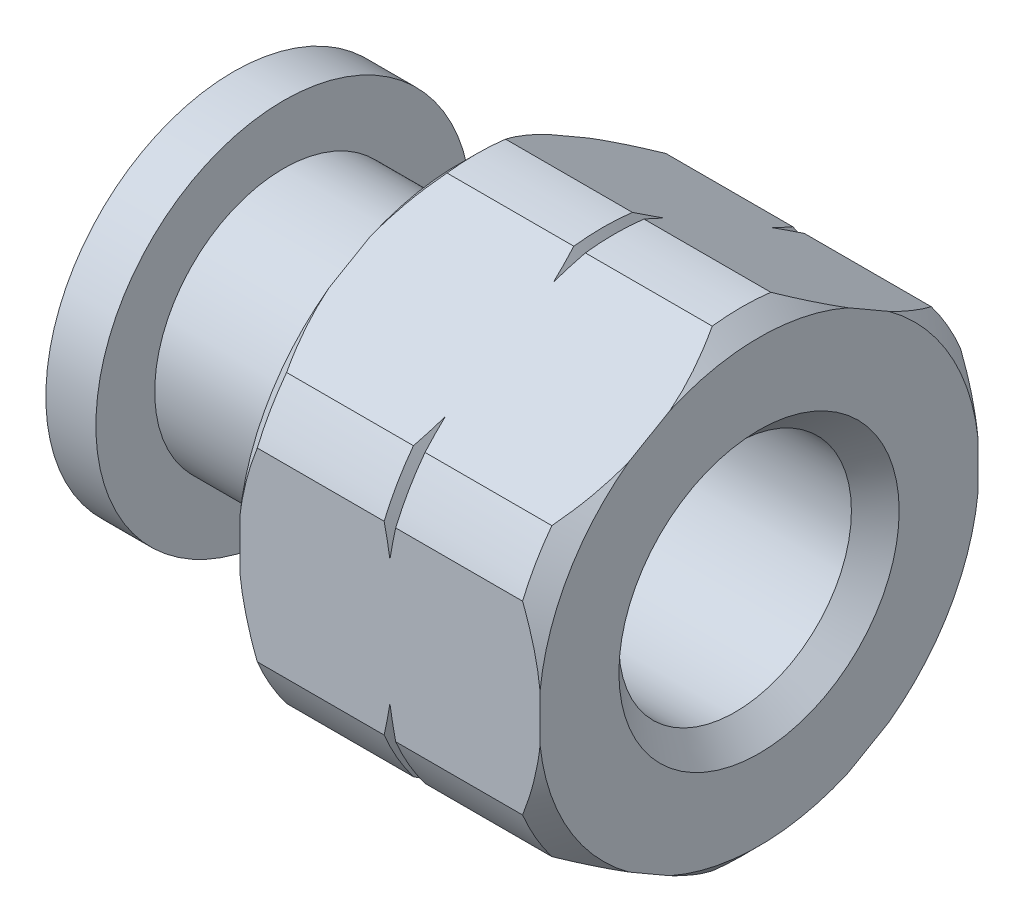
ISO-10303-21;
HEADER;
FILE_DESCRIPTION(('STEP AP214'),'2;1');
FILE_NAME('part.step','',(''),(''),'','','');
FILE_SCHEMA(('AUTOMOTIVE_DESIGN { 1 0 10303 214 1 1 1 1 }'));
ENDSEC;
DATA;
#1=APPLICATION_CONTEXT('core data for automotive mechanical design processes');
#2=APPLICATION_PROTOCOL_DEFINITION('international standard','automotive_design',2000,#1);
#3=PRODUCT_CONTEXT('',#1,'mechanical');
#4=PRODUCT('Part','Part','',(#3));
#5=PRODUCT_RELATED_PRODUCT_CATEGORY('part','',(#4));
#6=PRODUCT_DEFINITION_FORMATION('','',#4);
#7=PRODUCT_DEFINITION_CONTEXT('part definition',#1,'design');
#8=PRODUCT_DEFINITION('design','',#6,#7);
#9=PRODUCT_DEFINITION_SHAPE('','',#8);
#10=(LENGTH_UNIT() NAMED_UNIT(*) SI_UNIT(.MILLI.,.METRE.));
#11=(NAMED_UNIT(*) PLANE_ANGLE_UNIT() SI_UNIT($,.RADIAN.));
#12=(NAMED_UNIT(*) SI_UNIT($,.STERADIAN.) SOLID_ANGLE_UNIT());
#13=UNCERTAINTY_MEASURE_WITH_UNIT(LENGTH_MEASURE(1.E-05),#10,'distance_accuracy_value','');
#14=(GEOMETRIC_REPRESENTATION_CONTEXT(3) GLOBAL_UNCERTAINTY_ASSIGNED_CONTEXT((#13)) GLOBAL_UNIT_ASSIGNED_CONTEXT((#10,
#11,#12)) REPRESENTATION_CONTEXT('',''));
#15=CARTESIAN_POINT('',(0.,0.,0.));
#16=DIRECTION('',(0.,0.,1.));
#17=DIRECTION('',(1.,0.,0.));
#18=AXIS2_PLACEMENT_3D('',#15,#16,#17);
#19=CARTESIAN_POINT('',(-24.13,10.16,0.));
#20=DIRECTION('',(1.,0.,0.));
#21=DIRECTION('',(0.,1.,0.));
#22=AXIS2_PLACEMENT_3D('',#19,#20,#21);
#23=PLANE('',#22);
#24=CARTESIAN_POINT('',(-24.13,0.,0.));
#25=DIRECTION('',(1.,0.,0.));
#26=DIRECTION('',(0.,1.,0.));
#27=AXIS2_PLACEMENT_3D('',#24,#25,#26);
#28=CIRCLE('',#27,6.5405);
#29=CARTESIAN_POINT('',(-24.13,6.5405,0.));
#30=VERTEX_POINT('',#29);
#31=EDGE_CURVE('E1659',#30,#30,#28,.T.);
#32=ORIENTED_EDGE('',*,*,#31,.F.);
#33=EDGE_LOOP('',(#32));
#34=FACE_BOUND('',#33,.T.);
#35=CARTESIAN_POINT('',(-24.13,0.,0.));
#36=DIRECTION('',(1.,0.,0.));
#37=DIRECTION('',(0.,1.,0.));
#38=AXIS2_PLACEMENT_3D('',#35,#36,#37);
#39=CIRCLE('',#38,9.525);
#40=CARTESIAN_POINT('',(-24.13,9.525,0.));
#41=VERTEX_POINT('',#40);
#42=EDGE_CURVE('E399',#41,#41,#39,.T.);
#43=ORIENTED_EDGE('',*,*,#42,.T.);
#44=EDGE_LOOP('',(#43));
#45=FACE_BOUND('',#44,.T.);
#46=ADVANCED_FACE('F16',(#34,#45),#23,.T.);
#47=CARTESIAN_POINT('',(0.,0.,0.));
#48=DIRECTION('',(1.,0.,0.));
#49=DIRECTION('',(0.,1.,0.));
#50=AXIS2_PLACEMENT_3D('',#47,#48,#49);
#51=CYLINDRICAL_SURFACE('',#50,12.065);
#52=CARTESIAN_POINT('',(-7.91329393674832,0.,0.));
#53=DIRECTION('',(1.,0.,0.));
#54=DIRECTION('',(0.,1.,0.));
#55=AXIS2_PLACEMENT_3D('',#52,#53,#54);
#56=CIRCLE('',#55,12.065);
#57=CARTESIAN_POINT('',(-7.91329393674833,11.9729927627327,-1.48716821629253));
#58=VERTEX_POINT('',#57);
#59=CARTESIAN_POINT('',(-7.91329393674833,11.9729927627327,1.48716821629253));
#60=VERTEX_POINT('',#59);
#61=EDGE_CURVE('E800',#58,#60,#56,.T.);
#62=ORIENTED_EDGE('',*,*,#61,.F.);
#63=DIRECTION('',(1.,0.,0.));
#64=VECTOR('',#63,1.);
#65=CARTESIAN_POINT('',(0.,11.9729927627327,-1.48716821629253));
#66=LINE('',#65,#64);
#67=CARTESIAN_POINT('',(-14.351,11.9729927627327,-1.48716821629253));
#68=VERTEX_POINT('',#67);
#69=EDGE_CURVE('E786',#58,#68,#66,.F.);
#70=ORIENTED_EDGE('',*,*,#69,.T.);
#71=CARTESIAN_POINT('',(-14.351,0.,0.));
#72=DIRECTION('',(1.,0.,0.));
#73=DIRECTION('',(0.,1.,0.));
#74=AXIS2_PLACEMENT_3D('',#71,#72,#73);
#75=CIRCLE('',#74,12.065);
#76=CARTESIAN_POINT('',(-14.351,11.9729927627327,1.48716821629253));
#77=VERTEX_POINT('',#76);
#78=EDGE_CURVE('E1617',#68,#77,#75,.T.);
#79=ORIENTED_EDGE('',*,*,#78,.T.);
#80=DIRECTION('',(1.,0.,0.));
#81=VECTOR('',#80,1.);
#82=CARTESIAN_POINT('',(0.,11.9729927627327,1.48716821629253));
#83=LINE('',#82,#81);
#84=EDGE_CURVE('E499',#77,#60,#83,.T.);
#85=ORIENTED_EDGE('',*,*,#84,.T.);
#86=EDGE_LOOP('',(#62,#70,#79,#85));
#87=FACE_BOUND('',#86,.T.);
#88=ADVANCED_FACE('F596',(#87),#51,.T.);
#89=CARTESIAN_POINT('',(-14.351,4.69857092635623,-11.1125));
#90=VERTEX_POINT('',#89);
#91=CARTESIAN_POINT('',(-14.351,7.27442183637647,-9.62533178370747));
#92=VERTEX_POINT('',#91);
#93=EDGE_CURVE('E1518',#90,#92,#75,.T.);
#94=ORIENTED_EDGE('',*,*,#93,.T.);
#95=DIRECTION('',(1.,0.,0.));
#96=VECTOR('',#95,1.);
#97=CARTESIAN_POINT('',(0.,7.27442183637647,-9.62533178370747));
#98=LINE('',#97,#96);
#99=CARTESIAN_POINT('',(-7.91329393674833,7.27442183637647,-9.62533178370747));
#100=VERTEX_POINT('',#99);
#101=EDGE_CURVE('E1056',#92,#100,#98,.T.);
#102=ORIENTED_EDGE('',*,*,#101,.T.);
#103=CARTESIAN_POINT('',(-7.91329393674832,4.69857092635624,-11.1125));
#104=VERTEX_POINT('',#103);
#105=EDGE_CURVE('E807',#104,#100,#56,.T.);
#106=ORIENTED_EDGE('',*,*,#105,.F.);
#107=DIRECTION('',(1.,0.,0.));
#108=VECTOR('',#107,1.);
#109=CARTESIAN_POINT('',(0.,4.69857092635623,-11.1125));
#110=LINE('',#109,#108);
#111=EDGE_CURVE('E587',#104,#90,#110,.F.);
#112=ORIENTED_EDGE('',*,*,#111,.T.);
#113=EDGE_LOOP('',(#94,#102,#106,#112));
#114=FACE_BOUND('',#113,.T.);
#115=ADVANCED_FACE('F758',(#114),#51,.T.);
#116=CARTESIAN_POINT('',(-14.351,-7.27442183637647,-9.62533178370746));
#117=VERTEX_POINT('',#116);
#118=CARTESIAN_POINT('',(-14.351,-4.69857092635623,-11.1125));
#119=VERTEX_POINT('',#118);
#120=EDGE_CURVE('E862',#117,#119,#75,.T.);
#121=ORIENTED_EDGE('',*,*,#120,.T.);
#122=DIRECTION('',(1.,0.,0.));
#123=VECTOR('',#122,1.);
#124=CARTESIAN_POINT('',(0.,-4.69857092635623,-11.1125));
#125=LINE('',#124,#123);
#126=CARTESIAN_POINT('',(-7.91329393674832,-4.69857092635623,-11.1125));
#127=VERTEX_POINT('',#126);
#128=EDGE_CURVE('E552',#119,#127,#125,.T.);
#129=ORIENTED_EDGE('',*,*,#128,.T.);
#130=CARTESIAN_POINT('',(-7.91329393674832,-7.27442183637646,-9.62533178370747));
#131=VERTEX_POINT('',#130);
#132=EDGE_CURVE('E817',#131,#127,#56,.T.);
#133=ORIENTED_EDGE('',*,*,#132,.F.);
#134=DIRECTION('',(1.,0.,0.));
#135=VECTOR('',#134,1.);
#136=CARTESIAN_POINT('',(0.,-7.27442183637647,-9.62533178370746));
#137=LINE('',#136,#135);
#138=EDGE_CURVE('E635',#131,#117,#137,.F.);
#139=ORIENTED_EDGE('',*,*,#138,.T.);
#140=EDGE_LOOP('',(#121,#129,#133,#139));
#141=FACE_BOUND('',#140,.T.);
#142=ADVANCED_FACE('F861',(#141),#51,.T.);
#143=CARTESIAN_POINT('',(-14.351,-11.9729927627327,1.48716821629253));
#144=VERTEX_POINT('',#143);
#145=CARTESIAN_POINT('',(-14.351,-11.9729927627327,-1.48716821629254));
#146=VERTEX_POINT('',#145);
#147=EDGE_CURVE('E1517',#144,#146,#75,.T.);
#148=ORIENTED_EDGE('',*,*,#147,.T.);
#149=DIRECTION('',(1.,0.,0.));
#150=VECTOR('',#149,1.);
#151=CARTESIAN_POINT('',(0.,-11.9729927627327,-1.48716821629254));
#152=LINE('',#151,#150);
#153=CARTESIAN_POINT('',(-7.91329393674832,-11.9729927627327,-1.48716821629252));
#154=VERTEX_POINT('',#153);
#155=EDGE_CURVE('E633',#146,#154,#152,.T.);
#156=ORIENTED_EDGE('',*,*,#155,.T.);
#157=CARTESIAN_POINT('',(-7.91329393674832,-11.9729927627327,1.48716821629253));
#158=VERTEX_POINT('',#157);
#159=EDGE_CURVE('E839',#158,#154,#56,.T.);
#160=ORIENTED_EDGE('',*,*,#159,.F.);
#161=DIRECTION('',(1.,0.,0.));
#162=VECTOR('',#161,1.);
#163=CARTESIAN_POINT('',(0.,-11.9729927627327,1.48716821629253));
#164=LINE('',#163,#162);
#165=EDGE_CURVE('E684',#158,#144,#164,.F.);
#166=ORIENTED_EDGE('',*,*,#165,.T.);
#167=EDGE_LOOP('',(#148,#156,#160,#166));
#168=FACE_BOUND('',#167,.T.);
#169=ADVANCED_FACE('F1132',(#168),#51,.T.);
#170=CARTESIAN_POINT('',(-14.351,-4.69857092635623,11.1125));
#171=VERTEX_POINT('',#170);
#172=CARTESIAN_POINT('',(-14.351,-7.27442183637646,9.62533178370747));
#173=VERTEX_POINT('',#172);
#174=EDGE_CURVE('E1616',#171,#173,#75,.T.);
#175=ORIENTED_EDGE('',*,*,#174,.T.);
#176=DIRECTION('',(1.,0.,0.));
#177=VECTOR('',#176,1.);
#178=CARTESIAN_POINT('',(0.,-7.27442183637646,9.62533178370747));
#179=LINE('',#178,#177);
#180=CARTESIAN_POINT('',(-7.91329393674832,-7.27442183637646,9.62533178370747));
#181=VERTEX_POINT('',#180);
#182=EDGE_CURVE('E711',#173,#181,#179,.T.);
#183=ORIENTED_EDGE('',*,*,#182,.T.);
#184=CARTESIAN_POINT('',(-7.91329393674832,-4.69857092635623,11.1125));
#185=VERTEX_POINT('',#184);
#186=EDGE_CURVE('E825',#185,#181,#56,.T.);
#187=ORIENTED_EDGE('',*,*,#186,.F.);
#188=DIRECTION('',(1.,0.,0.));
#189=VECTOR('',#188,1.);
#190=CARTESIAN_POINT('',(0.,-4.69857092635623,11.1125));
#191=LINE('',#190,#189);
#192=EDGE_CURVE('E1025',#185,#171,#191,.F.);
#193=ORIENTED_EDGE('',*,*,#192,.T.);
#194=EDGE_LOOP('',(#175,#183,#187,#193));
#195=FACE_BOUND('',#194,.T.);
#196=ADVANCED_FACE('F1040',(#195),#51,.T.);
#197=CARTESIAN_POINT('',(-14.351,7.27442183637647,9.62533178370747));
#198=VERTEX_POINT('',#197);
#199=CARTESIAN_POINT('',(-14.351,4.69857092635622,11.1125));
#200=VERTEX_POINT('',#199);
#201=EDGE_CURVE('E1611',#198,#200,#75,.T.);
#202=ORIENTED_EDGE('',*,*,#201,.T.);
#203=DIRECTION('',(1.,0.,0.));
#204=VECTOR('',#203,1.);
#205=CARTESIAN_POINT('',(0.,4.69857092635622,11.1125));
#206=LINE('',#205,#204);
#207=CARTESIAN_POINT('',(-7.91329393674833,4.69857092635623,11.1125));
#208=VERTEX_POINT('',#207);
#209=EDGE_CURVE('E1802',#200,#208,#206,.T.);
#210=ORIENTED_EDGE('',*,*,#209,.T.);
#211=CARTESIAN_POINT('',(-7.91329393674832,7.27442183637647,9.62533178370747));
#212=VERTEX_POINT('',#211);
#213=EDGE_CURVE('E810',#212,#208,#56,.T.);
#214=ORIENTED_EDGE('',*,*,#213,.F.);
#215=DIRECTION('',(1.,0.,0.));
#216=VECTOR('',#215,1.);
#217=CARTESIAN_POINT('',(0.,7.27442183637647,9.62533178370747));
#218=LINE('',#217,#216);
#219=EDGE_CURVE('E872',#212,#198,#218,.F.);
#220=ORIENTED_EDGE('',*,*,#219,.T.);
#221=EDGE_LOOP('',(#202,#210,#214,#220));
#222=FACE_BOUND('',#221,.T.);
#223=ADVANCED_FACE('F1034',(#222),#51,.T.);
#224=CARTESIAN_POINT('',(-15.24,8.1915,0.));
#225=DIRECTION('',(-1.,0.,0.));
#226=DIRECTION('',(0.,-1.,0.));
#227=AXIS2_PLACEMENT_3D('',#224,#225,#226);
#228=PLANE('',#227);
#229=CARTESIAN_POINT('',(-15.24,0.,0.));
#230=DIRECTION('',(1.,0.,0.));
#231=DIRECTION('',(0.,1.,0.));
#232=AXIS2_PLACEMENT_3D('',#229,#230,#231);
#233=CIRCLE('',#232,8.1915);
#234=CARTESIAN_POINT('',(-15.24,8.1915,0.));
#235=VERTEX_POINT('',#234);
#236=EDGE_CURVE('E1769',#235,#235,#233,.T.);
#237=ORIENTED_EDGE('',*,*,#236,.T.);
#238=EDGE_LOOP('',(#237));
#239=FACE_BOUND('',#238,.T.);
#240=CARTESIAN_POINT('',(-15.24,0.,0.));
#241=DIRECTION('',(1.,0.,0.));
#242=DIRECTION('',(0.,1.,0.));
#243=AXIS2_PLACEMENT_3D('',#240,#241,#242);
#244=CIRCLE('',#243,11.176);
#245=CARTESIAN_POINT('',(-15.24,10.218543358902,-4.52596372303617));
#246=VERTEX_POINT('',#245);
#247=CARTESIAN_POINT('',(-15.24,10.218543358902,4.52596372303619));
#248=VERTEX_POINT('',#247);
#249=EDGE_CURVE('E1615',#246,#248,#244,.T.);
#250=ORIENTED_EDGE('',*,*,#249,.F.);
#251=DIRECTION('',(0.,0.5,0.866025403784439));
#252=VECTOR('',#251,1.);
#253=CARTESIAN_POINT('',(-15.24,6.41580486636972,-11.1125));
#254=LINE('',#253,#252);
#255=CARTESIAN_POINT('',(-15.24,9.02887124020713,-6.58653627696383));
#256=VERTEX_POINT('',#255);
#257=EDGE_CURVE('E437',#256,#246,#254,.T.);
#258=ORIENTED_EDGE('',*,*,#257,.F.);
#259=CARTESIAN_POINT('',(-15.24,1.18967211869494,-11.1125));
#260=VERTEX_POINT('',#259);
#261=EDGE_CURVE('E1656',#260,#256,#244,.T.);
#262=ORIENTED_EDGE('',*,*,#261,.F.);
#263=DIRECTION('',(0.,1.,0.));
#264=VECTOR('',#263,1.);
#265=CARTESIAN_POINT('',(-15.24,-6.41580486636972,-11.1125));
#266=LINE('',#265,#264);
#267=CARTESIAN_POINT('',(-15.24,-1.18967211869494,-11.1125));
#268=VERTEX_POINT('',#267);
#269=EDGE_CURVE('E433',#268,#260,#266,.T.);
#270=ORIENTED_EDGE('',*,*,#269,.F.);
#271=CARTESIAN_POINT('',(-15.24,-9.02887124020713,-6.58653627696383));
#272=VERTEX_POINT('',#271);
#273=EDGE_CURVE('E1919',#272,#268,#244,.T.);
#274=ORIENTED_EDGE('',*,*,#273,.F.);
#275=DIRECTION('',(0.,0.5,-0.866025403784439));
#276=VECTOR('',#275,1.);
#277=CARTESIAN_POINT('',(-15.24,-12.8316097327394,0.));
#278=LINE('',#277,#276);
#279=CARTESIAN_POINT('',(-15.24,-10.218543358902,-4.52596372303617));
#280=VERTEX_POINT('',#279);
#281=EDGE_CURVE('E443',#280,#272,#278,.T.);
#282=ORIENTED_EDGE('',*,*,#281,.F.);
#283=CARTESIAN_POINT('',(-15.24,-10.218543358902,4.52596372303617));
#284=VERTEX_POINT('',#283);
#285=EDGE_CURVE('E1638',#284,#280,#244,.T.);
#286=ORIENTED_EDGE('',*,*,#285,.F.);
#287=DIRECTION('',(0.,-0.5,-0.866025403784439));
#288=VECTOR('',#287,1.);
#289=CARTESIAN_POINT('',(-15.24,-6.41580486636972,11.1125));
#290=LINE('',#289,#288);
#291=CARTESIAN_POINT('',(-15.24,-9.02887124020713,6.58653627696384));
#292=VERTEX_POINT('',#291);
#293=EDGE_CURVE('E447',#292,#284,#290,.T.);
#294=ORIENTED_EDGE('',*,*,#293,.F.);
#295=CARTESIAN_POINT('',(-15.24,-1.18967211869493,11.1125));
#296=VERTEX_POINT('',#295);
#297=EDGE_CURVE('E1633',#296,#292,#244,.T.);
#298=ORIENTED_EDGE('',*,*,#297,.F.);
#299=DIRECTION('',(0.,-1.,0.));
#300=VECTOR('',#299,1.);
#301=CARTESIAN_POINT('',(-15.24,6.41580486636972,11.1125));
#302=LINE('',#301,#300);
#303=CARTESIAN_POINT('',(-15.24,1.18967211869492,11.1125));
#304=VERTEX_POINT('',#303);
#305=EDGE_CURVE('E450',#304,#296,#302,.T.);
#306=ORIENTED_EDGE('',*,*,#305,.F.);
#307=CARTESIAN_POINT('',(-15.24,9.02887124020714,6.58653627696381));
#308=VERTEX_POINT('',#307);
#309=EDGE_CURVE('E1637',#308,#304,#244,.T.);
#310=ORIENTED_EDGE('',*,*,#309,.F.);
#311=DIRECTION('',(0.,-0.5,0.866025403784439));
#312=VECTOR('',#311,1.);
#313=CARTESIAN_POINT('',(-15.24,12.8316097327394,0.));
#314=LINE('',#313,#312);
#315=EDGE_CURVE('E440',#248,#308,#314,.T.);
#316=ORIENTED_EDGE('',*,*,#315,.F.);
#317=EDGE_LOOP('',(#250,#258,#262,#270,#274,#282,#286,#294,#298,#306,#310,#316));
#318=FACE_BOUND('',#317,.T.);
#319=ADVANCED_FACE('F594',(#239,#318),#228,.T.);
#320=CARTESIAN_POINT('',(-14.351,0.,0.));
#321=DIRECTION('',(1.,0.,0.));
#322=DIRECTION('',(0.,1.,0.));
#323=AXIS2_PLACEMENT_3D('',#320,#321,#322);
#324=CONICAL_SURFACE('',#323,12.065,0.785398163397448);
#325=ORIENTED_EDGE('',*,*,#78,.F.);
#326=CARTESIAN_POINT('',(-7.68812802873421,17.1610399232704,7.49879305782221));
#327=CARTESIAN_POINT('',(-7.93651090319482,17.0067314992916,7.23152302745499));
#328=CARTESIAN_POINT('',(-8.1833085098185,16.851778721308,6.96313694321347));
#329=CARTESIAN_POINT('',(-8.67310537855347,16.5403537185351,6.42373301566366));
#330=CARTESIAN_POINT('',(-8.91610423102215,16.383881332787,6.15271489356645));
#331=CARTESIAN_POINT('',(-9.39832556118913,16.0687597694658,5.60690833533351));
#332=CARTESIAN_POINT('',(-9.63753493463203,15.9101055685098,5.33211119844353));
#333=CARTESIAN_POINT('',(-10.1105755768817,15.5908097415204,4.77907460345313));
#334=CARTESIAN_POINT('',(-10.3444070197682,15.430168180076,4.5008352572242));
#335=CARTESIAN_POINT('',(-10.8129550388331,15.1014401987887,3.93146169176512));
#336=CARTESIAN_POINT('',(-11.047463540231,14.9332794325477,3.64019870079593));
#337=CARTESIAN_POINT('',(-11.5081256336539,14.5940965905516,3.05271678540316));
#338=CARTESIAN_POINT('',(-11.7342787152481,14.4230743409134,2.75649755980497));
#339=CARTESIAN_POINT('',(-12.1760220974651,14.0779079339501,2.15865180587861));
#340=CARTESIAN_POINT('',(-12.3916238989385,13.9037674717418,1.85703167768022));
#341=CARTESIAN_POINT('',(-12.8099866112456,13.5516888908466,1.24721368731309));
#342=CARTESIAN_POINT('',(-13.0127496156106,13.3737513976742,0.939016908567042));
#343=CARTESIAN_POINT('',(-13.3969986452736,13.0183260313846,0.323402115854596));
#344=CARTESIAN_POINT('',(-13.5789088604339,12.8409535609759,0.0161839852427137));
#345=CARTESIAN_POINT('',(-13.9236930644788,12.4815697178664,-0.606287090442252));
#346=CARTESIAN_POINT('',(-14.0865644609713,12.2995577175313,-0.921541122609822));
#347=CARTESIAN_POINT('',(-14.3875269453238,11.9317582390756,-1.55858850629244));
#348=CARTESIAN_POINT('',(-14.5257666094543,11.7460014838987,-1.88032864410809));
#349=CARTESIAN_POINT('',(-14.7731789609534,11.3696822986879,-2.53213259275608));
#350=CARTESIAN_POINT('',(-14.8823596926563,11.1791212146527,-2.86219407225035));
#351=CARTESIAN_POINT('',(-15.0501146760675,10.8269981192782,-3.47208916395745));
#352=CARTESIAN_POINT('',(-15.1141655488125,10.6660923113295,-3.75078619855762));
#353=CARTESIAN_POINT('',(-15.2155436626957,10.3421790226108,-4.31182047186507));
#354=CARTESIAN_POINT('',(-15.2528748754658,10.1791718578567,-4.59415716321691));
#355=CARTESIAN_POINT('',(-15.2988481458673,9.85248088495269,-5.16000252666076));
#356=CARTESIAN_POINT('',(-15.3075505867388,9.6887992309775,-5.4435074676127));
#357=CARTESIAN_POINT('',(-15.2959599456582,9.36168961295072,-6.01007794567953));
#358=CARTESIAN_POINT('',(-15.275665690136,9.19826165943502,-6.29314346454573));
#359=CARTESIAN_POINT('',(-15.2074306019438,8.87411285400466,-6.85458566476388));
#360=CARTESIAN_POINT('',(-15.1596974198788,8.71338089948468,-7.13298157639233));
#361=CARTESIAN_POINT('',(-15.039048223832,8.39431539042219,-7.68561924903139));
#362=CARTESIAN_POINT('',(-14.9661299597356,8.2359820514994,-7.95986063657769));
#363=CARTESIAN_POINT('',(-14.7972916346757,7.92077343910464,-8.50581796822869));
#364=CARTESIAN_POINT('',(-14.7011522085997,7.76392786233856,-8.77748247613));
#365=CARTESIAN_POINT('',(-14.4895633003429,7.45360747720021,-9.31497314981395));
#366=CARTESIAN_POINT('',(-14.3741183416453,7.30013188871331,-9.5808006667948));
#367=CARTESIAN_POINT('',(-14.0553091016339,6.90840824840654,-10.259285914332));
#368=CARTESIAN_POINT('',(-13.8397948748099,6.67263671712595,-10.6676541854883));
#369=CARTESIAN_POINT('',(-13.3784347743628,6.20856615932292,-11.4714479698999));
#370=CARTESIAN_POINT('',(-13.1325664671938,5.98027281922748,-11.8668636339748));
#371=CARTESIAN_POINT('',(-12.6171335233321,5.52924234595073,-12.648071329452));
#372=CARTESIAN_POINT('',(-12.347472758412,5.30653290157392,-13.0338154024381));
#373=CARTESIAN_POINT('',(-11.7910256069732,4.86665430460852,-13.7957074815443));
#374=CARTESIAN_POINT('',(-11.504243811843,4.64948368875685,-14.1718580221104));
#375=CARTESIAN_POINT('',(-10.93360017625,4.2314656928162,-14.8958864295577));
#376=CARTESIAN_POINT('',(-10.6504424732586,4.03037674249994,-15.2441827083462));
#377=CARTESIAN_POINT('',(-10.0747884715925,3.63155130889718,-15.9349686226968));
#378=CARTESIAN_POINT('',(-9.78229129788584,3.43381514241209,-16.2774577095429));
#379=CARTESIAN_POINT('',(-9.19279919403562,3.04312859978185,-16.9541466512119));
#380=CARTESIAN_POINT('',(-8.89587855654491,2.85015013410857,-17.2883951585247));
#381=CARTESIAN_POINT('',(-8.44607082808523,2.56245815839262,-17.7866922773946));
#382=CARTESIAN_POINT('',(-8.29541631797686,2.46686867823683,-17.9522581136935));
#383=CARTESIAN_POINT('',(-7.99275439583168,2.27622902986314,-18.2824556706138));
#384=CARTESIAN_POINT('',(-7.84074700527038,2.18117885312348,-18.4470874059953));
#385=CARTESIAN_POINT('',(-7.68812802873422,2.08637467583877,-18.6112930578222));
#386=B_SPLINE_CURVE_WITH_KNOTS('',3,(#326,#327,#328,#329,#330,#331,#332,#333,#334,#335,#336,
#337,#338,#339,#340,#341,#342,#343,#344,#345,#346,#347,#348,#349,#350,#351,#352,#353,#354,#355,
#356,#357,#358,#359,#360,#361,#362,#363,#364,#365,#366,#367,#368,#369,#370,#371,#372,#373,#374,
#375,#376,#377,#378,#379,#380,#381,#382,#383,#384,#385),.UNSPECIFIED.,.F.,.F.,(4,2,2,2,2,2,2,2,
2,2,2,2,2,2,2,2,2,2,2,2,2,2,2,2,2,2,2,2,2,4),(0.,1.18847320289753,2.37707369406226,
3.56914611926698,4.76117990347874,5.99110009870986,7.2210953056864,8.44971851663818,
9.67814086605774,10.8736887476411,12.0693992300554,13.2576332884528,14.445538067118,
15.4289126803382,16.4121410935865,17.3932943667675,18.3744873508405,19.3483508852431,
20.322301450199,21.3058396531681,22.2891477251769,23.8429364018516,25.3978803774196,
26.9594227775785,28.5205482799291,29.9959636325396,31.4715176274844,32.9323067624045,
33.662517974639,34.3927176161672),.UNSPECIFIED.);
#387=EDGE_CURVE('E791',#68,#246,#386,.T.);
#388=ORIENTED_EDGE('',*,*,#387,.T.);
#389=ORIENTED_EDGE('',*,*,#249,.T.);
#390=CARTESIAN_POINT('',(-7.68812802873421,2.08637467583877,18.6112930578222));
#391=CARTESIAN_POINT('',(-7.93651090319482,2.2406830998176,18.344023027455));
#392=CARTESIAN_POINT('',(-8.1833085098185,2.3956358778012,18.0756369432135));
#393=CARTESIAN_POINT('',(-8.67310537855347,2.70706088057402,17.5362330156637));
#394=CARTESIAN_POINT('',(-8.91610423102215,2.86353326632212,17.2652148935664));
#395=CARTESIAN_POINT('',(-9.39832556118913,3.17865482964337,16.7194083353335));
#396=CARTESIAN_POINT('',(-9.63753493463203,3.33730903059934,16.4446111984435));
#397=CARTESIAN_POINT('',(-10.1105755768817,3.65660485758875,15.8915746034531));
#398=CARTESIAN_POINT('',(-10.3444070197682,3.81724641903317,15.6133352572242));
#399=CARTESIAN_POINT('',(-10.8129550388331,4.14597440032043,15.0439616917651));
#400=CARTESIAN_POINT('',(-11.047463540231,4.31413516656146,14.7526987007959));
#401=CARTESIAN_POINT('',(-11.5081256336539,4.65331800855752,14.1652167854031));
#402=CARTESIAN_POINT('',(-11.7342787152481,4.82434025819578,13.868997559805));
#403=CARTESIAN_POINT('',(-12.1760220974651,5.16950666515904,13.2711518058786));
#404=CARTESIAN_POINT('',(-12.3916238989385,5.34364712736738,12.9695316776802));
#405=CARTESIAN_POINT('',(-12.8099866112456,5.69572570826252,12.3597136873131));
#406=CARTESIAN_POINT('',(-13.0127496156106,5.87366320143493,12.051516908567));
#407=CARTESIAN_POINT('',(-13.3969986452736,6.22908856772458,11.4359021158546));
#408=CARTESIAN_POINT('',(-13.5789088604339,6.40646103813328,11.1286839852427));
#409=CARTESIAN_POINT('',(-13.9236930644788,6.76584488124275,10.5062129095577));
#410=CARTESIAN_POINT('',(-14.0865644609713,6.94785688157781,10.1909588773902));
#411=CARTESIAN_POINT('',(-14.3875269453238,7.31565636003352,9.55391149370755));
#412=CARTESIAN_POINT('',(-14.5257666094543,7.50141311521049,9.2321713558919));
#413=CARTESIAN_POINT('',(-14.7731789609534,7.87773230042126,8.58036740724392));
#414=CARTESIAN_POINT('',(-14.8823596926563,8.06829338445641,8.25030592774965));
#415=CARTESIAN_POINT('',(-15.0501146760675,8.42041647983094,7.64041083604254));
#416=CARTESIAN_POINT('',(-15.1141655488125,8.5813222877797,7.36171380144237));
#417=CARTESIAN_POINT('',(-15.2155436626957,8.90523557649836,6.80067952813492));
#418=CARTESIAN_POINT('',(-15.2528748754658,9.06824274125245,6.51834283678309));
#419=CARTESIAN_POINT('',(-15.2988481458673,9.39493371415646,5.95249747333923));
#420=CARTESIAN_POINT('',(-15.3075505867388,9.55861536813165,5.6689925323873));
#421=CARTESIAN_POINT('',(-15.2959599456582,9.88572498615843,5.10242205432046));
#422=CARTESIAN_POINT('',(-15.275665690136,10.0491529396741,4.81935653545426));
#423=CARTESIAN_POINT('',(-15.2074306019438,10.3733017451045,4.25791433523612));
#424=CARTESIAN_POINT('',(-15.1596974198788,10.5340336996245,3.97951842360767));
#425=CARTESIAN_POINT('',(-15.039048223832,10.853099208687,3.4268807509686));
#426=CARTESIAN_POINT('',(-14.9661299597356,11.0114325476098,3.15263936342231));
#427=CARTESIAN_POINT('',(-14.7972916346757,11.3266411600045,2.6066820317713));
#428=CARTESIAN_POINT('',(-14.7011522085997,11.4834867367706,2.33501752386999));
#429=CARTESIAN_POINT('',(-14.4895633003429,11.7938071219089,1.79752685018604));
#430=CARTESIAN_POINT('',(-14.3741183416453,11.9472827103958,1.53169933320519));
#431=CARTESIAN_POINT('',(-14.0553091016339,12.3390063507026,0.853214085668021));
#432=CARTESIAN_POINT('',(-13.8397948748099,12.5747778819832,0.444845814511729));
#433=CARTESIAN_POINT('',(-13.3784347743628,13.0388484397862,-0.358947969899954));
#434=CARTESIAN_POINT('',(-13.1325664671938,13.2671417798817,-0.754363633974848));
#435=CARTESIAN_POINT('',(-12.6171335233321,13.7181722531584,-1.53557132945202));
#436=CARTESIAN_POINT('',(-12.347472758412,13.9408816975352,-1.92131540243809));
#437=CARTESIAN_POINT('',(-11.7910256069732,14.3807602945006,-2.68320748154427));
#438=CARTESIAN_POINT('',(-11.504243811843,14.5979309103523,-3.05935802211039));
#439=CARTESIAN_POINT('',(-10.93360017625,15.015948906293,-3.78338642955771));
#440=CARTESIAN_POINT('',(-10.6504424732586,15.2170378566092,-4.13168270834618));
#441=CARTESIAN_POINT('',(-10.0747884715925,15.615863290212,-4.82246862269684));
#442=CARTESIAN_POINT('',(-9.78229129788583,15.8135994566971,-5.16495770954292));
#443=CARTESIAN_POINT('',(-9.19279919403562,16.2042859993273,-5.84164665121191));
#444=CARTESIAN_POINT('',(-8.89587855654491,16.3972644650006,-6.17589515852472));
#445=CARTESIAN_POINT('',(-8.44607082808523,16.6849564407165,-6.67419227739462));
#446=CARTESIAN_POINT('',(-8.29541631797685,16.7805459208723,-6.83975811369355));
#447=CARTESIAN_POINT('',(-7.99275439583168,16.971185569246,-7.16995567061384));
#448=CARTESIAN_POINT('',(-7.84074700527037,17.0662357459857,-7.33458740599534));
#449=CARTESIAN_POINT('',(-7.68812802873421,17.1610399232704,-7.49879305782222));
#450=B_SPLINE_CURVE_WITH_KNOTS('',3,(#390,#391,#392,#393,#394,#395,#396,#397,#398,#399,#400,
#401,#402,#403,#404,#405,#406,#407,#408,#409,#410,#411,#412,#413,#414,#415,#416,#417,#418,#419,
#420,#421,#422,#423,#424,#425,#426,#427,#428,#429,#430,#431,#432,#433,#434,#435,#436,#437,#438,
#439,#440,#441,#442,#443,#444,#445,#446,#447,#448,#449),.UNSPECIFIED.,.F.,.F.,(4,2,2,2,2,2,2,2,
2,2,2,2,2,2,2,2,2,2,2,2,2,2,2,2,2,2,2,2,2,4),(0.,1.18847320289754,2.37707369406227,
3.56914611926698,4.76117990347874,5.99110009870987,7.22109530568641,8.44971851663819,
9.67814086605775,10.8736887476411,12.0693992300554,13.2576332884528,14.445538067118,
15.4289126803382,16.4121410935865,17.3932943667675,18.3744873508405,19.3483508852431,
20.322301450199,21.3058396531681,22.2891477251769,23.8429364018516,25.3978803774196,
26.9594227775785,28.5205482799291,29.9959636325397,31.4715176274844,32.9323067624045,
33.662517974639,34.3927176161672),.UNSPECIFIED.);
#451=EDGE_CURVE('E600',#248,#77,#450,.T.);
#452=ORIENTED_EDGE('',*,*,#451,.T.);
#453=EDGE_LOOP('',(#325,#388,#389,#452));
#454=FACE_BOUND('',#453,.T.);
#455=ADVANCED_FACE('F589',(#454),#324,.T.);
#456=ORIENTED_EDGE('',*,*,#261,.T.);
#457=EDGE_CURVE('E1050',#256,#92,#386,.T.);
#458=ORIENTED_EDGE('',*,*,#457,.T.);
#459=ORIENTED_EDGE('',*,*,#93,.F.);
#460=CARTESIAN_POINT('',(-8.43708485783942,14.1334261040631,-11.1125));
#461=CARTESIAN_POINT('',(-8.68692855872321,13.815546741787,-11.1125));
#462=CARTESIAN_POINT('',(-8.93484475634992,13.4961325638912,-11.1125));
#463=CARTESIAN_POINT('',(-9.42599189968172,12.8536393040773,-11.1125));
#464=CARTESIAN_POINT('',(-9.6692220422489,12.530559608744,-11.1125));
#465=CARTESIAN_POINT('',(-10.1513217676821,11.8785701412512,-11.1125));
#466=CARTESIAN_POINT('',(-10.390162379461,11.5496388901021,-11.1125));
#467=CARTESIAN_POINT('',(-10.860990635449,10.8869221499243,-11.1125));
#468=CARTESIAN_POINT('',(-11.0929786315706,10.553136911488,-11.1125));
#469=CARTESIAN_POINT('',(-11.5600166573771,9.86307863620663,-11.1125));
#470=CARTESIAN_POINT('',(-11.7946399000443,9.50651562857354,-11.1125));
#471=CARTESIAN_POINT('',(-12.252489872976,8.7860546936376,-11.1125));
#472=CARTESIAN_POINT('',(-12.4757153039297,8.42215593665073,-11.1125));
#473=CARTESIAN_POINT('',(-12.9073635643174,7.68661951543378,-11.1125));
#474=CARTESIAN_POINT('',(-13.1158153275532,7.31499893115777,-11.1125));
#475=CARTESIAN_POINT('',(-13.514527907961,6.56218349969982,-11.1125));
#476=CARTESIAN_POINT('',(-13.7047943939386,6.18099168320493,-11.1125));
#477=CARTESIAN_POINT('',(-14.0435003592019,5.44840867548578,-11.1125));
#478=CARTESIAN_POINT('',(-14.1942337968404,5.09808602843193,-11.1125));
#479=CARTESIAN_POINT('',(-14.472860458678,4.38832766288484,-11.1125));
#480=CARTESIAN_POINT('',(-14.6007514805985,4.02889106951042,-11.1125));
#481=CARTESIAN_POINT('',(-14.8273426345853,3.30542585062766,-11.1125));
#482=CARTESIAN_POINT('',(-14.9263665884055,2.94150005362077,-11.1125));
#483=CARTESIAN_POINT('',(-15.0922457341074,2.20631816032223,-11.1125));
#484=CARTESIAN_POINT('',(-15.1591051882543,1.83506304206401,-11.1125));
#485=CARTESIAN_POINT('',(-15.2574257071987,1.0808707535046,-11.1125));
#486=CARTESIAN_POINT('',(-15.288215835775,0.697844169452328,-11.1125));
#487=CARTESIAN_POINT('',(-15.3098988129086,-0.0693278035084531,-11.1125));
#488=CARTESIAN_POINT('',(-15.300794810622,-0.453473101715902,-11.1125));
#489=CARTESIAN_POINT('',(-15.2432908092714,-1.21999768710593,-11.1125));
#490=CARTESIAN_POINT('',(-15.194764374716,-1.60236730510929,-11.1125));
#491=CARTESIAN_POINT('',(-15.0616550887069,-2.36073901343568,-11.1125));
#492=CARTESIAN_POINT('',(-14.977062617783,-2.73673937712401,-11.1125));
#493=CARTESIAN_POINT('',(-14.744643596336,-3.59952838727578,-11.1125));
#494=CARTESIAN_POINT('',(-14.5852378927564,-4.08317298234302,-11.1125));
#495=CARTESIAN_POINT('',(-14.2242672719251,-5.0343723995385,-11.1125));
#496=CARTESIAN_POINT('',(-14.0226764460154,-5.50191712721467,-11.1125));
#497=CARTESIAN_POINT('',(-13.5862496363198,-6.42506241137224,-11.1125));
#498=CARTESIAN_POINT('',(-13.3511887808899,-6.88055521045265,-11.1125));
#499=CARTESIAN_POINT('',(-12.8570514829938,-7.77802444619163,-11.1125));
#500=CARTESIAN_POINT('',(-12.5979808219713,-8.2200041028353,-11.1125));
#501=CARTESIAN_POINT('',(-12.0333171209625,-9.138864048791,-11.1125));
#502=CARTESIAN_POINT('',(-11.7257014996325,-9.61449269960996,-11.1125));
#503=CARTESIAN_POINT('',(-11.0938799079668,-10.5546581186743,-11.1125));
#504=CARTESIAN_POINT('',(-10.7696707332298,-11.0191927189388,-11.1125));
#505=CARTESIAN_POINT('',(-10.2774403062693,-11.7042649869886,-11.1125));
#506=CARTESIAN_POINT('',(-10.1142031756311,-11.928266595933,-11.1125));
#507=CARTESIAN_POINT('',(-9.78505536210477,-12.374301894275,-11.1125));
#508=CARTESIAN_POINT('',(-9.61914465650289,-12.5963355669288,-11.1125));
#509=CARTESIAN_POINT('',(-9.28507411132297,-13.038478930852,-11.1125));
#510=CARTESIAN_POINT('',(-9.11691577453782,-13.2585897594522,-11.1125));
#511=CARTESIAN_POINT('',(-8.77850711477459,-13.697185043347,-11.1125));
#512=CARTESIAN_POINT('',(-8.60825686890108,-13.9156695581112,-11.1125));
#513=CARTESIAN_POINT('',(-8.43708485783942,-14.1334261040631,-11.1125));
#514=B_SPLINE_CURVE_WITH_KNOTS('',3,(#460,#461,#462,#463,#464,#465,#466,#467,#468,#469,#470,
#471,#472,#473,#474,#475,#476,#477,#478,#479,#480,#481,#482,#483,#484,#485,#486,#487,#488,#489,
#490,#491,#492,#493,#494,#495,#496,#497,#498,#499,#500,#501,#502,#503,#504,#505,#506,#507,#508,
#509,#510,#511,#512,#513),.UNSPECIFIED.,.F.,.F.,(4,2,2,2,2,2,2,2,2,2,2,2,2,2,2,2,2,2,2,2,2,2,2,
2,2,2,4),(0.,1.21295531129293,2.42611669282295,3.64553700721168,4.86489458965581,
6.14521512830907,7.42568129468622,8.70356613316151,9.98105131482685,11.1245285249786,
12.2681159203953,13.3983322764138,14.5283988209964,15.6791681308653,16.8298466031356,
17.9842301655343,19.1389218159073,20.6639477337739,22.1899130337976,23.7266621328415,
25.2630421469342,26.961886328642,28.6610598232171,29.4925543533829,30.3240559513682,
31.1550269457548,31.9859674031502),.UNSPECIFIED.);
#515=EDGE_CURVE('E586',#90,#260,#514,.T.);
#516=ORIENTED_EDGE('',*,*,#515,.T.);
#517=EDGE_LOOP('',(#456,#458,#459,#516));
#518=FACE_BOUND('',#517,.T.);
#519=ADVANCED_FACE('F593',(#518),#324,.T.);
#520=ORIENTED_EDGE('',*,*,#273,.T.);
#521=EDGE_CURVE('E576',#268,#119,#514,.T.);
#522=ORIENTED_EDGE('',*,*,#521,.T.);
#523=ORIENTED_EDGE('',*,*,#120,.F.);
#524=CARTESIAN_POINT('',(-7.68812802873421,-2.08637467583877,-18.6112930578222));
#525=CARTESIAN_POINT('',(-7.93651090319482,-2.2406830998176,-18.344023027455));
#526=CARTESIAN_POINT('',(-8.1833085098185,-2.3956358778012,-18.0756369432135));
#527=CARTESIAN_POINT('',(-8.67310537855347,-2.70706088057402,-17.5362330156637));
#528=CARTESIAN_POINT('',(-8.91610423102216,-2.86353326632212,-17.2652148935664));
#529=CARTESIAN_POINT('',(-9.39832556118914,-3.17865482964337,-16.7194083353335));
#530=CARTESIAN_POINT('',(-9.63753493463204,-3.33730903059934,-16.4446111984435));
#531=CARTESIAN_POINT('',(-10.1105755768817,-3.65660485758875,-15.8915746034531));
#532=CARTESIAN_POINT('',(-10.3444070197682,-3.81724641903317,-15.6133352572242));
#533=CARTESIAN_POINT('',(-10.8129550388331,-4.14597440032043,-15.0439616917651));
#534=CARTESIAN_POINT('',(-11.047463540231,-4.31413516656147,-14.7526987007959));
#535=CARTESIAN_POINT('',(-11.5081256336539,-4.65331800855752,-14.1652167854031));
#536=CARTESIAN_POINT('',(-11.7342787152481,-4.82434025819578,-13.868997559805));
#537=CARTESIAN_POINT('',(-12.1760220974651,-5.16950666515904,-13.2711518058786));
#538=CARTESIAN_POINT('',(-12.3916238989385,-5.34364712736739,-12.9695316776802));
#539=CARTESIAN_POINT('',(-12.8099866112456,-5.69572570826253,-12.3597136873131));
#540=CARTESIAN_POINT('',(-13.0127496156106,-5.87366320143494,-12.051516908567));
#541=CARTESIAN_POINT('',(-13.3969986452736,-6.22908856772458,-11.4359021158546));
#542=CARTESIAN_POINT('',(-13.5789088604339,-6.40646103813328,-11.1286839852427));
#543=CARTESIAN_POINT('',(-13.9236930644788,-6.76584488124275,-10.5062129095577));
#544=CARTESIAN_POINT('',(-14.0865644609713,-6.94785688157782,-10.1909588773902));
#545=CARTESIAN_POINT('',(-14.3875269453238,-7.31565636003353,-9.55391149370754));
#546=CARTESIAN_POINT('',(-14.5257666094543,-7.5014131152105,-9.23217135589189));
#547=CARTESIAN_POINT('',(-14.7731789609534,-7.87773230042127,-8.58036740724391));
#548=CARTESIAN_POINT('',(-14.8823596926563,-8.06829338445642,-8.25030592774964));
#549=CARTESIAN_POINT('',(-15.0501146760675,-8.42041647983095,-7.64041083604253));
#550=CARTESIAN_POINT('',(-15.1141655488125,-8.58132228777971,-7.36171380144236));
#551=CARTESIAN_POINT('',(-15.2155436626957,-8.90523557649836,-6.80067952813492));
#552=CARTESIAN_POINT('',(-15.2528748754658,-9.06824274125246,-6.51834283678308));
#553=CARTESIAN_POINT('',(-15.2988481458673,-9.39493371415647,-5.95249747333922));
#554=CARTESIAN_POINT('',(-15.3075505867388,-9.55861536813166,-5.66899253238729));
#555=CARTESIAN_POINT('',(-15.2959599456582,-9.88572498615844,-5.10242205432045));
#556=CARTESIAN_POINT('',(-15.275665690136,-10.0491529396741,-4.81935653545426));
#557=CARTESIAN_POINT('',(-15.2074306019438,-10.3733017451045,-4.25791433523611));
#558=CARTESIAN_POINT('',(-15.1596974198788,-10.5340336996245,-3.97951842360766));
#559=CARTESIAN_POINT('',(-15.039048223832,-10.853099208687,-3.4268807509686));
#560=CARTESIAN_POINT('',(-14.9661299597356,-11.0114325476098,-3.1526393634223));
#561=CARTESIAN_POINT('',(-14.7972916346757,-11.3266411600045,-2.60668203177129));
#562=CARTESIAN_POINT('',(-14.7011522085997,-11.4834867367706,-2.33501752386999));
#563=CARTESIAN_POINT('',(-14.4895633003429,-11.7938071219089,-1.79752685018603));
#564=CARTESIAN_POINT('',(-14.3741183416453,-11.9472827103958,-1.53169933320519));
#565=CARTESIAN_POINT('',(-14.0553091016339,-12.3390063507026,-0.853214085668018));
#566=CARTESIAN_POINT('',(-13.8397948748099,-12.5747778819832,-0.444845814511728));
#567=CARTESIAN_POINT('',(-13.3784347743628,-13.0388484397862,0.358947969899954));
#568=CARTESIAN_POINT('',(-13.1325664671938,-13.2671417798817,0.754363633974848));
#569=CARTESIAN_POINT('',(-12.6171335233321,-13.7181722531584,1.53557132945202));
#570=CARTESIAN_POINT('',(-12.347472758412,-13.9408816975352,1.92131540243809));
#571=CARTESIAN_POINT('',(-11.7910256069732,-14.3807602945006,2.68320748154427));
#572=CARTESIAN_POINT('',(-11.504243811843,-14.5979309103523,3.05935802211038));
#573=CARTESIAN_POINT('',(-10.93360017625,-15.015948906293,3.78338642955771));
#574=CARTESIAN_POINT('',(-10.6504424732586,-15.2170378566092,4.13168270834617));
#575=CARTESIAN_POINT('',(-10.0747884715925,-15.615863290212,4.82246862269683));
#576=CARTESIAN_POINT('',(-9.78229129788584,-15.8135994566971,5.16495770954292));
#577=CARTESIAN_POINT('',(-9.19279919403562,-16.2042859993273,5.84164665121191));
#578=CARTESIAN_POINT('',(-8.89587855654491,-16.3972644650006,6.17589515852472));
#579=CARTESIAN_POINT('',(-8.44607082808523,-16.6849564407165,6.67419227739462));
#580=CARTESIAN_POINT('',(-8.29541631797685,-16.7805459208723,6.83975811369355));
#581=CARTESIAN_POINT('',(-7.99275439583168,-16.971185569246,7.16995567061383));
#582=CARTESIAN_POINT('',(-7.84074700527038,-17.0662357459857,7.33458740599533));
#583=CARTESIAN_POINT('',(-7.68812802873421,-17.1610399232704,7.49879305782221));
#584=B_SPLINE_CURVE_WITH_KNOTS('',3,(#524,#525,#526,#527,#528,#529,#530,#531,#532,#533,#534,
#535,#536,#537,#538,#539,#540,#541,#542,#543,#544,#545,#546,#547,#548,#549,#550,#551,#552,#553,
#554,#555,#556,#557,#558,#559,#560,#561,#562,#563,#564,#565,#566,#567,#568,#569,#570,#571,#572,
#573,#574,#575,#576,#577,#578,#579,#580,#581,#582,#583),.UNSPECIFIED.,.F.,.F.,(4,2,2,2,2,2,2,2,
2,2,2,2,2,2,2,2,2,2,2,2,2,2,2,2,2,2,2,2,2,4),(0.,1.18847320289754,2.37707369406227,
3.56914611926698,4.76117990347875,5.99110009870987,7.22109530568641,8.4497185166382,
9.67814086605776,10.8736887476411,12.0693992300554,13.2576332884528,14.445538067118,
15.4289126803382,16.4121410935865,17.3932943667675,18.3744873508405,19.3483508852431,
20.322301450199,21.3058396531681,22.2891477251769,23.8429364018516,25.3978803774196,
26.9594227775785,28.5205482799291,29.9959636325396,31.4715176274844,32.9323067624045,
33.662517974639,34.3927176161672),.UNSPECIFIED.);
#585=EDGE_CURVE('E634',#117,#272,#584,.T.);
#586=ORIENTED_EDGE('',*,*,#585,.T.);
#587=EDGE_LOOP('',(#520,#522,#523,#586));
#588=FACE_BOUND('',#587,.T.);
#589=ADVANCED_FACE('F1454',(#588),#324,.T.);
#590=ORIENTED_EDGE('',*,*,#285,.T.);
#591=EDGE_CURVE('E625',#280,#146,#584,.T.);
#592=ORIENTED_EDGE('',*,*,#591,.T.);
#593=ORIENTED_EDGE('',*,*,#147,.F.);
#594=CARTESIAN_POINT('',(-7.68812802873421,-17.1610399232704,-7.49879305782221));
#595=CARTESIAN_POINT('',(-7.93651090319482,-17.0067314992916,-7.231523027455));
#596=CARTESIAN_POINT('',(-8.1833085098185,-16.851778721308,-6.96313694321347));
#597=CARTESIAN_POINT('',(-8.67310537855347,-16.5403537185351,-6.42373301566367));
#598=CARTESIAN_POINT('',(-8.91610423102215,-16.383881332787,-6.15271489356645));
#599=CARTESIAN_POINT('',(-9.39832556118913,-16.0687597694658,-5.60690833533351));
#600=CARTESIAN_POINT('',(-9.63753493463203,-15.9101055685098,-5.33211119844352));
#601=CARTESIAN_POINT('',(-10.1105755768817,-15.5908097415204,-4.77907460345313));
#602=CARTESIAN_POINT('',(-10.3444070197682,-15.430168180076,-4.5008352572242));
#603=CARTESIAN_POINT('',(-10.8129550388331,-15.1014401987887,-3.93146169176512));
#604=CARTESIAN_POINT('',(-11.047463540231,-14.9332794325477,-3.64019870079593));
#605=CARTESIAN_POINT('',(-11.5081256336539,-14.5940965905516,-3.05271678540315));
#606=CARTESIAN_POINT('',(-11.7342787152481,-14.4230743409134,-2.75649755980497));
#607=CARTESIAN_POINT('',(-12.1760220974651,-14.0779079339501,-2.1586518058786));
#608=CARTESIAN_POINT('',(-12.3916238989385,-13.9037674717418,-1.85703167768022));
#609=CARTESIAN_POINT('',(-12.8099866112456,-13.5516888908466,-1.24721368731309));
#610=CARTESIAN_POINT('',(-13.0127496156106,-13.3737513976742,-0.939016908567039));
#611=CARTESIAN_POINT('',(-13.3969986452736,-13.0183260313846,-0.323402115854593));
#612=CARTESIAN_POINT('',(-13.5789088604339,-12.8409535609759,-0.0161839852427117));
#613=CARTESIAN_POINT('',(-13.9236930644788,-12.4815697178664,0.606287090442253));
#614=CARTESIAN_POINT('',(-14.0865644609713,-12.2995577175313,0.921541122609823));
#615=CARTESIAN_POINT('',(-14.3875269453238,-11.9317582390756,1.55858850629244));
#616=CARTESIAN_POINT('',(-14.5257666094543,-11.7460014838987,1.88032864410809));
#617=CARTESIAN_POINT('',(-14.7731789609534,-11.3696822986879,2.53213259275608));
#618=CARTESIAN_POINT('',(-14.8823596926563,-11.1791212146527,2.86219407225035));
#619=CARTESIAN_POINT('',(-15.0501146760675,-10.8269981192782,3.47208916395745));
#620=CARTESIAN_POINT('',(-15.1141655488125,-10.6660923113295,3.75078619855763));
#621=CARTESIAN_POINT('',(-15.2155436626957,-10.3421790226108,4.31182047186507));
#622=CARTESIAN_POINT('',(-15.2528748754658,-10.1791718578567,4.59415716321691));
#623=CARTESIAN_POINT('',(-15.2988481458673,-9.85248088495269,5.16000252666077));
#624=CARTESIAN_POINT('',(-15.3075505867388,-9.6887992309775,5.4435074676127));
#625=CARTESIAN_POINT('',(-15.2959599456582,-9.36168961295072,6.01007794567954));
#626=CARTESIAN_POINT('',(-15.275665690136,-9.19826165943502,6.29314346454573));
#627=CARTESIAN_POINT('',(-15.2074306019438,-8.87411285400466,6.85458566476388));
#628=CARTESIAN_POINT('',(-15.1596974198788,-8.71338089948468,7.13298157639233));
#629=CARTESIAN_POINT('',(-15.039048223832,-8.39431539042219,7.68561924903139));
#630=CARTESIAN_POINT('',(-14.9661299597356,-8.2359820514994,7.95986063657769));
#631=CARTESIAN_POINT('',(-14.7972916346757,-7.92077343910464,8.50581796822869));
#632=CARTESIAN_POINT('',(-14.7011522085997,-7.76392786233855,8.77748247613));
#633=CARTESIAN_POINT('',(-14.4895633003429,-7.45360747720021,9.31497314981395));
#634=CARTESIAN_POINT('',(-14.3741183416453,-7.30013188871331,9.5808006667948));
#635=CARTESIAN_POINT('',(-14.0553091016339,-6.90840824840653,10.259285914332));
#636=CARTESIAN_POINT('',(-13.8397948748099,-6.67263671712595,10.6676541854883));
#637=CARTESIAN_POINT('',(-13.3784347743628,-6.20856615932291,11.4714479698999));
#638=CARTESIAN_POINT('',(-13.1325664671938,-5.98027281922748,11.8668636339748));
#639=CARTESIAN_POINT('',(-12.6171335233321,-5.52924234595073,12.648071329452));
#640=CARTESIAN_POINT('',(-12.347472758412,-5.30653290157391,13.0338154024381));
#641=CARTESIAN_POINT('',(-11.7910256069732,-4.86665430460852,13.7957074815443));
#642=CARTESIAN_POINT('',(-11.504243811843,-4.64948368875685,14.1718580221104));
#643=CARTESIAN_POINT('',(-10.93360017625,-4.2314656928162,14.8958864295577));
#644=CARTESIAN_POINT('',(-10.6504424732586,-4.03037674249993,15.2441827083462));
#645=CARTESIAN_POINT('',(-10.0747884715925,-3.63155130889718,15.9349686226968));
#646=CARTESIAN_POINT('',(-9.78229129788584,-3.43381514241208,16.2774577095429));
#647=CARTESIAN_POINT('',(-9.19279919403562,-3.04312859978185,16.9541466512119));
#648=CARTESIAN_POINT('',(-8.89587855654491,-2.85015013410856,17.2883951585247));
#649=CARTESIAN_POINT('',(-8.44607082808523,-2.56245815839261,17.7866922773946));
#650=CARTESIAN_POINT('',(-8.29541631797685,-2.46686867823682,17.9522581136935));
#651=CARTESIAN_POINT('',(-7.99275439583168,-2.27622902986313,18.2824556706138));
#652=CARTESIAN_POINT('',(-7.84074700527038,-2.18117885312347,18.4470874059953));
#653=CARTESIAN_POINT('',(-7.68812802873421,-2.08637467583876,18.6112930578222));
#654=B_SPLINE_CURVE_WITH_KNOTS('',3,(#594,#595,#596,#597,#598,#599,#600,#601,#602,#603,#604,
#605,#606,#607,#608,#609,#610,#611,#612,#613,#614,#615,#616,#617,#618,#619,#620,#621,#622,#623,
#624,#625,#626,#627,#628,#629,#630,#631,#632,#633,#634,#635,#636,#637,#638,#639,#640,#641,#642,
#643,#644,#645,#646,#647,#648,#649,#650,#651,#652,#653),.UNSPECIFIED.,.F.,.F.,(4,2,2,2,2,2,2,2,
2,2,2,2,2,2,2,2,2,2,2,2,2,2,2,2,2,2,2,2,2,4),(0.,1.18847320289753,2.37707369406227,
3.56914611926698,4.76117990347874,5.99110009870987,7.2210953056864,8.44971851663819,
9.67814086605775,10.8736887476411,12.0693992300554,13.2576332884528,14.445538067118,
15.4289126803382,16.4121410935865,17.3932943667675,18.3744873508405,19.3483508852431,
20.322301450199,21.3058396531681,22.2891477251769,23.8429364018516,25.3978803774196,
26.9594227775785,28.5205482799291,29.9959636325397,31.4715176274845,32.9323067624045,
33.662517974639,34.3927176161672),.UNSPECIFIED.);
#655=EDGE_CURVE('E674',#144,#284,#654,.T.);
#656=ORIENTED_EDGE('',*,*,#655,.T.);
#657=EDGE_LOOP('',(#590,#592,#593,#656));
#658=FACE_BOUND('',#657,.T.);
#659=ADVANCED_FACE('F1459',(#658),#324,.T.);
#660=ORIENTED_EDGE('',*,*,#297,.T.);
#661=EDGE_CURVE('E618',#292,#173,#654,.T.);
#662=ORIENTED_EDGE('',*,*,#661,.T.);
#663=ORIENTED_EDGE('',*,*,#174,.F.);
#664=CARTESIAN_POINT('',(-8.43708485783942,-14.133426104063,11.1125));
#665=CARTESIAN_POINT('',(-8.68692855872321,-13.815546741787,11.1125));
#666=CARTESIAN_POINT('',(-8.93484475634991,-13.4961325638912,11.1125));
#667=CARTESIAN_POINT('',(-9.42599189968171,-12.8536393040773,11.1125));
#668=CARTESIAN_POINT('',(-9.6692220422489,-12.530559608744,11.1125));
#669=CARTESIAN_POINT('',(-10.1513217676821,-11.8785701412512,11.1125));
#670=CARTESIAN_POINT('',(-10.390162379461,-11.549638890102,11.1125));
#671=CARTESIAN_POINT('',(-10.860990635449,-10.8869221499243,11.1125));
#672=CARTESIAN_POINT('',(-11.0929786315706,-10.553136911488,11.1125));
#673=CARTESIAN_POINT('',(-11.5600166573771,-9.86307863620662,11.1125));
#674=CARTESIAN_POINT('',(-11.7946399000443,-9.50651562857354,11.1125));
#675=CARTESIAN_POINT('',(-12.252489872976,-8.7860546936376,11.1125));
#676=CARTESIAN_POINT('',(-12.4757153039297,-8.42215593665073,11.1125));
#677=CARTESIAN_POINT('',(-12.9073635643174,-7.68661951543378,11.1125));
#678=CARTESIAN_POINT('',(-13.1158153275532,-7.31499893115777,11.1125));
#679=CARTESIAN_POINT('',(-13.514527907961,-6.56218349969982,11.1125));
#680=CARTESIAN_POINT('',(-13.7047943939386,-6.18099168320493,11.1125));
#681=CARTESIAN_POINT('',(-14.0435003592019,-5.44840867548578,11.1125));
#682=CARTESIAN_POINT('',(-14.1942337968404,-5.09808602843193,11.1125));
#683=CARTESIAN_POINT('',(-14.472860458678,-4.38832766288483,11.1125));
#684=CARTESIAN_POINT('',(-14.6007514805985,-4.02889106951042,11.1125));
#685=CARTESIAN_POINT('',(-14.8273426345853,-3.30542585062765,11.1125));
#686=CARTESIAN_POINT('',(-14.9263665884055,-2.94150005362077,11.1125));
#687=CARTESIAN_POINT('',(-15.0922457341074,-2.20631816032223,11.1125));
#688=CARTESIAN_POINT('',(-15.1591051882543,-1.83506304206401,11.1125));
#689=CARTESIAN_POINT('',(-15.2574257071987,-1.0808707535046,11.1125));
#690=CARTESIAN_POINT('',(-15.288215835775,-0.697844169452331,11.1125));
#691=CARTESIAN_POINT('',(-15.3098988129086,0.0693278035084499,11.1125));
#692=CARTESIAN_POINT('',(-15.300794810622,0.453473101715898,11.1125));
#693=CARTESIAN_POINT('',(-15.2432908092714,1.21999768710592,11.1125));
#694=CARTESIAN_POINT('',(-15.194764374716,1.60236730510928,11.1125));
#695=CARTESIAN_POINT('',(-15.0616550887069,2.36073901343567,11.1125));
#696=CARTESIAN_POINT('',(-14.977062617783,2.736739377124,11.1125));
#697=CARTESIAN_POINT('',(-14.744643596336,3.59952838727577,11.1125));
#698=CARTESIAN_POINT('',(-14.5852378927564,4.08317298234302,11.1125));
#699=CARTESIAN_POINT('',(-14.2242672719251,5.0343723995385,11.1125));
#700=CARTESIAN_POINT('',(-14.0226764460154,5.50191712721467,11.1125));
#701=CARTESIAN_POINT('',(-13.5862496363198,6.42506241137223,11.1125));
#702=CARTESIAN_POINT('',(-13.3511887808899,6.88055521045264,11.1125));
#703=CARTESIAN_POINT('',(-12.8570514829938,7.77802444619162,11.1125));
#704=CARTESIAN_POINT('',(-12.5979808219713,8.2200041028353,11.1125));
#705=CARTESIAN_POINT('',(-12.0333171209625,9.13886404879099,11.1125));
#706=CARTESIAN_POINT('',(-11.7257014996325,9.61449269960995,11.1125));
#707=CARTESIAN_POINT('',(-11.0938799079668,10.5546581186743,11.1125));
#708=CARTESIAN_POINT('',(-10.7696707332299,11.0191927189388,11.1125));
#709=CARTESIAN_POINT('',(-10.2774403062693,11.7042649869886,11.1125));
#710=CARTESIAN_POINT('',(-10.1142031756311,11.928266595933,11.1125));
#711=CARTESIAN_POINT('',(-9.78505536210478,12.374301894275,11.1125));
#712=CARTESIAN_POINT('',(-9.6191446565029,12.5963355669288,11.1125));
#713=CARTESIAN_POINT('',(-9.28507411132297,13.0384789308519,11.1125));
#714=CARTESIAN_POINT('',(-9.11691577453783,13.2585897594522,11.1125));
#715=CARTESIAN_POINT('',(-8.77850711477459,13.697185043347,11.1125));
#716=CARTESIAN_POINT('',(-8.60825686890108,13.9156695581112,11.1125));
#717=CARTESIAN_POINT('',(-8.43708485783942,14.1334261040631,11.1125));
#718=B_SPLINE_CURVE_WITH_KNOTS('',3,(#664,#665,#666,#667,#668,#669,#670,#671,#672,#673,#674,
#675,#676,#677,#678,#679,#680,#681,#682,#683,#684,#685,#686,#687,#688,#689,#690,#691,#692,#693,
#694,#695,#696,#697,#698,#699,#700,#701,#702,#703,#704,#705,#706,#707,#708,#709,#710,#711,#712,
#713,#714,#715,#716,#717),.UNSPECIFIED.,.F.,.F.,(4,2,2,2,2,2,2,2,2,2,2,2,2,2,2,2,2,2,2,2,2,2,2,
2,2,2,4),(0.,1.21295531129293,2.42611669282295,3.64553700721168,4.8648945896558,
6.14521512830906,7.42568129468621,8.7035661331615,9.98105131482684,11.1245285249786,
12.2681159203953,13.3983322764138,14.5283988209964,15.6791681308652,16.8298466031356,
17.9842301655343,19.1389218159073,20.6639477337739,22.1899130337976,23.7266621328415,
25.2630421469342,26.961886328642,28.6610598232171,29.4925543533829,30.3240559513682,
31.1550269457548,31.9859674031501),.UNSPECIFIED.);
#719=EDGE_CURVE('E728',#171,#296,#718,.T.);
#720=ORIENTED_EDGE('',*,*,#719,.T.);
#721=EDGE_LOOP('',(#660,#662,#663,#720));
#722=FACE_BOUND('',#721,.T.);
#723=ADVANCED_FACE('F1327',(#722),#324,.T.);
#724=ORIENTED_EDGE('',*,*,#309,.T.);
#725=EDGE_CURVE('E610',#304,#200,#718,.T.);
#726=ORIENTED_EDGE('',*,*,#725,.T.);
#727=ORIENTED_EDGE('',*,*,#201,.F.);
#728=EDGE_CURVE('E1827',#198,#308,#450,.T.);
#729=ORIENTED_EDGE('',*,*,#728,.T.);
#730=EDGE_LOOP('',(#724,#726,#727,#729));
#731=FACE_BOUND('',#730,.T.);
#732=ADVANCED_FACE('F505',(#731),#324,.T.);
#733=CARTESIAN_POINT('',(-7.91329393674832,0.,0.));
#734=DIRECTION('',(-1.,0.,0.));
#735=DIRECTION('',(0.,-1.,0.));
#736=AXIS2_PLACEMENT_3D('',#733,#734,#735);
#737=CONICAL_SURFACE('',#736,12.065,1.0471975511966);
#738=CARTESIAN_POINT('',(-11.751024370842,17.1512680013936,7.481867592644));
#739=CARTESIAN_POINT('',(-11.5644934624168,16.9504427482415,7.13402805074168));
#740=CARTESIAN_POINT('',(-11.3800558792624,16.7491235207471,6.78533292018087));
#741=CARTESIAN_POINT('',(-11.0163545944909,16.3452888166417,6.08587069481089));
#742=CARTESIAN_POINT('',(-10.8370915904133,16.1427731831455,5.73510332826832));
#743=CARTESIAN_POINT('',(-10.4841775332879,15.7356993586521,5.03003078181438));
#744=CARTESIAN_POINT('',(-10.3105476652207,15.5311365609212,4.67571762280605));
#745=CARTESIAN_POINT('',(-9.97089869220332,15.1204408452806,3.96437177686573));
#746=CARTESIAN_POINT('',(-9.80487933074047,14.9143079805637,3.60733918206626));
#747=CARTESIAN_POINT('',(-9.47837089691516,14.4954148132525,2.8817949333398));
#748=CARTESIAN_POINT('',(-9.31809993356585,14.2826118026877,2.51320930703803));
#749=CARTESIAN_POINT('',(-9.00952064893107,13.8548255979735,1.77226186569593));
#750=CARTESIAN_POINT('',(-8.86121292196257,13.6398422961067,1.39989986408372));
#751=CARTESIAN_POINT('',(-8.57950855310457,13.2076710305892,0.651357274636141));
#752=CARTESIAN_POINT('',(-8.44609651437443,12.990485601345,0.275181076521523));
#753=CARTESIAN_POINT('',(-8.19737628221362,12.5535667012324,-0.481584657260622));
#754=CARTESIAN_POINT('',(-8.08206568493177,12.3338335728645,-0.862173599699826));
#755=CARTESIAN_POINT('',(-7.83306944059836,11.8063101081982,-1.77587104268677));
#756=CARTESIAN_POINT('',(-7.70947716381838,11.4972751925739,-2.31113521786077));
#757=CARTESIAN_POINT('',(-7.56361469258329,11.0307094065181,-3.11925086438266));
#758=CARTESIAN_POINT('',(-7.52158266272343,10.8746932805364,-3.38947872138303));
#759=CARTESIAN_POINT('',(-7.45176698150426,10.5618527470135,-3.93133442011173));
#760=CARTESIAN_POINT('',(-7.42398322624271,10.4050283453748,-4.20296225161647));
#761=CARTESIAN_POINT('',(-7.38370687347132,10.0926193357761,-4.74407052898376));
#762=CARTESIAN_POINT('',(-7.37104945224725,9.93704006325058,-5.01354173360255));
#763=CARTESIAN_POINT('',(-7.36085292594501,9.62575833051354,-5.55269751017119));
#764=CARTESIAN_POINT('',(-7.36331360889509,9.4700558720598,-5.82238207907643));
#765=CARTESIAN_POINT('',(-7.38328037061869,9.1588783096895,-6.36135742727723));
#766=CARTESIAN_POINT('',(-7.40078794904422,9.00340322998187,-6.63064816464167));
#767=CARTESIAN_POINT('',(-7.4503242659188,8.69303418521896,-7.16822311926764));
#768=CARTESIAN_POINT('',(-7.48235365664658,8.53814024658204,-7.43650729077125));
#769=CARTESIAN_POINT('',(-7.57586685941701,8.16636648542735,-8.08043833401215));
#770=CARTESIAN_POINT('',(-7.64403231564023,7.94990379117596,-8.45536271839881));
#771=CARTESIAN_POINT('',(-7.8041196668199,7.51918694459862,-9.2013861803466));
#772=CARTESIAN_POINT('',(-7.89604593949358,7.30493320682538,-9.5724845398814));
#773=CARTESIAN_POINT('',(-8.1001514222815,6.87863832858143,-10.3108489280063));
#774=CARTESIAN_POINT('',(-8.21235180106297,6.66659974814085,-10.6781105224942));
#775=CARTESIAN_POINT('',(-8.45350407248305,6.24494930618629,-11.4084305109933));
#776=CARTESIAN_POINT('',(-8.58245531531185,6.03533735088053,-11.7714890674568));
#777=CARTESIAN_POINT('',(-8.85555139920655,5.6161437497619,-12.497553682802));
#778=CARTESIAN_POINT('',(-8.99984362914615,5.406586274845,-12.8605178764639));
#779=CARTESIAN_POINT('',(-9.29987400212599,4.98953933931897,-13.5828643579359));
#780=CARTESIAN_POINT('',(-9.45561225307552,4.78204989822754,-13.9422466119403));
#781=CARTESIAN_POINT('',(-9.7763372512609,4.36900724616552,-14.6576574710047));
#782=CARTESIAN_POINT('',(-9.9413187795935,4.16345301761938,-15.0136878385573));
#783=CARTESIAN_POINT('',(-10.2789193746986,3.75392854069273,-15.7230050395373));
#784=CARTESIAN_POINT('',(-10.4515382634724,3.54995825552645,-16.0762919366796));
#785=CARTESIAN_POINT('',(-10.71833983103,3.24138779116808,-16.6107516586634));
#786=CARTESIAN_POINT('',(-10.810217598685,3.13628687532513,-16.7927917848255));
#787=CARTESIAN_POINT('',(-10.9955088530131,2.92642616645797,-17.1562811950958));
#788=CARTESIAN_POINT('',(-11.0889223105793,2.82166636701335,-17.3377304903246));
#789=CARTESIAN_POINT('',(-11.276403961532,2.61328385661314,-17.6986595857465));
#790=CARTESIAN_POINT('',(-11.3704612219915,2.50965868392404,-17.8781436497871));
#791=CARTESIAN_POINT('',(-11.559831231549,2.30269379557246,-18.2366173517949));
#792=CARTESIAN_POINT('',(-11.6551439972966,2.19935408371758,-18.4156069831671));
#793=CARTESIAN_POINT('',(-11.751024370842,2.09614659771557,-18.594367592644));
#794=B_SPLINE_CURVE_WITH_KNOTS('',3,(#738,#739,#740,#741,#742,#743,#744,#745,#746,#747,#748,
#749,#750,#751,#752,#753,#754,#755,#756,#757,#758,#759,#760,#761,#762,#763,#764,#765,#766,#767,
#768,#769,#770,#771,#772,#773,#774,#775,#776,#777,#778,#779,#780,#781,#782,#783,#784,#785,#786,
#787,#788,#789,#790,#791,#792,#793),.UNSPECIFIED.,.F.,.F.,(4,2,2,2,2,2,2,2,2,2,2,2,2,2,2,2,2,2,
2,2,2,2,2,2,2,2,2,4),(0.,1.32856796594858,2.65731419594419,3.99058439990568,5.32380963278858,
6.68801081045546,8.05227971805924,9.41512514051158,10.7777894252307,12.6665447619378,
13.6108260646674,14.5551004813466,15.4889889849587,16.4228643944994,17.3568328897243,
18.2908433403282,19.6048117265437,20.9190223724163,22.2346132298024,23.5501530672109,
24.8797248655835,26.2093092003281,27.5381502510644,28.8669603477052,29.5551683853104,
30.2433633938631,30.9261441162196,31.6089339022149),.UNSPECIFIED.);
#795=CARTESIAN_POINT('',(-7.62000000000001,11.2108897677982,-2.80716932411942));
#796=VERTEX_POINT('',#795);
#797=EDGE_CURVE('E788',#58,#796,#794,.T.);
#798=ORIENTED_EDGE('',*,*,#797,.F.);
#799=ORIENTED_EDGE('',*,*,#61,.T.);
#800=CARTESIAN_POINT('',(-11.751024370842,2.09614659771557,18.594367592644));
#801=CARTESIAN_POINT('',(-11.5644934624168,2.29697185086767,18.2465280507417));
#802=CARTESIAN_POINT('',(-11.3800558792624,2.49829107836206,17.8978329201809));
#803=CARTESIAN_POINT('',(-11.0163545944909,2.9021257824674,17.1983706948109));
#804=CARTESIAN_POINT('',(-10.8370915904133,3.10464141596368,16.8476033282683));
#805=CARTESIAN_POINT('',(-10.4841775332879,3.51171524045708,16.1425307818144));
#806=CARTESIAN_POINT('',(-10.3105476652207,3.71627803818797,15.7882176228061));
#807=CARTESIAN_POINT('',(-9.97089869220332,4.12697375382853,15.0768717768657));
#808=CARTESIAN_POINT('',(-9.80487933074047,4.33310661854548,14.7198391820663));
#809=CARTESIAN_POINT('',(-9.47837089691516,4.75199978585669,13.9942949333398));
#810=CARTESIAN_POINT('',(-9.31809993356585,4.96480279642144,13.625709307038));
#811=CARTESIAN_POINT('',(-9.00952064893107,5.39258900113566,12.8847618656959));
#812=CARTESIAN_POINT('',(-8.86121292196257,5.60757230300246,12.5123998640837));
#813=CARTESIAN_POINT('',(-8.57950855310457,6.03974356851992,11.7638572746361));
#814=CARTESIAN_POINT('',(-8.44609651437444,6.25692899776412,11.3876810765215));
#815=CARTESIAN_POINT('',(-8.19737628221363,6.69384789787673,10.6309153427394));
#816=CARTESIAN_POINT('',(-8.08206568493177,6.9135810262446,10.2503264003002));
#817=CARTESIAN_POINT('',(-7.83306944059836,7.44110449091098,9.33662895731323));
#818=CARTESIAN_POINT('',(-7.70947716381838,7.75013940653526,8.80136478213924));
#819=CARTESIAN_POINT('',(-7.56361469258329,8.21670519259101,7.99324913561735));
#820=CARTESIAN_POINT('',(-7.52158266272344,8.37272131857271,7.72302127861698));
#821=CARTESIAN_POINT('',(-7.45176698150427,8.68556185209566,7.18116557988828));
#822=CARTESIAN_POINT('',(-7.42398322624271,8.84238625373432,6.90953774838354));
#823=CARTESIAN_POINT('',(-7.38370687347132,9.15479526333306,6.36842947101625));
#824=CARTESIAN_POINT('',(-7.37104945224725,9.31037453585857,6.09895826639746));
#825=CARTESIAN_POINT('',(-7.36085292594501,9.62165626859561,5.55980248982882));
#826=CARTESIAN_POINT('',(-7.36331360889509,9.77735872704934,5.29011792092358));
#827=CARTESIAN_POINT('',(-7.38328037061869,10.0885362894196,4.75114257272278));
#828=CARTESIAN_POINT('',(-7.40078794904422,10.2440113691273,4.48185183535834));
#829=CARTESIAN_POINT('',(-7.4503242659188,10.5543804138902,3.94427688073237));
#830=CARTESIAN_POINT('',(-7.48235365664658,10.7092743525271,3.67599270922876));
#831=CARTESIAN_POINT('',(-7.57586685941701,11.0810481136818,3.03206166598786));
#832=CARTESIAN_POINT('',(-7.64403231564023,11.2975108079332,2.6571372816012));
#833=CARTESIAN_POINT('',(-7.8041196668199,11.7282276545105,1.91111381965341));
#834=CARTESIAN_POINT('',(-7.89604593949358,11.9424813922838,1.54001546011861));
#835=CARTESIAN_POINT('',(-8.10015142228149,12.3687762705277,0.8016510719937));
#836=CARTESIAN_POINT('',(-8.21235180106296,12.5808148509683,0.434389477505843));
#837=CARTESIAN_POINT('',(-8.45350407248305,13.0024652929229,-0.295930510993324));
#838=CARTESIAN_POINT('',(-8.58245531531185,13.2120772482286,-0.658989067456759));
#839=CARTESIAN_POINT('',(-8.85555139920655,13.6312708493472,-1.38505368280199));
#840=CARTESIAN_POINT('',(-8.99984362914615,13.8408283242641,-1.7480178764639));
#841=CARTESIAN_POINT('',(-9.29987400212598,14.2578752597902,-2.47036435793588));
#842=CARTESIAN_POINT('',(-9.45561225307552,14.4653647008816,-2.82974661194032));
#843=CARTESIAN_POINT('',(-9.7763372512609,14.8784073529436,-3.54515747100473));
#844=CARTESIAN_POINT('',(-9.94131877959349,15.0839615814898,-3.90118783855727));
#845=CARTESIAN_POINT('',(-10.2789193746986,15.4934860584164,-4.61050503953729));
#846=CARTESIAN_POINT('',(-10.4515382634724,15.6974563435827,-4.9637919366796));
#847=CARTESIAN_POINT('',(-10.71833983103,16.0060268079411,-5.49825165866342));
#848=CARTESIAN_POINT('',(-10.810217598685,16.111127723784,-5.68029178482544));
#849=CARTESIAN_POINT('',(-10.9955088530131,16.3209884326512,-6.04378119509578));
#850=CARTESIAN_POINT('',(-11.0889223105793,16.4257482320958,-6.22523049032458));
#851=CARTESIAN_POINT('',(-11.276403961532,16.634130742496,-6.5861595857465));
#852=CARTESIAN_POINT('',(-11.3704612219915,16.7377559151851,-6.76564364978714));
#853=CARTESIAN_POINT('',(-11.559831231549,16.9447208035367,-7.12411735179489));
#854=CARTESIAN_POINT('',(-11.6551439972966,17.0480605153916,-7.30310698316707));
#855=CARTESIAN_POINT('',(-11.751024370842,17.1512680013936,-7.481867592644));
#856=B_SPLINE_CURVE_WITH_KNOTS('',3,(#800,#801,#802,#803,#804,#805,#806,#807,#808,#809,#810,
#811,#812,#813,#814,#815,#816,#817,#818,#819,#820,#821,#822,#823,#824,#825,#826,#827,#828,#829,
#830,#831,#832,#833,#834,#835,#836,#837,#838,#839,#840,#841,#842,#843,#844,#845,#846,#847,#848,
#849,#850,#851,#852,#853,#854,#855),.UNSPECIFIED.,.F.,.F.,(4,2,2,2,2,2,2,2,2,2,2,2,2,2,2,2,2,2,
2,2,2,2,2,2,2,2,2,4),(0.,1.32856796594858,2.6573141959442,3.99058439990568,5.32380963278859,
6.68801081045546,8.05227971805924,9.41512514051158,10.7777894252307,12.6665447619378,
13.6108260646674,14.5551004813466,15.4889889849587,16.4228643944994,17.3568328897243,
18.2908433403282,19.6048117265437,20.9190223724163,22.2346132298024,23.5501530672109,
24.8797248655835,26.209309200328,27.5381502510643,28.8669603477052,29.5551683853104,
30.2433633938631,30.9261441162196,31.6089339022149),.UNSPECIFIED.);
#857=CARTESIAN_POINT('',(-7.62,11.2108897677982,2.80716932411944));
#858=VERTEX_POINT('',#857);
#859=EDGE_CURVE('E492',#858,#60,#856,.T.);
#860=ORIENTED_EDGE('',*,*,#859,.F.);
#861=CARTESIAN_POINT('',(-7.62,0.,0.));
#862=DIRECTION('',(1.,0.,0.));
#863=DIRECTION('',(0.,1.,0.));
#864=AXIS2_PLACEMENT_3D('',#861,#862,#863);
#865=CIRCLE('',#864,11.557);
#866=EDGE_CURVE('E802',#796,#858,#865,.T.);
#867=ORIENTED_EDGE('',*,*,#866,.F.);
#868=EDGE_LOOP('',(#798,#799,#860,#867));
#869=FACE_BOUND('',#868,.T.);
#870=ADVANCED_FACE('F501',(#869),#737,.T.);
#871=CARTESIAN_POINT('',(-7.62,8.03652483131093,-8.30533067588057));
#872=VERTEX_POINT('',#871);
#873=EDGE_CURVE('E804',#872,#100,#794,.T.);
#874=ORIENTED_EDGE('',*,*,#873,.F.);
#875=CARTESIAN_POINT('',(-7.62,3.17436493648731,-11.1125));
#876=VERTEX_POINT('',#875);
#877=EDGE_CURVE('E939',#876,#872,#865,.T.);
#878=ORIENTED_EDGE('',*,*,#877,.F.);
#879=CARTESIAN_POINT('',(-11.3202325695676,14.1169816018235,-11.1125));
#880=CARTESIAN_POINT('',(-11.1381844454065,13.7155862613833,-11.1125));
#881=CARTESIAN_POINT('',(-10.9585146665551,13.3130912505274,-11.1125));
#882=CARTESIAN_POINT('',(-10.6050860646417,12.505430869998,-11.1125));
#883=CARTESIAN_POINT('',(-10.431328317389,12.1002650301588,-11.1125));
#884=CARTESIAN_POINT('',(-10.0902316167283,11.2852328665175,-11.1125));
#885=CARTESIAN_POINT('',(-9.92292261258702,10.8753539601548,-11.1125));
#886=CARTESIAN_POINT('',(-9.59709170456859,10.0521268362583,-11.1125));
#887=CARTESIAN_POINT('',(-9.43856939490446,9.63877877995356,-11.1125));
#888=CARTESIAN_POINT('',(-9.13296539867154,8.809994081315,-11.1125));
#889=CARTESIAN_POINT('',(-8.98583487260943,8.39457553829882,-11.1125));
#890=CARTESIAN_POINT('',(-8.70461320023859,7.5592949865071,-11.1125));
#891=CARTESIAN_POINT('',(-8.57052269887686,7.13943275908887,-11.1125));
#892=CARTESIAN_POINT('',(-8.31845955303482,6.29546814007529,-11.1125));
#893=CARTESIAN_POINT('',(-8.20046578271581,5.87137210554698,-11.1125));
#894=CARTESIAN_POINT('',(-7.98375898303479,5.01827509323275,-11.1125));
#895=CARTESIAN_POINT('',(-7.88504325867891,4.5892748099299,-11.1125));
#896=CARTESIAN_POINT('',(-7.73517144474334,3.84853324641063,-11.1125));
#897=CARTESIAN_POINT('',(-7.67845871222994,3.53791571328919,-11.1125));
#898=CARTESIAN_POINT('',(-7.5781180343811,2.91456310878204,-11.1125));
#899=CARTESIAN_POINT('',(-7.53448967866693,2.6018281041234,-11.1125));
#900=CARTESIAN_POINT('',(-7.4614738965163,1.97476672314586,-11.1125));
#901=CARTESIAN_POINT('',(-7.4320828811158,1.66044076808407,-11.1125));
#902=CARTESIAN_POINT('',(-7.38838039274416,1.03073284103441,-11.1125));
#903=CARTESIAN_POINT('',(-7.37406888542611,0.715350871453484,-11.1125));
#904=CARTESIAN_POINT('',(-7.36097202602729,0.0844173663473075,-11.1125));
#905=CARTESIAN_POINT('',(-7.36217901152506,-0.231134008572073,-11.1125));
#906=CARTESIAN_POINT('',(-7.38006213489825,-0.861791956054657,-11.1125));
#907=CARTESIAN_POINT('',(-7.39673820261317,-1.17689853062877,-11.1125));
#908=CARTESIAN_POINT('',(-7.44505053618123,-1.80598812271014,-11.1125));
#909=CARTESIAN_POINT('',(-7.47668842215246,-2.1199710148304,-11.1125));
#910=CARTESIAN_POINT('',(-7.55401480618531,-2.74619297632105,-11.1125));
#911=CARTESIAN_POINT('',(-7.5997038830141,-3.05843197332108,-11.1125));
#912=CARTESIAN_POINT('',(-7.72978171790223,-3.83483458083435,-11.1125));
#913=CARTESIAN_POINT('',(-7.82213085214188,-4.29767047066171,-11.1125));
#914=CARTESIAN_POINT('',(-8.03120480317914,-5.21780301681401,-11.1125));
#915=CARTESIAN_POINT('',(-8.14793495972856,-5.67509843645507,-11.1125));
#916=CARTESIAN_POINT('',(-8.40167631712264,-6.58504849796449,-11.1125));
#917=CARTESIAN_POINT('',(-8.53873119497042,-7.03769084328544,-11.1125));
#918=CARTESIAN_POINT('',(-8.82907664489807,-7.93765677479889,-11.1125));
#919=CARTESIAN_POINT('',(-8.98236609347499,-8.38498072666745,-11.1125));
#920=CARTESIAN_POINT('',(-9.30380814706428,-9.27992203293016,-11.1125));
#921=CARTESIAN_POINT('',(-9.47210876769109,-9.72748589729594,-11.1125));
#922=CARTESIAN_POINT('',(-9.81944648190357,-10.618438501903,-11.1125));
#923=CARTESIAN_POINT('',(-9.99848424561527,-11.0618269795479,-11.1125));
#924=CARTESIAN_POINT('',(-10.3640879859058,-11.942283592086,-11.1125));
#925=CARTESIAN_POINT('',(-10.5506009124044,-12.3793738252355,-11.1125));
#926=CARTESIAN_POINT('',(-10.8355670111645,-13.0326708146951,-11.1125));
#927=CARTESIAN_POINT('',(-10.9314105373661,-13.2500219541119,-11.1125));
#928=CARTESIAN_POINT('',(-11.1246765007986,-13.6840167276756,-11.1125));
#929=CARTESIAN_POINT('',(-11.2220989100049,-13.9006603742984,-11.1125));
#930=CARTESIAN_POINT('',(-11.3202325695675,-14.1169816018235,-11.1125));
#931=B_SPLINE_CURVE_WITH_KNOTS('',3,(#879,#880,#881,#882,#883,#884,#885,#886,#887,#888,#889,
#890,#891,#892,#893,#894,#895,#896,#897,#898,#899,#900,#901,#902,#903,#904,#905,#906,#907,#908,
#909,#910,#911,#912,#913,#914,#915,#916,#917,#918,#919,#920,#921,#922,#923,#924,#925,#926,#927,
#928,#929,#930),.UNSPECIFIED.,.F.,.F.,(4,2,2,2,2,2,2,2,2,2,2,2,2,2,2,2,2,2,2,2,2,2,2,2,2,4),(0.,
1.32226799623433,2.64477533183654,3.97282464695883,5.30081257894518,6.62274933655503,
7.94475144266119,9.26500146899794,10.5850667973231,11.5320817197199,12.4790669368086,
13.4258133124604,14.3725575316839,15.3188343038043,16.2651067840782,17.2114817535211,
18.157895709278,19.5729292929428,20.9882731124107,22.4067037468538,23.8250362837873,
25.2593506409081,26.6937546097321,28.1193399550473,28.8319691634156,29.5445857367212),.UNSPECIFIED.);
#932=EDGE_CURVE('E554',#104,#876,#931,.T.);
#933=ORIENTED_EDGE('',*,*,#932,.F.);
#934=ORIENTED_EDGE('',*,*,#105,.T.);
#935=EDGE_LOOP('',(#874,#878,#933,#934));
#936=FACE_BOUND('',#935,.T.);
#937=ADVANCED_FACE('F504',(#936),#737,.T.);
#938=CARTESIAN_POINT('',(-7.62000000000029,-3.17436493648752,-11.1125));
#939=VERTEX_POINT('',#938);
#940=EDGE_CURVE('E543',#939,#127,#931,.T.);
#941=ORIENTED_EDGE('',*,*,#940,.F.);
#942=CARTESIAN_POINT('',(-7.62000000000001,-8.03652483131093,-8.30533067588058));
#943=VERTEX_POINT('',#942);
#944=EDGE_CURVE('E934',#943,#939,#865,.T.);
#945=ORIENTED_EDGE('',*,*,#944,.F.);
#946=CARTESIAN_POINT('',(-11.751024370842,-2.09614659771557,-18.594367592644));
#947=CARTESIAN_POINT('',(-11.5644934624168,-2.29697185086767,-18.2465280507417));
#948=CARTESIAN_POINT('',(-11.3800558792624,-2.49829107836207,-17.8978329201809));
#949=CARTESIAN_POINT('',(-11.0163545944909,-2.9021257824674,-17.1983706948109));
#950=CARTESIAN_POINT('',(-10.8370915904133,-3.10464141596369,-16.8476033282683));
#951=CARTESIAN_POINT('',(-10.4841775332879,-3.51171524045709,-16.1425307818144));
#952=CARTESIAN_POINT('',(-10.3105476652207,-3.71627803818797,-15.788217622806));
#953=CARTESIAN_POINT('',(-9.97089869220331,-4.12697375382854,-15.0768717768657));
#954=CARTESIAN_POINT('',(-9.80487933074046,-4.33310661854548,-14.7198391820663));
#955=CARTESIAN_POINT('',(-9.47837089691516,-4.75199978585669,-13.9942949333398));
#956=CARTESIAN_POINT('',(-9.31809993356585,-4.96480279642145,-13.625709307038));
#957=CARTESIAN_POINT('',(-9.00952064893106,-5.39258900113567,-12.8847618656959));
#958=CARTESIAN_POINT('',(-8.86121292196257,-5.60757230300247,-12.5123998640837));
#959=CARTESIAN_POINT('',(-8.57950855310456,-6.03974356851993,-11.7638572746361));
#960=CARTESIAN_POINT('',(-8.44609651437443,-6.25692899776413,-11.3876810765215));
#961=CARTESIAN_POINT('',(-8.19737628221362,-6.69384789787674,-10.6309153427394));
#962=CARTESIAN_POINT('',(-8.08206568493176,-6.91358102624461,-10.2503264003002));
#963=CARTESIAN_POINT('',(-7.83306944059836,-7.44110449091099,-9.33662895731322));
#964=CARTESIAN_POINT('',(-7.70947716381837,-7.75013940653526,-8.80136478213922));
#965=CARTESIAN_POINT('',(-7.56361469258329,-8.21670519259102,-7.99324913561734));
#966=CARTESIAN_POINT('',(-7.52158266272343,-8.37272131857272,-7.72302127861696));
#967=CARTESIAN_POINT('',(-7.45176698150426,-8.68556185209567,-7.18116557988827));
#968=CARTESIAN_POINT('',(-7.42398322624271,-8.84238625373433,-6.90953774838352));
#969=CARTESIAN_POINT('',(-7.38370687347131,-9.15479526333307,-6.36842947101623));
#970=CARTESIAN_POINT('',(-7.37104945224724,-9.31037453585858,-6.09895826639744));
#971=CARTESIAN_POINT('',(-7.36085292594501,-9.62165626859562,-5.55980248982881));
#972=CARTESIAN_POINT('',(-7.36331360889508,-9.77735872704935,-5.29011792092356));
#973=CARTESIAN_POINT('',(-7.38328037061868,-10.0885362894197,-4.75114257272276));
#974=CARTESIAN_POINT('',(-7.40078794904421,-10.2440113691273,-4.48185183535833));
#975=CARTESIAN_POINT('',(-7.4503242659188,-10.5543804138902,-3.94427688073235));
#976=CARTESIAN_POINT('',(-7.48235365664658,-10.7092743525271,-3.67599270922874));
#977=CARTESIAN_POINT('',(-7.57586685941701,-11.0810481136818,-3.03206166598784));
#978=CARTESIAN_POINT('',(-7.64403231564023,-11.2975108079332,-2.65713728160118));
#979=CARTESIAN_POINT('',(-7.8041196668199,-11.7282276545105,-1.91111381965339));
#980=CARTESIAN_POINT('',(-7.89604593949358,-11.9424813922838,-1.54001546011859));
#981=CARTESIAN_POINT('',(-8.1001514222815,-12.3687762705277,-0.80165107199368));
#982=CARTESIAN_POINT('',(-8.21235180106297,-12.5808148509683,-0.434389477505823));
#983=CARTESIAN_POINT('',(-8.45350407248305,-13.0024652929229,0.295930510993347));
#984=CARTESIAN_POINT('',(-8.58245531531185,-13.2120772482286,0.658989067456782));
#985=CARTESIAN_POINT('',(-8.85555139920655,-13.6312708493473,1.38505368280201));
#986=CARTESIAN_POINT('',(-8.99984362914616,-13.8408283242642,1.74801787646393));
#987=CARTESIAN_POINT('',(-9.29987400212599,-14.2578752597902,2.47036435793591));
#988=CARTESIAN_POINT('',(-9.45561225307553,-14.4653647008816,2.82974661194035));
#989=CARTESIAN_POINT('',(-9.77633725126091,-14.8784073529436,3.54515747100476));
#990=CARTESIAN_POINT('',(-9.9413187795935,-15.0839615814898,3.9011878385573));
#991=CARTESIAN_POINT('',(-10.2789193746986,-15.4934860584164,4.61050503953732));
#992=CARTESIAN_POINT('',(-10.4515382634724,-15.6974563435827,4.96379193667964));
#993=CARTESIAN_POINT('',(-10.7183398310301,-16.0060268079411,5.49825165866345));
#994=CARTESIAN_POINT('',(-10.810217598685,-16.111127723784,5.68029178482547));
#995=CARTESIAN_POINT('',(-10.9955088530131,-16.3209884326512,6.0437811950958));
#996=CARTESIAN_POINT('',(-11.0889223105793,-16.4257482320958,6.2252304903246));
#997=CARTESIAN_POINT('',(-11.276403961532,-16.634130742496,6.58615958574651));
#998=CARTESIAN_POINT('',(-11.3704612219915,-16.7377559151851,6.76564364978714));
#999=CARTESIAN_POINT('',(-11.559831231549,-16.9447208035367,7.12411735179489));
#1000=CARTESIAN_POINT('',(-11.6551439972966,-17.0480605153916,7.30310698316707));
#1001=CARTESIAN_POINT('',(-11.751024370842,-17.1512680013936,7.481867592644));
#1002=B_SPLINE_CURVE_WITH_KNOTS('',3,(#946,#947,#948,#949,#950,#951,#952,#953,#954,#955,#956,
#957,#958,#959,#960,#961,#962,#963,#964,#965,#966,#967,#968,#969,#970,#971,#972,#973,#974,#975,
#976,#977,#978,#979,#980,#981,#982,#983,#984,#985,#986,#987,#988,#989,#990,#991,#992,#993,#994,
#995,#996,#997,#998,#999,#1000,#1001),.UNSPECIFIED.,.F.,.F.,(4,2,2,2,2,2,2,2,2,2,2,2,2,2,2,2,2,
2,2,2,2,2,2,2,2,2,2,4),(0.,1.32856796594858,2.6573141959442,3.99058439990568,5.32380963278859,
6.68801081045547,8.05227971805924,9.41512514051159,10.7777894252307,12.6665447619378,
13.6108260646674,14.5551004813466,15.4889889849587,16.4228643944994,17.3568328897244,
18.2908433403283,19.6048117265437,20.9190223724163,22.2346132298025,23.5501530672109,
24.8797248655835,26.2093092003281,27.5381502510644,28.8669603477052,29.5551683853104,
30.2433633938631,30.9261441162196,31.6089339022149),.UNSPECIFIED.);
#1003=EDGE_CURVE('E637',#131,#943,#1002,.T.);
#1004=ORIENTED_EDGE('',*,*,#1003,.F.);
#1005=ORIENTED_EDGE('',*,*,#132,.T.);
#1006=EDGE_LOOP('',(#941,#945,#1004,#1005));
#1007=FACE_BOUND('',#1006,.T.);
#1008=ADVANCED_FACE('F857',(#1007),#737,.T.);
#1009=CARTESIAN_POINT('',(-7.62,-11.2108897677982,-2.80716932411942));
#1010=VERTEX_POINT('',#1009);
#1011=EDGE_CURVE('E534',#1010,#154,#1002,.T.);
#1012=ORIENTED_EDGE('',*,*,#1011,.F.);
#1013=CARTESIAN_POINT('',(-7.62000000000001,-11.2108897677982,2.80716932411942));
#1014=VERTEX_POINT('',#1013);
#1015=EDGE_CURVE('E928',#1014,#1010,#865,.T.);
#1016=ORIENTED_EDGE('',*,*,#1015,.F.);
#1017=CARTESIAN_POINT('',(-11.751024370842,-17.1512680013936,-7.481867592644));
#1018=CARTESIAN_POINT('',(-11.5644934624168,-16.9504427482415,-7.13402805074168));
#1019=CARTESIAN_POINT('',(-11.3800558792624,-16.7491235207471,-6.78533292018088));
#1020=CARTESIAN_POINT('',(-11.0163545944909,-16.3452888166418,-6.08587069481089));
#1021=CARTESIAN_POINT('',(-10.8370915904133,-16.1427731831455,-5.73510332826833));
#1022=CARTESIAN_POINT('',(-10.4841775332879,-15.7356993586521,-5.03003078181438));
#1023=CARTESIAN_POINT('',(-10.3105476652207,-15.5311365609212,-4.67571762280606));
#1024=CARTESIAN_POINT('',(-9.97089869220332,-15.1204408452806,-3.96437177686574));
#1025=CARTESIAN_POINT('',(-9.80487933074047,-14.9143079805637,-3.60733918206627));
#1026=CARTESIAN_POINT('',(-9.47837089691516,-14.4954148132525,-2.8817949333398));
#1027=CARTESIAN_POINT('',(-9.31809993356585,-14.2826118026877,-2.51320930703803));
#1028=CARTESIAN_POINT('',(-9.00952064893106,-13.8548255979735,-1.77226186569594));
#1029=CARTESIAN_POINT('',(-8.86121292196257,-13.6398422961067,-1.39989986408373));
#1030=CARTESIAN_POINT('',(-8.57950855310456,-13.2076710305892,-0.651357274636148));
#1031=CARTESIAN_POINT('',(-8.44609651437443,-12.990485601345,-0.275181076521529));
#1032=CARTESIAN_POINT('',(-8.19737628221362,-12.5535667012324,0.481584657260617));
#1033=CARTESIAN_POINT('',(-8.08206568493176,-12.3338335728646,0.862173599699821));
#1034=CARTESIAN_POINT('',(-7.83306944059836,-11.8063101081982,1.77587104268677));
#1035=CARTESIAN_POINT('',(-7.70947716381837,-11.4972751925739,2.31113521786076));
#1036=CARTESIAN_POINT('',(-7.56361469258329,-11.0307094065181,3.11925086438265));
#1037=CARTESIAN_POINT('',(-7.52158266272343,-10.8746932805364,3.38947872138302));
#1038=CARTESIAN_POINT('',(-7.45176698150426,-10.5618527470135,3.93133442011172));
#1039=CARTESIAN_POINT('',(-7.42398322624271,-10.4050283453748,4.20296225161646));
#1040=CARTESIAN_POINT('',(-7.38370687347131,-10.0926193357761,4.74407052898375));
#1041=CARTESIAN_POINT('',(-7.37104945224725,-9.93704006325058,5.01354173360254));
#1042=CARTESIAN_POINT('',(-7.36085292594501,-9.62575833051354,5.55269751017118));
#1043=CARTESIAN_POINT('',(-7.36331360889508,-9.47005587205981,5.82238207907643));
#1044=CARTESIAN_POINT('',(-7.38328037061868,-9.1588783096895,6.36135742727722));
#1045=CARTESIAN_POINT('',(-7.40078794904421,-9.00340322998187,6.63064816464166));
#1046=CARTESIAN_POINT('',(-7.4503242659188,-8.69303418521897,7.16822311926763));
#1047=CARTESIAN_POINT('',(-7.48235365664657,-8.53814024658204,7.43650729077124));
#1048=CARTESIAN_POINT('',(-7.575866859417,-8.16636648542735,8.08043833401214));
#1049=CARTESIAN_POINT('',(-7.64403231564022,-7.94990379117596,8.4553627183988));
#1050=CARTESIAN_POINT('',(-7.8041196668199,-7.51918694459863,9.20138618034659));
#1051=CARTESIAN_POINT('',(-7.89604593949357,-7.30493320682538,9.57248453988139));
#1052=CARTESIAN_POINT('',(-8.10015142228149,-6.87863832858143,10.3108489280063));
#1053=CARTESIAN_POINT('',(-8.21235180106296,-6.66659974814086,10.6781105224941));
#1054=CARTESIAN_POINT('',(-8.45350407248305,-6.2449493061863,11.4084305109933));
#1055=CARTESIAN_POINT('',(-8.58245531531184,-6.03533735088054,11.7714890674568));
#1056=CARTESIAN_POINT('',(-8.85555139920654,-5.61614374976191,12.497553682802));
#1057=CARTESIAN_POINT('',(-8.99984362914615,-5.40658627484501,12.8605178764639));
#1058=CARTESIAN_POINT('',(-9.29987400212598,-4.98953933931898,13.5828643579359));
#1059=CARTESIAN_POINT('',(-9.45561225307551,-4.78204989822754,13.9422466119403));
#1060=CARTESIAN_POINT('',(-9.77633725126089,-4.36900724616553,14.6576574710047));
#1061=CARTESIAN_POINT('',(-9.94131877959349,-4.16345301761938,15.0136878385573));
#1062=CARTESIAN_POINT('',(-10.2789193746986,-3.75392854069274,15.7230050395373));
#1063=CARTESIAN_POINT('',(-10.4515382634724,-3.54995825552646,16.0762919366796));
#1064=CARTESIAN_POINT('',(-10.71833983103,-3.24138779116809,16.6107516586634));
#1065=CARTESIAN_POINT('',(-10.810217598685,-3.13628687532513,16.7927917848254));
#1066=CARTESIAN_POINT('',(-10.9955088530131,-2.92642616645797,17.1562811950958));
#1067=CARTESIAN_POINT('',(-11.0889223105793,-2.82166636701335,17.3377304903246));
#1068=CARTESIAN_POINT('',(-11.276403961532,-2.61328385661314,17.6986595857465));
#1069=CARTESIAN_POINT('',(-11.3704612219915,-2.50965868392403,17.8781436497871));
#1070=CARTESIAN_POINT('',(-11.559831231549,-2.30269379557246,18.2366173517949));
#1071=CARTESIAN_POINT('',(-11.6551439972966,-2.19935408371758,18.4156069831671));
#1072=CARTESIAN_POINT('',(-11.751024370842,-2.09614659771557,18.594367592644));
#1073=B_SPLINE_CURVE_WITH_KNOTS('',3,(#1017,#1018,#1019,#1020,#1021,#1022,#1023,#1024,#1025,
#1026,#1027,#1028,#1029,#1030,#1031,#1032,#1033,#1034,#1035,#1036,#1037,#1038,#1039,#1040,#1041,
#1042,#1043,#1044,#1045,#1046,#1047,#1048,#1049,#1050,#1051,#1052,#1053,#1054,#1055,#1056,#1057,
#1058,#1059,#1060,#1061,#1062,#1063,#1064,#1065,#1066,#1067,#1068,#1069,#1070,#1071,#1072),
.UNSPECIFIED.,.F.,.F.,(4,2,2,2,2,2,2,2,2,2,2,2,2,2,2,2,2,2,2,2,2,2,2,2,2,2,2,4),(0.,
1.32856796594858,2.65731419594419,3.99058439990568,5.32380963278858,6.68801081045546,
8.05227971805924,9.41512514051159,10.7777894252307,12.6665447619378,13.6108260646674,
14.5551004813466,15.4889889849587,16.4228643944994,17.3568328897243,18.2908433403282,
19.6048117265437,20.9190223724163,22.2346132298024,23.5501530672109,24.8797248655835,
26.209309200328,27.5381502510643,28.8669603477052,29.5551683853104,30.2433633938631,
30.9261441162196,31.6089339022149),.UNSPECIFIED.);
#1074=EDGE_CURVE('E687',#158,#1014,#1073,.T.);
#1075=ORIENTED_EDGE('',*,*,#1074,.F.);
#1076=ORIENTED_EDGE('',*,*,#159,.T.);
#1077=EDGE_LOOP('',(#1012,#1016,#1075,#1076));
#1078=FACE_BOUND('',#1077,.T.);
#1079=ADVANCED_FACE('F1277',(#1078),#737,.T.);
#1080=CARTESIAN_POINT('',(-7.62,-8.03652483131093,8.30533067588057));
#1081=VERTEX_POINT('',#1080);
#1082=EDGE_CURVE('E526',#1081,#181,#1073,.T.);
#1083=ORIENTED_EDGE('',*,*,#1082,.F.);
#1084=CARTESIAN_POINT('',(-7.62,-3.17436493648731,11.1125));
#1085=VERTEX_POINT('',#1084);
#1086=EDGE_CURVE('E819',#1085,#1081,#865,.T.);
#1087=ORIENTED_EDGE('',*,*,#1086,.F.);
#1088=CARTESIAN_POINT('',(-11.3202325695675,-14.1169816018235,11.1125));
#1089=CARTESIAN_POINT('',(-11.1381844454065,-13.7155862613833,11.1125));
#1090=CARTESIAN_POINT('',(-10.9585146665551,-13.3130912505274,11.1125));
#1091=CARTESIAN_POINT('',(-10.6050860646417,-12.505430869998,11.1125));
#1092=CARTESIAN_POINT('',(-10.431328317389,-12.1002650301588,11.1125));
#1093=CARTESIAN_POINT('',(-10.0902316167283,-11.2852328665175,11.1125));
#1094=CARTESIAN_POINT('',(-9.92292261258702,-10.8753539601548,11.1125));
#1095=CARTESIAN_POINT('',(-9.59709170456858,-10.0521268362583,11.1125));
#1096=CARTESIAN_POINT('',(-9.43856939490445,-9.63877877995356,11.1125));
#1097=CARTESIAN_POINT('',(-9.13296539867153,-8.809994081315,11.1125));
#1098=CARTESIAN_POINT('',(-8.98583487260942,-8.39457553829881,11.1125));
#1099=CARTESIAN_POINT('',(-8.70461320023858,-7.55929498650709,11.1125));
#1100=CARTESIAN_POINT('',(-8.57052269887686,-7.13943275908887,11.1125));
#1101=CARTESIAN_POINT('',(-8.31845955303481,-6.29546814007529,11.1125));
#1102=CARTESIAN_POINT('',(-8.20046578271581,-5.87137210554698,11.1125));
#1103=CARTESIAN_POINT('',(-7.98375898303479,-5.01827509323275,11.1125));
#1104=CARTESIAN_POINT('',(-7.88504325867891,-4.5892748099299,11.1125));
#1105=CARTESIAN_POINT('',(-7.73517144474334,-3.84853324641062,11.1125));
#1106=CARTESIAN_POINT('',(-7.67845871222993,-3.53791571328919,11.1125));
#1107=CARTESIAN_POINT('',(-7.5781180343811,-2.91456310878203,11.1125));
#1108=CARTESIAN_POINT('',(-7.53448967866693,-2.6018281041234,11.1125));
#1109=CARTESIAN_POINT('',(-7.4614738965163,-1.97476672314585,11.1125));
#1110=CARTESIAN_POINT('',(-7.4320828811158,-1.66044076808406,11.1125));
#1111=CARTESIAN_POINT('',(-7.38838039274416,-1.0307328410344,11.1125));
#1112=CARTESIAN_POINT('',(-7.37406888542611,-0.715350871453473,11.1125));
#1113=CARTESIAN_POINT('',(-7.36097202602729,-0.0844173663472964,11.1125));
#1114=CARTESIAN_POINT('',(-7.36217901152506,0.231134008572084,11.1125));
#1115=CARTESIAN_POINT('',(-7.38006213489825,0.861791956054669,11.1125));
#1116=CARTESIAN_POINT('',(-7.39673820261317,1.17689853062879,11.1125));
#1117=CARTESIAN_POINT('',(-7.44505053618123,1.80598812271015,11.1125));
#1118=CARTESIAN_POINT('',(-7.47668842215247,2.11997101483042,11.1125));
#1119=CARTESIAN_POINT('',(-7.55401480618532,2.74619297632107,11.1125));
#1120=CARTESIAN_POINT('',(-7.59970388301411,3.05843197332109,11.1125));
#1121=CARTESIAN_POINT('',(-7.72978171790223,3.83483458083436,11.1125));
#1122=CARTESIAN_POINT('',(-7.82213085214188,4.29767047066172,11.1125));
#1123=CARTESIAN_POINT('',(-8.03120480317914,5.21780301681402,11.1125));
#1124=CARTESIAN_POINT('',(-8.14793495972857,5.67509843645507,11.1125));
#1125=CARTESIAN_POINT('',(-8.40167631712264,6.5850484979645,11.1125));
#1126=CARTESIAN_POINT('',(-8.53873119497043,7.03769084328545,11.1125));
#1127=CARTESIAN_POINT('',(-8.82907664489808,7.93765677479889,11.1125));
#1128=CARTESIAN_POINT('',(-8.982366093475,8.38498072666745,11.1125));
#1129=CARTESIAN_POINT('',(-9.30380814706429,9.27992203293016,11.1125));
#1130=CARTESIAN_POINT('',(-9.47210876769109,9.72748589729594,11.1125));
#1131=CARTESIAN_POINT('',(-9.81944648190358,10.618438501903,11.1125));
#1132=CARTESIAN_POINT('',(-9.99848424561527,11.0618269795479,11.1125));
#1133=CARTESIAN_POINT('',(-10.3640879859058,11.942283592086,11.1125));
#1134=CARTESIAN_POINT('',(-10.5506009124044,12.3793738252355,11.1125));
#1135=CARTESIAN_POINT('',(-10.8355670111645,13.0326708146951,11.1125));
#1136=CARTESIAN_POINT('',(-10.9314105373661,13.2500219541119,11.1125));
#1137=CARTESIAN_POINT('',(-11.1246765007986,13.6840167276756,11.1125));
#1138=CARTESIAN_POINT('',(-11.2220989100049,13.9006603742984,11.1125));
#1139=CARTESIAN_POINT('',(-11.3202325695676,14.1169816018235,11.1125));
#1140=B_SPLINE_CURVE_WITH_KNOTS('',3,(#1088,#1089,#1090,#1091,#1092,#1093,#1094,#1095,#1096,
#1097,#1098,#1099,#1100,#1101,#1102,#1103,#1104,#1105,#1106,#1107,#1108,#1109,#1110,#1111,#1112,
#1113,#1114,#1115,#1116,#1117,#1118,#1119,#1120,#1121,#1122,#1123,#1124,#1125,#1126,#1127,#1128,
#1129,#1130,#1131,#1132,#1133,#1134,#1135,#1136,#1137,#1138,#1139),.UNSPECIFIED.,.F.,.F.,(4,2,2,
2,2,2,2,2,2,2,2,2,2,2,2,2,2,2,2,2,2,2,2,2,2,4),(0.,1.32226799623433,2.64477533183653,
3.97282464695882,5.30081257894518,6.62274933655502,7.94475144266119,9.26500146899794,
10.5850667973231,11.5320817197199,12.4790669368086,13.4258133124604,14.3725575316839,
15.3188343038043,16.2651067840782,17.2114817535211,18.157895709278,19.5729292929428,
20.9882731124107,22.4067037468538,23.8250362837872,25.2593506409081,26.6937546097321,
28.1193399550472,28.8319691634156,29.5445857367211),.UNSPECIFIED.);
#1141=EDGE_CURVE('E1030',#185,#1085,#1140,.T.);
#1142=ORIENTED_EDGE('',*,*,#1141,.F.);
#1143=ORIENTED_EDGE('',*,*,#186,.T.);
#1144=EDGE_LOOP('',(#1083,#1087,#1142,#1143));
#1145=FACE_BOUND('',#1144,.T.);
#1146=ADVANCED_FACE('F1282',(#1145),#737,.T.);
#1147=CARTESIAN_POINT('',(-7.62000000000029,3.17436493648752,11.1125));
#1148=VERTEX_POINT('',#1147);
#1149=EDGE_CURVE('E517',#1148,#208,#1140,.T.);
#1150=ORIENTED_EDGE('',*,*,#1149,.F.);
#1151=CARTESIAN_POINT('',(-7.62000000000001,8.03652483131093,8.30533067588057));
#1152=VERTEX_POINT('',#1151);
#1153=EDGE_CURVE('E808',#1152,#1148,#865,.T.);
#1154=ORIENTED_EDGE('',*,*,#1153,.F.);
#1155=EDGE_CURVE('E500',#212,#1152,#856,.T.);
#1156=ORIENTED_EDGE('',*,*,#1155,.F.);
#1157=ORIENTED_EDGE('',*,*,#213,.T.);
#1158=EDGE_LOOP('',(#1150,#1154,#1156,#1157));
#1159=FACE_BOUND('',#1158,.T.);
#1160=ADVANCED_FACE('F507',(#1159),#737,.T.);
#1161=CARTESIAN_POINT('',(-7.62,0.,0.));
#1162=DIRECTION('',(1.,0.,0.));
#1163=DIRECTION('',(0.,1.,0.));
#1164=AXIS2_PLACEMENT_3D('',#1161,#1162,#1163);
#1165=CONICAL_SURFACE('',#1164,11.557,1.0471975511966);
#1166=CARTESIAN_POINT('',(-3.48897562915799,2.09614659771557,-18.594367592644));
#1167=CARTESIAN_POINT('',(-3.67550653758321,2.29697185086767,-18.2465280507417));
#1168=CARTESIAN_POINT('',(-3.85994412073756,2.49829107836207,-17.8978329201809));
#1169=CARTESIAN_POINT('',(-4.22364540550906,2.9021257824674,-17.1983706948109));
#1170=CARTESIAN_POINT('',(-4.40290840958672,3.10464141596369,-16.8476033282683));
#1171=CARTESIAN_POINT('',(-4.75582246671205,3.51171524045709,-16.1425307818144));
#1172=CARTESIAN_POINT('',(-4.92945233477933,3.71627803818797,-15.788217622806));
#1173=CARTESIAN_POINT('',(-5.26910130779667,4.12697375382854,-15.0768717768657));
#1174=CARTESIAN_POINT('',(-5.43512066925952,4.33310661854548,-14.7198391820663));
#1175=CARTESIAN_POINT('',(-5.76162910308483,4.75199978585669,-13.9942949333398));
#1176=CARTESIAN_POINT('',(-5.92190006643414,4.96480279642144,-13.625709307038));
#1177=CARTESIAN_POINT('',(-6.23047935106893,5.39258900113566,-12.8847618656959));
#1178=CARTESIAN_POINT('',(-6.37878707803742,5.60757230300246,-12.5123998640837));
#1179=CARTESIAN_POINT('',(-6.66049144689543,6.03974356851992,-11.7638572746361));
#1180=CARTESIAN_POINT('',(-6.79390348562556,6.25692899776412,-11.3876810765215));
#1181=CARTESIAN_POINT('',(-7.04262371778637,6.69384789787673,-10.6309153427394));
#1182=CARTESIAN_POINT('',(-7.15793431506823,6.9135810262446,-10.2503264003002));
#1183=CARTESIAN_POINT('',(-7.40693055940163,7.44110449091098,-9.33662895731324));
#1184=CARTESIAN_POINT('',(-7.53052283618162,7.75013940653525,-8.80136478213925));
#1185=CARTESIAN_POINT('',(-7.6763853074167,8.21670519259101,-7.99324913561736));
#1186=CARTESIAN_POINT('',(-7.71841733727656,8.37272131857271,-7.72302127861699));
#1187=CARTESIAN_POINT('',(-7.78823301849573,8.68556185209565,-7.18116557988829));
#1188=CARTESIAN_POINT('',(-7.81601677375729,8.84238625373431,-6.90953774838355));
#1189=CARTESIAN_POINT('',(-7.85629312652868,9.15479526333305,-6.36842947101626));
#1190=CARTESIAN_POINT('',(-7.86895054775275,9.31037453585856,-6.09895826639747));
#1191=CARTESIAN_POINT('',(-7.87914707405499,9.6216562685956,-5.55980248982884));
#1192=CARTESIAN_POINT('',(-7.87668639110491,9.77735872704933,-5.29011792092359));
#1193=CARTESIAN_POINT('',(-7.85671962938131,10.0885362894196,-4.7511425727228));
#1194=CARTESIAN_POINT('',(-7.83921205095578,10.2440113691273,-4.48185183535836));
#1195=CARTESIAN_POINT('',(-7.7896757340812,10.5543804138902,-3.94427688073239));
#1196=CARTESIAN_POINT('',(-7.75764634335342,10.7092743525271,-3.67599270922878));
#1197=CARTESIAN_POINT('',(-7.664133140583,11.0810481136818,-3.03206166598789));
#1198=CARTESIAN_POINT('',(-7.59596768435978,11.2975108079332,-2.65713728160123));
#1199=CARTESIAN_POINT('',(-7.4358803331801,11.7282276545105,-1.91111381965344));
#1200=CARTESIAN_POINT('',(-7.34395406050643,11.9424813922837,-1.54001546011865));
#1201=CARTESIAN_POINT('',(-7.13984857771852,12.3687762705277,-0.801651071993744));
#1202=CARTESIAN_POINT('',(-7.02764819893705,12.5808148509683,-0.434389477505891));
#1203=CARTESIAN_POINT('',(-6.78649592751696,13.0024652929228,0.295930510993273));
#1204=CARTESIAN_POINT('',(-6.65754468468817,13.2120772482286,0.658989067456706));
#1205=CARTESIAN_POINT('',(-6.38444860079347,13.6312708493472,1.38505368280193));
#1206=CARTESIAN_POINT('',(-6.24015637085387,13.8408283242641,1.74801787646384));
#1207=CARTESIAN_POINT('',(-5.94012599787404,14.2578752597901,2.47036435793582));
#1208=CARTESIAN_POINT('',(-5.78438774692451,14.4653647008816,2.82974661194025));
#1209=CARTESIAN_POINT('',(-5.46366274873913,14.8784073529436,3.54515747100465));
#1210=CARTESIAN_POINT('',(-5.29868122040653,15.0839615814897,3.9011878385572));
#1211=CARTESIAN_POINT('',(-4.96108062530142,15.4934860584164,4.61050503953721));
#1212=CARTESIAN_POINT('',(-4.78846173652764,15.6974563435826,4.96379193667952));
#1213=CARTESIAN_POINT('',(-4.52166016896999,16.006026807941,5.49825165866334));
#1214=CARTESIAN_POINT('',(-4.42978240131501,16.111127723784,5.68029178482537));
#1215=CARTESIAN_POINT('',(-4.24449114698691,16.3209884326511,6.04378119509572));
#1216=CARTESIAN_POINT('',(-4.15107768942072,16.4257482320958,6.22523049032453));
#1217=CARTESIAN_POINT('',(-3.96359603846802,16.634130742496,6.58615958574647));
#1218=CARTESIAN_POINT('',(-3.86953877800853,16.7377559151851,6.7656436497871));
#1219=CARTESIAN_POINT('',(-3.68016876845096,16.9447208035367,7.12411735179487));
#1220=CARTESIAN_POINT('',(-3.58485600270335,17.0480605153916,7.30310698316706));
#1221=CARTESIAN_POINT('',(-3.48897562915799,17.1512680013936,7.481867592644));
#1222=B_SPLINE_CURVE_WITH_KNOTS('',3,(#1166,#1167,#1168,#1169,#1170,#1171,#1172,#1173,#1174,
#1175,#1176,#1177,#1178,#1179,#1180,#1181,#1182,#1183,#1184,#1185,#1186,#1187,#1188,#1189,#1190,
#1191,#1192,#1193,#1194,#1195,#1196,#1197,#1198,#1199,#1200,#1201,#1202,#1203,#1204,#1205,#1206,
#1207,#1208,#1209,#1210,#1211,#1212,#1213,#1214,#1215,#1216,#1217,#1218,#1219,#1220,#1221),
.UNSPECIFIED.,.F.,.F.,(4,2,2,2,2,2,2,2,2,2,2,2,2,2,2,2,2,2,2,2,2,2,2,2,2,2,2,4),(0.,
1.32856796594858,2.65731419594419,3.99058439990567,5.32380963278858,6.68801081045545,
8.05227971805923,9.41512514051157,10.7777894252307,12.6665447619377,13.6108260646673,
14.5551004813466,15.4889889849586,16.4228643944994,17.3568328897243,18.2908433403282,
19.6048117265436,20.9190223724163,22.2346132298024,23.5501530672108,24.8797248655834,
26.2093092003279,27.5381502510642,28.866960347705,29.5551683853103,30.243363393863,
30.9261441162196,31.6089339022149),.UNSPECIFIED.);
#1223=CARTESIAN_POINT('',(-7.32670606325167,7.27442183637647,-9.62533178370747));
#1224=VERTEX_POINT('',#1223);
#1225=EDGE_CURVE('E1083',#1224,#872,#1222,.T.);
#1226=ORIENTED_EDGE('',*,*,#1225,.F.);
#1227=CARTESIAN_POINT('',(-7.32670606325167,0.,0.));
#1228=DIRECTION('',(1.,0.,0.));
#1229=DIRECTION('',(0.,1.,0.));
#1230=AXIS2_PLACEMENT_3D('',#1227,#1228,#1229);
#1231=CIRCLE('',#1230,12.065);
#1232=CARTESIAN_POINT('',(-7.32670606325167,4.69857092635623,-11.1125));
#1233=VERTEX_POINT('',#1232);
#1234=EDGE_CURVE('E906',#1233,#1224,#1231,.T.);
#1235=ORIENTED_EDGE('',*,*,#1234,.F.);
#1236=CARTESIAN_POINT('',(-3.91976743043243,-14.1169816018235,-11.1125));
#1237=CARTESIAN_POINT('',(-4.1018155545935,-13.7155862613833,-11.1125));
#1238=CARTESIAN_POINT('',(-4.28148533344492,-13.3130912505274,-11.1125));
#1239=CARTESIAN_POINT('',(-4.63491393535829,-12.505430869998,-11.1125));
#1240=CARTESIAN_POINT('',(-4.80867168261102,-12.1002650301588,-11.1125));
#1241=CARTESIAN_POINT('',(-5.1497683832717,-11.2852328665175,-11.1125));
#1242=CARTESIAN_POINT('',(-5.31707738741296,-10.8753539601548,-11.1125));
#1243=CARTESIAN_POINT('',(-5.6429082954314,-10.0521268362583,-11.1125));
#1244=CARTESIAN_POINT('',(-5.80143060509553,-9.63877877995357,-11.1125));
#1245=CARTESIAN_POINT('',(-6.10703460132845,-8.80999408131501,-11.1125));
#1246=CARTESIAN_POINT('',(-6.25416512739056,-8.39457553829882,-11.1125));
#1247=CARTESIAN_POINT('',(-6.5353867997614,-7.55929498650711,-11.1125));
#1248=CARTESIAN_POINT('',(-6.66947730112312,-7.13943275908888,-11.1125));
#1249=CARTESIAN_POINT('',(-6.92154044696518,-6.29546814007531,-11.1125));
#1250=CARTESIAN_POINT('',(-7.03953421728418,-5.871372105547,-11.1125));
#1251=CARTESIAN_POINT('',(-7.2562410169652,-5.01827509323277,-11.1125));
#1252=CARTESIAN_POINT('',(-7.35495674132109,-4.58927480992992,-11.1125));
#1253=CARTESIAN_POINT('',(-7.50482855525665,-3.84853324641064,-11.1125));
#1254=CARTESIAN_POINT('',(-7.56154128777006,-3.53791571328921,-11.1125));
#1255=CARTESIAN_POINT('',(-7.66188196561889,-2.91456310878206,-11.1125));
#1256=CARTESIAN_POINT('',(-7.70551032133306,-2.60182810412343,-11.1125));
#1257=CARTESIAN_POINT('',(-7.77852610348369,-1.97476672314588,-11.1125));
#1258=CARTESIAN_POINT('',(-7.80791711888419,-1.6604407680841,-11.1125));
#1259=CARTESIAN_POINT('',(-7.85161960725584,-1.03073284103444,-11.1125));
#1260=CARTESIAN_POINT('',(-7.86593111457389,-0.715350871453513,-11.1125));
#1261=CARTESIAN_POINT('',(-7.87902797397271,-0.0844173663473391,-11.1125));
#1262=CARTESIAN_POINT('',(-7.87782098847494,0.231134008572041,-11.1125));
#1263=CARTESIAN_POINT('',(-7.85993786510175,0.861791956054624,-11.1125));
#1264=CARTESIAN_POINT('',(-7.84326179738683,1.17689853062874,-11.1125));
#1265=CARTESIAN_POINT('',(-7.79494946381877,1.8059881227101,-11.1125));
#1266=CARTESIAN_POINT('',(-7.76331157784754,2.11997101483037,-11.1125));
#1267=CARTESIAN_POINT('',(-7.68598519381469,2.74619297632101,-11.1125));
#1268=CARTESIAN_POINT('',(-7.6402961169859,3.05843197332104,-11.1125));
#1269=CARTESIAN_POINT('',(-7.51021828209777,3.83483458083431,-11.1125));
#1270=CARTESIAN_POINT('',(-7.41786914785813,4.29767047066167,-11.1125));
#1271=CARTESIAN_POINT('',(-7.20879519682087,5.21780301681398,-11.1125));
#1272=CARTESIAN_POINT('',(-7.09206504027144,5.67509843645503,-11.1125));
#1273=CARTESIAN_POINT('',(-6.83832368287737,6.58504849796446,-11.1125));
#1274=CARTESIAN_POINT('',(-6.70126880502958,7.03769084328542,-11.1125));
#1275=CARTESIAN_POINT('',(-6.41092335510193,7.93765677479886,-11.1125));
#1276=CARTESIAN_POINT('',(-6.25763390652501,8.38498072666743,-11.1125));
#1277=CARTESIAN_POINT('',(-5.93619185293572,9.27992203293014,-11.1125));
#1278=CARTESIAN_POINT('',(-5.76789123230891,9.72748589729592,-11.1125));
#1279=CARTESIAN_POINT('',(-5.42055351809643,10.618438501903,-11.1125));
#1280=CARTESIAN_POINT('',(-5.24151575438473,11.0618269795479,-11.1125));
#1281=CARTESIAN_POINT('',(-4.8759120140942,11.942283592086,-11.1125));
#1282=CARTESIAN_POINT('',(-4.68939908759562,12.3793738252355,-11.1125));
#1283=CARTESIAN_POINT('',(-4.40443298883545,13.0326708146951,-11.1125));
#1284=CARTESIAN_POINT('',(-4.30858946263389,13.2500219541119,-11.1125));
#1285=CARTESIAN_POINT('',(-4.11532349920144,13.6840167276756,-11.1125));
#1286=CARTESIAN_POINT('',(-4.0179010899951,13.9006603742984,-11.1125));
#1287=CARTESIAN_POINT('',(-3.91976743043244,14.1169816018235,-11.1125));
#1288=B_SPLINE_CURVE_WITH_KNOTS('',3,(#1236,#1237,#1238,#1239,#1240,#1241,#1242,#1243,#1244,
#1245,#1246,#1247,#1248,#1249,#1250,#1251,#1252,#1253,#1254,#1255,#1256,#1257,#1258,#1259,#1260,
#1261,#1262,#1263,#1264,#1265,#1266,#1267,#1268,#1269,#1270,#1271,#1272,#1273,#1274,#1275,#1276,
#1277,#1278,#1279,#1280,#1281,#1282,#1283,#1284,#1285,#1286,#1287),.UNSPECIFIED.,.F.,.F.,(4,2,2,
2,2,2,2,2,2,2,2,2,2,2,2,2,2,2,2,2,2,2,2,2,2,4),(0.,1.32226799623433,2.64477533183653,
3.97282464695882,5.30081257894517,6.62274933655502,7.94475144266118,9.26500146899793,
10.5850667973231,11.5320817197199,12.4790669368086,13.4258133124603,14.3725575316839,
15.3188343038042,16.2651067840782,17.211481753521,18.1578957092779,19.5729292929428,
20.9882731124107,22.4067037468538,23.8250362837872,25.259350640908,26.6937546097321,
28.1193399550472,28.8319691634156,29.5445857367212),.UNSPECIFIED.);
#1289=EDGE_CURVE('E911',#876,#1233,#1288,.T.);
#1290=ORIENTED_EDGE('',*,*,#1289,.F.);
#1291=ORIENTED_EDGE('',*,*,#877,.T.);
#1292=EDGE_LOOP('',(#1226,#1235,#1290,#1291));
#1293=FACE_BOUND('',#1292,.T.);
#1294=ADVANCED_FACE('F508',(#1293),#1165,.T.);
#1295=CARTESIAN_POINT('',(-7.32670606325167,11.9729927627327,-1.48716821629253));
#1296=VERTEX_POINT('',#1295);
#1297=EDGE_CURVE('E803',#796,#1296,#1222,.T.);
#1298=ORIENTED_EDGE('',*,*,#1297,.F.);
#1299=ORIENTED_EDGE('',*,*,#866,.T.);
#1300=CARTESIAN_POINT('',(-3.48897562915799,17.1512680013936,-7.481867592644));
#1301=CARTESIAN_POINT('',(-3.67550653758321,16.9504427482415,-7.13402805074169));
#1302=CARTESIAN_POINT('',(-3.85994412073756,16.7491235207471,-6.78533292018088));
#1303=CARTESIAN_POINT('',(-4.22364540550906,16.3452888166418,-6.0858706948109));
#1304=CARTESIAN_POINT('',(-4.40290840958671,16.1427731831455,-5.73510332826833));
#1305=CARTESIAN_POINT('',(-4.75582246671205,15.7356993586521,-5.03003078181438));
#1306=CARTESIAN_POINT('',(-4.92945233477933,15.5311365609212,-4.67571762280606));
#1307=CARTESIAN_POINT('',(-5.26910130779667,15.1204408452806,-3.96437177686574));
#1308=CARTESIAN_POINT('',(-5.43512066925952,14.9143079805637,-3.60733918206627));
#1309=CARTESIAN_POINT('',(-5.76162910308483,14.4954148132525,-2.88179493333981));
#1310=CARTESIAN_POINT('',(-5.92190006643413,14.2826118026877,-2.51320930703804));
#1311=CARTESIAN_POINT('',(-6.23047935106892,13.8548255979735,-1.77226186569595));
#1312=CARTESIAN_POINT('',(-6.37878707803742,13.6398422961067,-1.39989986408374));
#1313=CARTESIAN_POINT('',(-6.66049144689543,13.2076710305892,-0.65135727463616));
#1314=CARTESIAN_POINT('',(-6.79390348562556,12.990485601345,-0.275181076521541));
#1315=CARTESIAN_POINT('',(-7.04262371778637,12.5535667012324,0.481584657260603));
#1316=CARTESIAN_POINT('',(-7.15793431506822,12.3338335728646,0.862173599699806));
#1317=CARTESIAN_POINT('',(-7.40693055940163,11.8063101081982,1.77587104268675));
#1318=CARTESIAN_POINT('',(-7.53052283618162,11.4972751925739,2.31113521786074));
#1319=CARTESIAN_POINT('',(-7.6763853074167,11.0307094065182,3.11925086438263));
#1320=CARTESIAN_POINT('',(-7.71841733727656,10.8746932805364,3.389478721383));
#1321=CARTESIAN_POINT('',(-7.78823301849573,10.5618527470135,3.93133442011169));
#1322=CARTESIAN_POINT('',(-7.81601677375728,10.4050283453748,4.20296225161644));
#1323=CARTESIAN_POINT('',(-7.85629312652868,10.0926193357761,4.74407052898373));
#1324=CARTESIAN_POINT('',(-7.86895054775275,9.9370400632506,5.01354173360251));
#1325=CARTESIAN_POINT('',(-7.87914707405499,9.62575833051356,5.55269751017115));
#1326=CARTESIAN_POINT('',(-7.87668639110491,9.47005587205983,5.82238207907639));
#1327=CARTESIAN_POINT('',(-7.85671962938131,9.15887830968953,6.36135742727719));
#1328=CARTESIAN_POINT('',(-7.83921205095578,9.0034032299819,6.63064816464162));
#1329=CARTESIAN_POINT('',(-7.7896757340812,8.69303418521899,7.1682231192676));
#1330=CARTESIAN_POINT('',(-7.75764634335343,8.53814024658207,7.43650729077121));
#1331=CARTESIAN_POINT('',(-7.664133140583,8.16636648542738,8.0804383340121));
#1332=CARTESIAN_POINT('',(-7.59596768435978,7.94990379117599,8.45536271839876));
#1333=CARTESIAN_POINT('',(-7.43588033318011,7.51918694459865,9.20138618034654));
#1334=CARTESIAN_POINT('',(-7.34395406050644,7.30493320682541,9.57248453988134));
#1335=CARTESIAN_POINT('',(-7.13984857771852,6.87863832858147,10.3108489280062));
#1336=CARTESIAN_POINT('',(-7.02764819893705,6.66659974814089,10.6781105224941));
#1337=CARTESIAN_POINT('',(-6.78649592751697,6.24494930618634,11.4084305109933));
#1338=CARTESIAN_POINT('',(-6.65754468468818,6.03533735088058,11.7714890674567));
#1339=CARTESIAN_POINT('',(-6.38444860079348,5.61614374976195,12.4975536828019));
#1340=CARTESIAN_POINT('',(-6.24015637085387,5.40658627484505,12.8605178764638));
#1341=CARTESIAN_POINT('',(-5.94012599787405,4.98953933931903,13.5828643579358));
#1342=CARTESIAN_POINT('',(-5.78438774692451,4.7820498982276,13.9422466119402));
#1343=CARTESIAN_POINT('',(-5.46366274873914,4.36900724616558,14.6576574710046));
#1344=CARTESIAN_POINT('',(-5.29868122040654,4.16345301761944,15.0136878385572));
#1345=CARTESIAN_POINT('',(-4.96108062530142,3.7539285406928,15.7230050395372));
#1346=CARTESIAN_POINT('',(-4.78846173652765,3.54995825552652,16.0762919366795));
#1347=CARTESIAN_POINT('',(-4.52166016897,3.24138779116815,16.6107516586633));
#1348=CARTESIAN_POINT('',(-4.42978240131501,3.13628687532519,16.7927917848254));
#1349=CARTESIAN_POINT('',(-4.24449114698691,2.92642616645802,17.1562811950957));
#1350=CARTESIAN_POINT('',(-4.15107768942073,2.82166636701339,17.3377304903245));
#1351=CARTESIAN_POINT('',(-3.96359603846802,2.61328385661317,17.6986595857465));
#1352=CARTESIAN_POINT('',(-3.86953877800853,2.50965868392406,17.8781436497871));
#1353=CARTESIAN_POINT('',(-3.68016876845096,2.30269379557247,18.2366173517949));
#1354=CARTESIAN_POINT('',(-3.58485600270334,2.19935408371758,18.4156069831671));
#1355=CARTESIAN_POINT('',(-3.48897562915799,2.09614659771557,18.594367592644));
#1356=B_SPLINE_CURVE_WITH_KNOTS('',3,(#1300,#1301,#1302,#1303,#1304,#1305,#1306,#1307,#1308,
#1309,#1310,#1311,#1312,#1313,#1314,#1315,#1316,#1317,#1318,#1319,#1320,#1321,#1322,#1323,#1324,
#1325,#1326,#1327,#1328,#1329,#1330,#1331,#1332,#1333,#1334,#1335,#1336,#1337,#1338,#1339,#1340,
#1341,#1342,#1343,#1344,#1345,#1346,#1347,#1348,#1349,#1350,#1351,#1352,#1353,#1354,#1355),
.UNSPECIFIED.,.F.,.F.,(4,2,2,2,2,2,2,2,2,2,2,2,2,2,2,2,2,2,2,2,2,2,2,2,2,2,2,4),(0.,
1.32856796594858,2.65731419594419,3.99058439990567,5.32380963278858,6.68801081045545,
8.05227971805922,9.41512514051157,10.7777894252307,12.6665447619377,13.6108260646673,
14.5551004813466,15.4889889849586,16.4228643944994,17.3568328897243,18.2908433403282,
19.6048117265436,20.9190223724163,22.2346132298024,23.5501530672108,24.8797248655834,
26.2093092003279,27.5381502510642,28.866960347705,29.5551683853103,30.243363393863,
30.9261441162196,31.6089339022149),.UNSPECIFIED.);
#1357=CARTESIAN_POINT('',(-7.32670606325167,11.9729927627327,1.48716821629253));
#1358=VERTEX_POINT('',#1357);
#1359=EDGE_CURVE('E464',#1358,#858,#1356,.T.);
#1360=ORIENTED_EDGE('',*,*,#1359,.F.);
#1361=EDGE_CURVE('E956',#1296,#1358,#1231,.T.);
#1362=ORIENTED_EDGE('',*,*,#1361,.F.);
#1363=EDGE_LOOP('',(#1298,#1299,#1360,#1362));
#1364=FACE_BOUND('',#1363,.T.);
#1365=ADVANCED_FACE('F1384',(#1364),#1165,.T.);
#1366=CARTESIAN_POINT('',(-7.32670606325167,-4.69857092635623,-11.1125));
#1367=VERTEX_POINT('',#1366);
#1368=EDGE_CURVE('E553',#1367,#939,#1288,.T.);
#1369=ORIENTED_EDGE('',*,*,#1368,.F.);
#1370=CARTESIAN_POINT('',(-7.32670606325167,-7.27442183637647,-9.62533178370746));
#1371=VERTEX_POINT('',#1370);
#1372=EDGE_CURVE('E900',#1371,#1367,#1231,.T.);
#1373=ORIENTED_EDGE('',*,*,#1372,.F.);
#1374=CARTESIAN_POINT('',(-3.48897562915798,-17.1512680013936,7.481867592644));
#1375=CARTESIAN_POINT('',(-3.67550653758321,-16.9504427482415,7.13402805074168));
#1376=CARTESIAN_POINT('',(-3.85994412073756,-16.7491235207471,6.78533292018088));
#1377=CARTESIAN_POINT('',(-4.22364540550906,-16.3452888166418,6.08587069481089));
#1378=CARTESIAN_POINT('',(-4.40290840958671,-16.1427731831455,5.73510332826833));
#1379=CARTESIAN_POINT('',(-4.75582246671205,-15.7356993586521,5.03003078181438));
#1380=CARTESIAN_POINT('',(-4.92945233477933,-15.5311365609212,4.67571762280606));
#1381=CARTESIAN_POINT('',(-5.26910130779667,-15.1204408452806,3.96437177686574));
#1382=CARTESIAN_POINT('',(-5.43512066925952,-14.9143079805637,3.60733918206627));
#1383=CARTESIAN_POINT('',(-5.76162910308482,-14.4954148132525,2.88179493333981));
#1384=CARTESIAN_POINT('',(-5.92190006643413,-14.2826118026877,2.51320930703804));
#1385=CARTESIAN_POINT('',(-6.23047935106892,-13.8548255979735,1.77226186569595));
#1386=CARTESIAN_POINT('',(-6.37878707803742,-13.6398422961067,1.39989986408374));
#1387=CARTESIAN_POINT('',(-6.66049144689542,-13.2076710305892,0.651357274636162));
#1388=CARTESIAN_POINT('',(-6.79390348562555,-12.990485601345,0.275181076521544));
#1389=CARTESIAN_POINT('',(-7.04262371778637,-12.5535667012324,-0.481584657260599));
#1390=CARTESIAN_POINT('',(-7.15793431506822,-12.3338335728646,-0.862173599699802));
#1391=CARTESIAN_POINT('',(-7.40693055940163,-11.8063101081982,-1.77587104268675));
#1392=CARTESIAN_POINT('',(-7.53052283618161,-11.4972751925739,-2.31113521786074));
#1393=CARTESIAN_POINT('',(-7.6763853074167,-11.0307094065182,-3.11925086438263));
#1394=CARTESIAN_POINT('',(-7.71841733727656,-10.8746932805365,-3.389478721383));
#1395=CARTESIAN_POINT('',(-7.78823301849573,-10.5618527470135,-3.93133442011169));
#1396=CARTESIAN_POINT('',(-7.81601677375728,-10.4050283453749,-4.20296225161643));
#1397=CARTESIAN_POINT('',(-7.85629312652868,-10.0926193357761,-4.74407052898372));
#1398=CARTESIAN_POINT('',(-7.86895054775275,-9.9370400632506,-5.01354173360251));
#1399=CARTESIAN_POINT('',(-7.87914707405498,-9.62575833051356,-5.55269751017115));
#1400=CARTESIAN_POINT('',(-7.87668639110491,-9.47005587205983,-5.82238207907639));
#1401=CARTESIAN_POINT('',(-7.85671962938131,-9.15887830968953,-6.36135742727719));
#1402=CARTESIAN_POINT('',(-7.83921205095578,-9.0034032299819,-6.63064816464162));
#1403=CARTESIAN_POINT('',(-7.7896757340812,-8.69303418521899,-7.16822311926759));
#1404=CARTESIAN_POINT('',(-7.75764634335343,-8.53814024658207,-7.4365072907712));
#1405=CARTESIAN_POINT('',(-7.664133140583,-8.16636648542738,-8.08043833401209));
#1406=CARTESIAN_POINT('',(-7.59596768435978,-7.94990379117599,-8.45536271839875));
#1407=CARTESIAN_POINT('',(-7.43588033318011,-7.51918694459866,-9.20138618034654));
#1408=CARTESIAN_POINT('',(-7.34395406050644,-7.30493320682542,-9.57248453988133));
#1409=CARTESIAN_POINT('',(-7.13984857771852,-6.87863832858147,-10.3108489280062));
#1410=CARTESIAN_POINT('',(-7.02764819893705,-6.6665997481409,-10.6781105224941));
#1411=CARTESIAN_POINT('',(-6.78649592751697,-6.24494930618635,-11.4084305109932));
#1412=CARTESIAN_POINT('',(-6.65754468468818,-6.03533735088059,-11.7714890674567));
#1413=CARTESIAN_POINT('',(-6.38444860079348,-5.61614374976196,-12.4975536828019));
#1414=CARTESIAN_POINT('',(-6.24015637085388,-5.40658627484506,-12.8605178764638));
#1415=CARTESIAN_POINT('',(-5.94012599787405,-4.98953933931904,-13.5828643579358));
#1416=CARTESIAN_POINT('',(-5.78438774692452,-4.7820498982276,-13.9422466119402));
#1417=CARTESIAN_POINT('',(-5.46366274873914,-4.36900724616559,-14.6576574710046));
#1418=CARTESIAN_POINT('',(-5.29868122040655,-4.16345301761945,-15.0136878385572));
#1419=CARTESIAN_POINT('',(-4.96108062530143,-3.75392854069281,-15.7230050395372));
#1420=CARTESIAN_POINT('',(-4.78846173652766,-3.54995825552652,-16.0762919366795));
#1421=CARTESIAN_POINT('',(-4.52166016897,-3.24138779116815,-16.6107516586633));
#1422=CARTESIAN_POINT('',(-4.42978240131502,-3.13628687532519,-16.7927917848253));
#1423=CARTESIAN_POINT('',(-4.24449114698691,-2.92642616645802,-17.1562811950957));
#1424=CARTESIAN_POINT('',(-4.15107768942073,-2.8216663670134,-17.3377304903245));
#1425=CARTESIAN_POINT('',(-3.96359603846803,-2.61328385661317,-17.6986595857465));
#1426=CARTESIAN_POINT('',(-3.86953877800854,-2.50965868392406,-17.8781436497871));
#1427=CARTESIAN_POINT('',(-3.68016876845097,-2.30269379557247,-18.2366173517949));
#1428=CARTESIAN_POINT('',(-3.58485600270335,-2.19935408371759,-18.4156069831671));
#1429=CARTESIAN_POINT('',(-3.48897562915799,-2.09614659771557,-18.594367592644));
#1430=B_SPLINE_CURVE_WITH_KNOTS('',3,(#1374,#1375,#1376,#1377,#1378,#1379,#1380,#1381,#1382,
#1383,#1384,#1385,#1386,#1387,#1388,#1389,#1390,#1391,#1392,#1393,#1394,#1395,#1396,#1397,#1398,
#1399,#1400,#1401,#1402,#1403,#1404,#1405,#1406,#1407,#1408,#1409,#1410,#1411,#1412,#1413,#1414,
#1415,#1416,#1417,#1418,#1419,#1420,#1421,#1422,#1423,#1424,#1425,#1426,#1427,#1428,#1429),
.UNSPECIFIED.,.F.,.F.,(4,2,2,2,2,2,2,2,2,2,2,2,2,2,2,2,2,2,2,2,2,2,2,2,2,2,2,4),(0.,
1.32856796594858,2.65731419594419,3.99058439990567,5.32380963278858,6.68801081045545,
8.05227971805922,9.41512514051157,10.7777894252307,12.6665447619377,13.6108260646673,
14.5551004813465,15.4889889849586,16.4228643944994,17.3568328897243,18.2908433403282,
19.6048117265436,20.9190223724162,22.2346132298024,23.5501530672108,24.8797248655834,
26.2093092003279,27.5381502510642,28.866960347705,29.5551683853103,30.243363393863,
30.9261441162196,31.6089339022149),.UNSPECIFIED.);
#1431=EDGE_CURVE('E648',#943,#1371,#1430,.T.);
#1432=ORIENTED_EDGE('',*,*,#1431,.F.);
#1433=ORIENTED_EDGE('',*,*,#944,.T.);
#1434=EDGE_LOOP('',(#1369,#1373,#1432,#1433));
#1435=FACE_BOUND('',#1434,.T.);
#1436=ADVANCED_FACE('F1394',(#1435),#1165,.T.);
#1437=CARTESIAN_POINT('',(-7.32670606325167,-11.9729927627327,-1.48716821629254));
#1438=VERTEX_POINT('',#1437);
#1439=EDGE_CURVE('E657',#1438,#1010,#1430,.T.);
#1440=ORIENTED_EDGE('',*,*,#1439,.F.);
#1441=CARTESIAN_POINT('',(-7.32670606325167,-11.9729927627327,1.48716821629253));
#1442=VERTEX_POINT('',#1441);
#1443=EDGE_CURVE('E905',#1442,#1438,#1231,.T.);
#1444=ORIENTED_EDGE('',*,*,#1443,.F.);
#1445=CARTESIAN_POINT('',(-3.48897562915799,-2.09614659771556,18.594367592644));
#1446=CARTESIAN_POINT('',(-3.67550653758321,-2.29697185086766,18.2465280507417));
#1447=CARTESIAN_POINT('',(-3.85994412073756,-2.49829107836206,17.8978329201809));
#1448=CARTESIAN_POINT('',(-4.22364540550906,-2.90212578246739,17.1983706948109));
#1449=CARTESIAN_POINT('',(-4.40290840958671,-3.10464141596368,16.8476033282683));
#1450=CARTESIAN_POINT('',(-4.75582246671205,-3.51171524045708,16.1425307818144));
#1451=CARTESIAN_POINT('',(-4.92945233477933,-3.71627803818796,15.7882176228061));
#1452=CARTESIAN_POINT('',(-5.26910130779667,-4.12697375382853,15.0768717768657));
#1453=CARTESIAN_POINT('',(-5.43512066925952,-4.33310661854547,14.7198391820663));
#1454=CARTESIAN_POINT('',(-5.76162910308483,-4.75199978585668,13.9942949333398));
#1455=CARTESIAN_POINT('',(-5.92190006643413,-4.96480279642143,13.625709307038));
#1456=CARTESIAN_POINT('',(-6.23047935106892,-5.39258900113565,12.8847618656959));
#1457=CARTESIAN_POINT('',(-6.37878707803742,-5.60757230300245,12.5123998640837));
#1458=CARTESIAN_POINT('',(-6.66049144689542,-6.03974356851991,11.7638572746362));
#1459=CARTESIAN_POINT('',(-6.79390348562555,-6.25692899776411,11.3876810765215));
#1460=CARTESIAN_POINT('',(-7.04262371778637,-6.69384789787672,10.6309153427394));
#1461=CARTESIAN_POINT('',(-7.15793431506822,-6.91358102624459,10.2503264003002));
#1462=CARTESIAN_POINT('',(-7.40693055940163,-7.44110449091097,9.33662895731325));
#1463=CARTESIAN_POINT('',(-7.53052283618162,-7.75013940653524,8.80136478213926));
#1464=CARTESIAN_POINT('',(-7.6763853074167,-8.216705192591,7.99324913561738));
#1465=CARTESIAN_POINT('',(-7.71841733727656,-8.3727213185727,7.723021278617));
#1466=CARTESIAN_POINT('',(-7.78823301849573,-8.68556185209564,7.18116557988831));
#1467=CARTESIAN_POINT('',(-7.81601677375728,-8.8423862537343,6.90953774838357));
#1468=CARTESIAN_POINT('',(-7.85629312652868,-9.15479526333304,6.36842947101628));
#1469=CARTESIAN_POINT('',(-7.86895054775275,-9.31037453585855,6.09895826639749));
#1470=CARTESIAN_POINT('',(-7.87914707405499,-9.62165626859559,5.55980248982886));
#1471=CARTESIAN_POINT('',(-7.87668639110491,-9.77735872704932,5.29011792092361));
#1472=CARTESIAN_POINT('',(-7.85671962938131,-10.0885362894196,4.75114257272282));
#1473=CARTESIAN_POINT('',(-7.83921205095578,-10.2440113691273,4.48185183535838));
#1474=CARTESIAN_POINT('',(-7.7896757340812,-10.5543804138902,3.94427688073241));
#1475=CARTESIAN_POINT('',(-7.75764634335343,-10.7092743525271,3.6759927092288));
#1476=CARTESIAN_POINT('',(-7.664133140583,-11.0810481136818,3.03206166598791));
#1477=CARTESIAN_POINT('',(-7.59596768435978,-11.2975108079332,2.65713728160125));
#1478=CARTESIAN_POINT('',(-7.43588033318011,-11.7282276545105,1.91111381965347));
#1479=CARTESIAN_POINT('',(-7.34395406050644,-11.9424813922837,1.54001546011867));
#1480=CARTESIAN_POINT('',(-7.13984857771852,-12.3687762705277,0.80165107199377));
#1481=CARTESIAN_POINT('',(-7.02764819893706,-12.5808148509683,0.434389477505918));
#1482=CARTESIAN_POINT('',(-6.78649592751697,-13.0024652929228,-0.295930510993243));
#1483=CARTESIAN_POINT('',(-6.65754468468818,-13.2120772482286,-0.658989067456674));
#1484=CARTESIAN_POINT('',(-6.38444860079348,-13.6312708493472,-1.3850536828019));
#1485=CARTESIAN_POINT('',(-6.24015637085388,-13.8408283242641,-1.74801787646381));
#1486=CARTESIAN_POINT('',(-5.94012599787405,-14.2578752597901,-2.47036435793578));
#1487=CARTESIAN_POINT('',(-5.78438774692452,-14.4653647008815,-2.82974661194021));
#1488=CARTESIAN_POINT('',(-5.46366274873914,-14.8784073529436,-3.54515747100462));
#1489=CARTESIAN_POINT('',(-5.29868122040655,-15.0839615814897,-3.90118783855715));
#1490=CARTESIAN_POINT('',(-4.96108062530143,-15.4934860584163,-4.61050503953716));
#1491=CARTESIAN_POINT('',(-4.78846173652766,-15.6974563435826,-4.96379193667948));
#1492=CARTESIAN_POINT('',(-4.52166016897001,-16.006026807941,-5.4982516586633));
#1493=CARTESIAN_POINT('',(-4.42978240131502,-16.111127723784,-5.68029178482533));
#1494=CARTESIAN_POINT('',(-4.24449114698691,-16.3209884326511,-6.04378119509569));
#1495=CARTESIAN_POINT('',(-4.15107768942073,-16.4257482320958,-6.22523049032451));
#1496=CARTESIAN_POINT('',(-3.96359603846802,-16.634130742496,-6.58615958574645));
#1497=CARTESIAN_POINT('',(-3.86953877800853,-16.7377559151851,-6.7656436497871));
#1498=CARTESIAN_POINT('',(-3.68016876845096,-16.9447208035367,-7.12411735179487));
#1499=CARTESIAN_POINT('',(-3.58485600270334,-17.0480605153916,-7.30310698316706));
#1500=CARTESIAN_POINT('',(-3.48897562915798,-17.1512680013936,-7.481867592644));
#1501=B_SPLINE_CURVE_WITH_KNOTS('',3,(#1445,#1446,#1447,#1448,#1449,#1450,#1451,#1452,#1453,
#1454,#1455,#1456,#1457,#1458,#1459,#1460,#1461,#1462,#1463,#1464,#1465,#1466,#1467,#1468,#1469,
#1470,#1471,#1472,#1473,#1474,#1475,#1476,#1477,#1478,#1479,#1480,#1481,#1482,#1483,#1484,#1485,
#1486,#1487,#1488,#1489,#1490,#1491,#1492,#1493,#1494,#1495,#1496,#1497,#1498,#1499,#1500),
.UNSPECIFIED.,.F.,.F.,(4,2,2,2,2,2,2,2,2,2,2,2,2,2,2,2,2,2,2,2,2,2,2,2,2,2,2,4),(0.,
1.32856796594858,2.65731419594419,3.99058439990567,5.32380963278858,6.68801081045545,
8.05227971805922,9.41512514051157,10.7777894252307,12.6665447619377,13.6108260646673,
14.5551004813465,15.4889889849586,16.4228643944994,17.3568328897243,18.2908433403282,
19.6048117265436,20.9190223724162,22.2346132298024,23.5501530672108,24.8797248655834,
26.2093092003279,27.5381502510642,28.866960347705,29.5551683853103,30.243363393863,
30.9261441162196,31.6089339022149),.UNSPECIFIED.);
#1502=EDGE_CURVE('E699',#1014,#1442,#1501,.T.);
#1503=ORIENTED_EDGE('',*,*,#1502,.F.);
#1504=ORIENTED_EDGE('',*,*,#1015,.T.);
#1505=EDGE_LOOP('',(#1440,#1444,#1503,#1504));
#1506=FACE_BOUND('',#1505,.T.);
#1507=ADVANCED_FACE('F1403',(#1506),#1165,.T.);
#1508=CARTESIAN_POINT('',(-7.32670606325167,-7.27442183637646,9.62533178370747));
#1509=VERTEX_POINT('',#1508);
#1510=EDGE_CURVE('E709',#1509,#1081,#1501,.T.);
#1511=ORIENTED_EDGE('',*,*,#1510,.F.);
#1512=CARTESIAN_POINT('',(-7.32670606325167,-4.69857092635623,11.1125));
#1513=VERTEX_POINT('',#1512);
#1514=EDGE_CURVE('E955',#1513,#1509,#1231,.T.);
#1515=ORIENTED_EDGE('',*,*,#1514,.F.);
#1516=CARTESIAN_POINT('',(-3.91976743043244,14.1169816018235,11.1125));
#1517=CARTESIAN_POINT('',(-4.1018155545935,13.7155862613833,11.1125));
#1518=CARTESIAN_POINT('',(-4.28148533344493,13.3130912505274,11.1125));
#1519=CARTESIAN_POINT('',(-4.63491393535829,12.505430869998,11.1125));
#1520=CARTESIAN_POINT('',(-4.80867168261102,12.1002650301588,11.1125));
#1521=CARTESIAN_POINT('',(-5.14976838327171,11.2852328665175,11.1125));
#1522=CARTESIAN_POINT('',(-5.31707738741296,10.8753539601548,11.1125));
#1523=CARTESIAN_POINT('',(-5.6429082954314,10.0521268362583,11.1125));
#1524=CARTESIAN_POINT('',(-5.80143060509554,9.63877877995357,11.1125));
#1525=CARTESIAN_POINT('',(-6.10703460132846,8.809994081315,11.1125));
#1526=CARTESIAN_POINT('',(-6.25416512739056,8.39457553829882,11.1125));
#1527=CARTESIAN_POINT('',(-6.5353867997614,7.5592949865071,11.1125));
#1528=CARTESIAN_POINT('',(-6.66947730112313,7.13943275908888,11.1125));
#1529=CARTESIAN_POINT('',(-6.92154044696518,6.2954681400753,11.1125));
#1530=CARTESIAN_POINT('',(-7.03953421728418,5.87137210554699,11.1125));
#1531=CARTESIAN_POINT('',(-7.2562410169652,5.01827509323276,11.1125));
#1532=CARTESIAN_POINT('',(-7.35495674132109,4.58927480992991,11.1125));
#1533=CARTESIAN_POINT('',(-7.50482855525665,3.84853324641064,11.1125));
#1534=CARTESIAN_POINT('',(-7.56154128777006,3.5379157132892,11.1125));
#1535=CARTESIAN_POINT('',(-7.66188196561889,2.91456310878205,11.1125));
#1536=CARTESIAN_POINT('',(-7.70551032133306,2.60182810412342,11.1125));
#1537=CARTESIAN_POINT('',(-7.77852610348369,1.97476672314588,11.1125));
#1538=CARTESIAN_POINT('',(-7.80791711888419,1.66044076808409,11.1125));
#1539=CARTESIAN_POINT('',(-7.85161960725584,1.03073284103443,11.1125));
#1540=CARTESIAN_POINT('',(-7.86593111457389,0.715350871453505,11.1125));
#1541=CARTESIAN_POINT('',(-7.87902797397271,0.0844173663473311,11.1125));
#1542=CARTESIAN_POINT('',(-7.87782098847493,-0.231134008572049,11.1125));
#1543=CARTESIAN_POINT('',(-7.85993786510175,-0.861791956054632,11.1125));
#1544=CARTESIAN_POINT('',(-7.84326179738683,-1.17689853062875,11.1125));
#1545=CARTESIAN_POINT('',(-7.79494946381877,-1.80598812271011,11.1125));
#1546=CARTESIAN_POINT('',(-7.76331157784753,-2.11997101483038,11.1125));
#1547=CARTESIAN_POINT('',(-7.68598519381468,-2.74619297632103,11.1125));
#1548=CARTESIAN_POINT('',(-7.6402961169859,-3.05843197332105,11.1125));
#1549=CARTESIAN_POINT('',(-7.51021828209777,-3.83483458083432,11.1125));
#1550=CARTESIAN_POINT('',(-7.41786914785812,-4.29767047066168,11.1125));
#1551=CARTESIAN_POINT('',(-7.20879519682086,-5.21780301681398,11.1125));
#1552=CARTESIAN_POINT('',(-7.09206504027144,-5.67509843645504,11.1125));
#1553=CARTESIAN_POINT('',(-6.83832368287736,-6.58504849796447,11.1125));
#1554=CARTESIAN_POINT('',(-6.70126880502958,-7.03769084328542,11.1125));
#1555=CARTESIAN_POINT('',(-6.41092335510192,-7.93765677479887,11.1125));
#1556=CARTESIAN_POINT('',(-6.25763390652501,-8.38498072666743,11.1125));
#1557=CARTESIAN_POINT('',(-5.93619185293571,-9.27992203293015,11.1125));
#1558=CARTESIAN_POINT('',(-5.76789123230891,-9.72748589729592,11.1125));
#1559=CARTESIAN_POINT('',(-5.42055351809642,-10.618438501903,11.1125));
#1560=CARTESIAN_POINT('',(-5.24151575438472,-11.0618269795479,11.1125));
#1561=CARTESIAN_POINT('',(-4.8759120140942,-11.942283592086,11.1125));
#1562=CARTESIAN_POINT('',(-4.68939908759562,-12.3793738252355,11.1125));
#1563=CARTESIAN_POINT('',(-4.40443298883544,-13.0326708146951,11.1125));
#1564=CARTESIAN_POINT('',(-4.30858946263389,-13.2500219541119,11.1125));
#1565=CARTESIAN_POINT('',(-4.11532349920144,-13.6840167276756,11.1125));
#1566=CARTESIAN_POINT('',(-4.0179010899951,-13.9006603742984,11.1125));
#1567=CARTESIAN_POINT('',(-3.91976743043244,-14.1169816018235,11.1125));
#1568=B_SPLINE_CURVE_WITH_KNOTS('',3,(#1516,#1517,#1518,#1519,#1520,#1521,#1522,#1523,#1524,
#1525,#1526,#1527,#1528,#1529,#1530,#1531,#1532,#1533,#1534,#1535,#1536,#1537,#1538,#1539,#1540,
#1541,#1542,#1543,#1544,#1545,#1546,#1547,#1548,#1549,#1550,#1551,#1552,#1553,#1554,#1555,#1556,
#1557,#1558,#1559,#1560,#1561,#1562,#1563,#1564,#1565,#1566,#1567),.UNSPECIFIED.,.F.,.F.,(4,2,2,
2,2,2,2,2,2,2,2,2,2,2,2,2,2,2,2,2,2,2,2,2,2,4),(0.,1.32226799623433,2.64477533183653,
3.97282464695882,5.30081257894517,6.62274933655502,7.94475144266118,9.26500146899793,
10.5850667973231,11.5320817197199,12.4790669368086,13.4258133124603,14.3725575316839,
15.3188343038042,16.2651067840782,17.2114817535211,18.1578957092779,19.5729292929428,
20.9882731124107,22.4067037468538,23.8250362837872,25.259350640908,26.6937546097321,
28.1193399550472,28.8319691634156,29.5445857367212),.UNSPECIFIED.);
#1569=EDGE_CURVE('E1162',#1085,#1513,#1568,.T.);
#1570=ORIENTED_EDGE('',*,*,#1569,.F.);
#1571=ORIENTED_EDGE('',*,*,#1086,.T.);
#1572=EDGE_LOOP('',(#1511,#1515,#1570,#1571));
#1573=FACE_BOUND('',#1572,.T.);
#1574=ADVANCED_FACE('F1151',(#1573),#1165,.T.);
#1575=CARTESIAN_POINT('',(-7.32670606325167,4.69857092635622,11.1125));
#1576=VERTEX_POINT('',#1575);
#1577=EDGE_CURVE('E1158',#1576,#1148,#1568,.T.);
#1578=ORIENTED_EDGE('',*,*,#1577,.F.);
#1579=CARTESIAN_POINT('',(-7.32670606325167,7.27442183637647,9.62533178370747));
#1580=VERTEX_POINT('',#1579);
#1581=EDGE_CURVE('E949',#1580,#1576,#1231,.T.);
#1582=ORIENTED_EDGE('',*,*,#1581,.F.);
#1583=EDGE_CURVE('E1835',#1152,#1580,#1356,.T.);
#1584=ORIENTED_EDGE('',*,*,#1583,.F.);
#1585=ORIENTED_EDGE('',*,*,#1153,.T.);
#1586=EDGE_LOOP('',(#1578,#1582,#1584,#1585));
#1587=FACE_BOUND('',#1586,.T.);
#1588=ADVANCED_FACE('F1087',(#1587),#1165,.T.);
#1589=CARTESIAN_POINT('',(0.,11.176,0.));
#1590=DIRECTION('',(1.,0.,0.));
#1591=DIRECTION('',(0.,1.,0.));
#1592=AXIS2_PLACEMENT_3D('',#1589,#1590,#1591);
#1593=PLANE('',#1592);
#1594=CARTESIAN_POINT('',(0.,0.,0.));
#1595=DIRECTION('',(1.,0.,0.));
#1596=DIRECTION('',(0.,0.,-1.));
#1597=AXIS2_PLACEMENT_3D('',#1594,#1595,#1596);
#1598=CIRCLE('',#1597,7.112);
#1599=CARTESIAN_POINT('',(0.,0.,-7.112));
#1600=VERTEX_POINT('',#1599);
#1601=EDGE_CURVE('E391',#1600,#1600,#1598,.T.);
#1602=ORIENTED_EDGE('',*,*,#1601,.F.);
#1603=EDGE_LOOP('',(#1602));
#1604=FACE_BOUND('',#1603,.T.);
#1605=CARTESIAN_POINT('',(0.,0.,0.));
#1606=DIRECTION('',(1.,0.,0.));
#1607=DIRECTION('',(0.,1.,0.));
#1608=AXIS2_PLACEMENT_3D('',#1605,#1606,#1607);
#1609=CIRCLE('',#1608,11.176);
#1610=CARTESIAN_POINT('',(0.,1.1896721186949,-11.1125));
#1611=VERTEX_POINT('',#1610);
#1612=CARTESIAN_POINT('',(0.,9.02887124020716,-6.58653627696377));
#1613=VERTEX_POINT('',#1612);
#1614=EDGE_CURVE('E836',#1611,#1613,#1609,.T.);
#1615=ORIENTED_EDGE('',*,*,#1614,.T.);
#1616=DIRECTION('',(0.,0.5,0.866025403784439));
#1617=VECTOR('',#1616,1.);
#1618=CARTESIAN_POINT('',(0.,6.41580486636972,-11.1125));
#1619=LINE('',#1618,#1617);
#1620=CARTESIAN_POINT('',(0.,10.218543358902,-4.52596372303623));
#1621=VERTEX_POINT('',#1620);
#1622=EDGE_CURVE('E409',#1613,#1621,#1619,.T.);
#1623=ORIENTED_EDGE('',*,*,#1622,.T.);
#1624=CARTESIAN_POINT('',(0.,10.218543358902,4.52596372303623));
#1625=VERTEX_POINT('',#1624);
#1626=EDGE_CURVE('E824',#1621,#1625,#1609,.T.);
#1627=ORIENTED_EDGE('',*,*,#1626,.T.);
#1628=DIRECTION('',(0.,-0.5,0.866025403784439));
#1629=VECTOR('',#1628,1.);
#1630=CARTESIAN_POINT('',(0.,12.8316097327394,0.));
#1631=LINE('',#1630,#1629);
#1632=CARTESIAN_POINT('',(0.,9.02887124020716,6.58653627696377));
#1633=VERTEX_POINT('',#1632);
#1634=EDGE_CURVE('E429',#1625,#1633,#1631,.T.);
#1635=ORIENTED_EDGE('',*,*,#1634,.T.);
#1636=CARTESIAN_POINT('',(0.,1.18967211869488,11.1125));
#1637=VERTEX_POINT('',#1636);
#1638=EDGE_CURVE('E837',#1633,#1637,#1609,.T.);
#1639=ORIENTED_EDGE('',*,*,#1638,.T.);
#1640=DIRECTION('',(0.,-1.,0.));
#1641=VECTOR('',#1640,1.);
#1642=CARTESIAN_POINT('',(0.,6.41580486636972,11.1125));
#1643=LINE('',#1642,#1641);
#1644=CARTESIAN_POINT('',(0.,-1.18967211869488,11.1125));
#1645=VERTEX_POINT('',#1644);
#1646=EDGE_CURVE('E425',#1637,#1645,#1643,.T.);
#1647=ORIENTED_EDGE('',*,*,#1646,.T.);
#1648=CARTESIAN_POINT('',(0.,-9.02887124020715,6.5865362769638));
#1649=VERTEX_POINT('',#1648);
#1650=EDGE_CURVE('E1549',#1645,#1649,#1609,.T.);
#1651=ORIENTED_EDGE('',*,*,#1650,.T.);
#1652=DIRECTION('',(0.,-0.5,-0.866025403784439));
#1653=VECTOR('',#1652,1.);
#1654=CARTESIAN_POINT('',(0.,-6.41580486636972,11.1125));
#1655=LINE('',#1654,#1653);
#1656=CARTESIAN_POINT('',(0.,-10.218543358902,4.52596372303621));
#1657=VERTEX_POINT('',#1656);
#1658=EDGE_CURVE('E421',#1649,#1657,#1655,.T.);
#1659=ORIENTED_EDGE('',*,*,#1658,.T.);
#1660=CARTESIAN_POINT('',(0.,-10.218543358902,-4.52596372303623));
#1661=VERTEX_POINT('',#1660);
#1662=EDGE_CURVE('E1546',#1657,#1661,#1609,.T.);
#1663=ORIENTED_EDGE('',*,*,#1662,.T.);
#1664=DIRECTION('',(0.,0.5,-0.866025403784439));
#1665=VECTOR('',#1664,1.);
#1666=CARTESIAN_POINT('',(0.,-12.8316097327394,0.));
#1667=LINE('',#1666,#1665);
#1668=CARTESIAN_POINT('',(0.,-9.02887124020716,-6.58653627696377));
#1669=VERTEX_POINT('',#1668);
#1670=EDGE_CURVE('E417',#1661,#1669,#1667,.T.);
#1671=ORIENTED_EDGE('',*,*,#1670,.T.);
#1672=CARTESIAN_POINT('',(0.,-1.18967211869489,-11.1125));
#1673=VERTEX_POINT('',#1672);
#1674=EDGE_CURVE('E1542',#1669,#1673,#1609,.T.);
#1675=ORIENTED_EDGE('',*,*,#1674,.T.);
#1676=DIRECTION('',(0.,1.,0.));
#1677=VECTOR('',#1676,1.);
#1678=CARTESIAN_POINT('',(0.,-6.41580486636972,-11.1125));
#1679=LINE('',#1678,#1677);
#1680=EDGE_CURVE('E413',#1673,#1611,#1679,.T.);
#1681=ORIENTED_EDGE('',*,*,#1680,.T.);
#1682=EDGE_LOOP('',(#1615,#1623,#1627,#1635,#1639,#1647,#1651,#1659,#1663,#1671,#1675,#1681));
#1683=FACE_BOUND('',#1682,.T.);
#1684=ADVANCED_FACE('F18',(#1604,#1683),#1593,.T.);
#1685=CARTESIAN_POINT('',(0.,0.,0.));
#1686=DIRECTION('',(-1.,0.,0.));
#1687=DIRECTION('',(0.,-1.,0.));
#1688=AXIS2_PLACEMENT_3D('',#1685,#1686,#1687);
#1689=CONICAL_SURFACE('',#1688,11.176,0.785398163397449);
#1690=CARTESIAN_POINT('',(-0.889,0.,0.));
#1691=DIRECTION('',(1.,0.,0.));
#1692=DIRECTION('',(0.,1.,0.));
#1693=AXIS2_PLACEMENT_3D('',#1690,#1691,#1692);
#1694=CIRCLE('',#1693,12.065);
#1695=CARTESIAN_POINT('',(-0.889000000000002,4.69857092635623,-11.1125));
#1696=VERTEX_POINT('',#1695);
#1697=CARTESIAN_POINT('',(-0.889000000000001,7.27442183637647,-9.62533178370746));
#1698=VERTEX_POINT('',#1697);
#1699=EDGE_CURVE('E1681',#1696,#1698,#1694,.T.);
#1700=ORIENTED_EDGE('',*,*,#1699,.T.);
#1701=CARTESIAN_POINT('',(-7.55187197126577,2.08637467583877,-18.6112930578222));
#1702=CARTESIAN_POINT('',(-7.30348909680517,2.24068309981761,-18.344023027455));
#1703=CARTESIAN_POINT('',(-7.05669149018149,2.3956358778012,-18.0756369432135));
#1704=CARTESIAN_POINT('',(-6.56689462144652,2.70706088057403,-17.5362330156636));
#1705=CARTESIAN_POINT('',(-6.32389576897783,2.86353326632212,-17.2652148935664));
#1706=CARTESIAN_POINT('',(-5.84167443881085,3.17865482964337,-16.7194083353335));
#1707=CARTESIAN_POINT('',(-5.60246506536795,3.33730903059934,-16.4446111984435));
#1708=CARTESIAN_POINT('',(-5.12942442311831,3.65660485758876,-15.8915746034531));
#1709=CARTESIAN_POINT('',(-4.89559298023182,3.81724641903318,-15.6133352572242));
#1710=CARTESIAN_POINT('',(-4.42704496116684,4.14597440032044,-15.0439616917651));
#1711=CARTESIAN_POINT('',(-4.19253645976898,4.31413516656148,-14.7526987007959));
#1712=CARTESIAN_POINT('',(-3.73187436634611,4.65331800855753,-14.1652167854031));
#1713=CARTESIAN_POINT('',(-3.50572128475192,4.82434025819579,-13.8689975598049));
#1714=CARTESIAN_POINT('',(-3.06397790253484,5.16950666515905,-13.2711518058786));
#1715=CARTESIAN_POINT('',(-2.84837610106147,5.3436471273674,-12.9695316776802));
#1716=CARTESIAN_POINT('',(-2.43001338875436,5.69572570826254,-12.3597136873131));
#1717=CARTESIAN_POINT('',(-2.2272503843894,5.87366320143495,-12.051516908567));
#1718=CARTESIAN_POINT('',(-1.8430013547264,6.22908856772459,-11.4359021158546));
#1719=CARTESIAN_POINT('',(-1.66109113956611,6.4064610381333,-11.1286839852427));
#1720=CARTESIAN_POINT('',(-1.31630693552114,6.76584488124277,-10.5062129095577));
#1721=CARTESIAN_POINT('',(-1.15343553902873,6.94785688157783,-10.1909588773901));
#1722=CARTESIAN_POINT('',(-0.852473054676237,7.31565636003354,-9.55391149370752));
#1723=CARTESIAN_POINT('',(-0.714233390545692,7.50141311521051,-9.23217135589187));
#1724=CARTESIAN_POINT('',(-0.466821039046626,7.87773230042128,-8.58036740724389));
#1725=CARTESIAN_POINT('',(-0.357640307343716,8.06829338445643,-8.25030592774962));
#1726=CARTESIAN_POINT('',(-0.189885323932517,8.42041647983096,-7.64041083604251));
#1727=CARTESIAN_POINT('',(-0.125834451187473,8.58132228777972,-7.36171380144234));
#1728=CARTESIAN_POINT('',(-0.0244563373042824,8.90523557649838,-6.80067952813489));
#1729=CARTESIAN_POINT('',(0.0128748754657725,9.06824274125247,-6.51834283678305));
#1730=CARTESIAN_POINT('',(0.0588481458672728,9.39493371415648,-5.9524974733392));
#1731=CARTESIAN_POINT('',(0.0675505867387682,9.55861536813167,-5.66899253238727));
#1732=CARTESIAN_POINT('',(0.0559599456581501,9.88572498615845,-5.10242205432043));
#1733=CARTESIAN_POINT('',(0.0356656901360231,10.0491529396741,-4.81935653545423));
#1734=CARTESIAN_POINT('',(-0.0325693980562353,10.3733017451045,-4.25791433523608));
#1735=CARTESIAN_POINT('',(-0.0803025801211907,10.5340336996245,-3.97951842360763));
#1736=CARTESIAN_POINT('',(-0.200951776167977,10.853099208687,-3.42688075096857));
#1737=CARTESIAN_POINT('',(-0.273870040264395,11.0114325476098,-3.15263936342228));
#1738=CARTESIAN_POINT('',(-0.442708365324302,11.3266411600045,-2.60668203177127));
#1739=CARTESIAN_POINT('',(-0.538847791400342,11.4834867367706,-2.33501752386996));
#1740=CARTESIAN_POINT('',(-0.750436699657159,11.793807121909,-1.79752685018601));
#1741=CARTESIAN_POINT('',(-0.865881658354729,11.9472827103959,-1.53169933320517));
#1742=CARTESIAN_POINT('',(-1.18469089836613,12.3390063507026,-0.853214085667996));
#1743=CARTESIAN_POINT('',(-1.40020512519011,12.5747778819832,-0.444845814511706));
#1744=CARTESIAN_POINT('',(-1.86156522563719,13.0388484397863,0.358947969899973));
#1745=CARTESIAN_POINT('',(-2.10743353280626,13.2671417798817,0.754363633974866));
#1746=CARTESIAN_POINT('',(-2.62286647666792,13.7181722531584,1.53557132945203));
#1747=CARTESIAN_POINT('',(-2.89252724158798,13.9408816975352,1.92131540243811));
#1748=CARTESIAN_POINT('',(-3.44897439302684,14.3807602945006,2.68320748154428));
#1749=CARTESIAN_POINT('',(-3.73575618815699,14.5979309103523,3.0593580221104));
#1750=CARTESIAN_POINT('',(-4.30639982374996,15.015948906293,3.78338642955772));
#1751=CARTESIAN_POINT('',(-4.5895575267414,15.2170378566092,4.13168270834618));
#1752=CARTESIAN_POINT('',(-5.16521152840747,15.615863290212,4.82246862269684));
#1753=CARTESIAN_POINT('',(-5.45770870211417,15.8135994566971,5.16495770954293));
#1754=CARTESIAN_POINT('',(-6.04720080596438,16.2042859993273,5.84164665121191));
#1755=CARTESIAN_POINT('',(-6.34412144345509,16.3972644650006,6.17589515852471));
#1756=CARTESIAN_POINT('',(-6.79392917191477,16.6849564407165,6.67419227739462));
#1757=CARTESIAN_POINT('',(-6.94458368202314,16.7805459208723,6.83975811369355));
#1758=CARTESIAN_POINT('',(-7.24724560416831,16.971185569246,7.16995567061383));
#1759=CARTESIAN_POINT('',(-7.39925299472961,17.0662357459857,7.33458740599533));
#1760=CARTESIAN_POINT('',(-7.55187197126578,17.1610399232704,7.49879305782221));
#1761=B_SPLINE_CURVE_WITH_KNOTS('',3,(#1701,#1702,#1703,#1704,#1705,#1706,#1707,#1708,#1709,
#1710,#1711,#1712,#1713,#1714,#1715,#1716,#1717,#1718,#1719,#1720,#1721,#1722,#1723,#1724,#1725,
#1726,#1727,#1728,#1729,#1730,#1731,#1732,#1733,#1734,#1735,#1736,#1737,#1738,#1739,#1740,#1741,
#1742,#1743,#1744,#1745,#1746,#1747,#1748,#1749,#1750,#1751,#1752,#1753,#1754,#1755,#1756,#1757,
#1758,#1759,#1760),.UNSPECIFIED.,.F.,.F.,(4,2,2,2,2,2,2,2,2,2,2,2,2,2,2,2,2,2,2,2,2,2,2,2,2,2,2,
2,2,4),(0.,1.18847320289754,2.37707369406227,3.56914611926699,4.76117990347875,5.99110009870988,
7.22109530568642,8.44971851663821,9.67814086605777,10.8736887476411,12.0693992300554,
13.2576332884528,14.445538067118,15.4289126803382,16.4121410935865,17.3932943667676,
18.3744873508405,19.3483508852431,20.322301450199,21.3058396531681,22.2891477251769,
23.8429364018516,25.3978803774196,26.9594227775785,28.5205482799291,29.9959636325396,
31.4715176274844,32.9323067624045,33.662517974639,34.3927176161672),.UNSPECIFIED.);
#1762=EDGE_CURVE('E37',#1698,#1613,#1761,.T.);
#1763=ORIENTED_EDGE('',*,*,#1762,.T.);
#1764=ORIENTED_EDGE('',*,*,#1614,.F.);
#1765=CARTESIAN_POINT('',(-6.80291514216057,-14.1334261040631,-11.1125));
#1766=CARTESIAN_POINT('',(-6.55307144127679,-13.815546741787,-11.1125));
#1767=CARTESIAN_POINT('',(-6.30515524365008,-13.4961325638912,-11.1125));
#1768=CARTESIAN_POINT('',(-5.81400810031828,-12.8536393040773,-11.1125));
#1769=CARTESIAN_POINT('',(-5.57077795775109,-12.530559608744,-11.1125));
#1770=CARTESIAN_POINT('',(-5.08867823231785,-11.8785701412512,-11.1125));
#1771=CARTESIAN_POINT('',(-4.84983762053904,-11.549638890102,-11.1125));
#1772=CARTESIAN_POINT('',(-4.37900936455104,-10.8869221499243,-11.1125));
#1773=CARTESIAN_POINT('',(-4.1470213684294,-10.553136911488,-11.1125));
#1774=CARTESIAN_POINT('',(-3.67998334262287,-9.86307863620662,-11.1125));
#1775=CARTESIAN_POINT('',(-3.44536009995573,-9.50651562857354,-11.1125));
#1776=CARTESIAN_POINT('',(-2.98751012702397,-8.7860546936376,-11.1125));
#1777=CARTESIAN_POINT('',(-2.76428469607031,-8.42215593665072,-11.1125));
#1778=CARTESIAN_POINT('',(-2.33263643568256,-7.68661951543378,-11.1125));
#1779=CARTESIAN_POINT('',(-2.1241846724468,-7.31499893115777,-11.1125));
#1780=CARTESIAN_POINT('',(-1.72547209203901,-6.56218349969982,-11.1125));
#1781=CARTESIAN_POINT('',(-1.53520560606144,-6.18099168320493,-11.1125));
#1782=CARTESIAN_POINT('',(-1.19649964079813,-5.44840867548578,-11.1125));
#1783=CARTESIAN_POINT('',(-1.0457662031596,-5.09808602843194,-11.1125));
#1784=CARTESIAN_POINT('',(-0.767139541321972,-4.38832766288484,-11.1125));
#1785=CARTESIAN_POINT('',(-0.639248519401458,-4.02889106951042,-11.1125));
#1786=CARTESIAN_POINT('',(-0.412657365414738,-3.30542585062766,-11.1125));
#1787=CARTESIAN_POINT('',(-0.313633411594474,-2.94150005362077,-11.1125));
#1788=CARTESIAN_POINT('',(-0.147754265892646,-2.20631816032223,-11.1125));
#1789=CARTESIAN_POINT('',(-0.0808948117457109,-1.83506304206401,-11.1125));
#1790=CARTESIAN_POINT('',(0.0174257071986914,-1.0808707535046,-11.1125));
#1791=CARTESIAN_POINT('',(0.0482158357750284,-0.697844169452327,-11.1125));
#1792=CARTESIAN_POINT('',(0.0698988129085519,0.0693278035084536,-11.1125));
#1793=CARTESIAN_POINT('',(0.0607948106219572,0.453473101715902,-11.1125));
#1794=CARTESIAN_POINT('',(0.00329080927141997,1.21999768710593,-11.1125));
#1795=CARTESIAN_POINT('',(-0.0452356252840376,1.60236730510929,-11.1125));
#1796=CARTESIAN_POINT('',(-0.178344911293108,2.36073901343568,-11.1125));
#1797=CARTESIAN_POINT('',(-0.262937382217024,2.73673937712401,-11.1125));
#1798=CARTESIAN_POINT('',(-0.495356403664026,3.59952838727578,-11.1125));
#1799=CARTESIAN_POINT('',(-0.654762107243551,4.08317298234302,-11.1125));
#1800=CARTESIAN_POINT('',(-1.01573272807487,5.0343723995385,-11.1125));
#1801=CARTESIAN_POINT('',(-1.21732355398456,5.50191712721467,-11.1125));
#1802=CARTESIAN_POINT('',(-1.65375036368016,6.42506241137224,-11.1125));
#1803=CARTESIAN_POINT('',(-1.88881121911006,6.88055521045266,-11.1125));
#1804=CARTESIAN_POINT('',(-2.38294851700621,7.77802444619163,-11.1125));
#1805=CARTESIAN_POINT('',(-2.64201917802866,8.22000410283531,-11.1125));
#1806=CARTESIAN_POINT('',(-3.20668287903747,9.138864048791,-11.1125));
#1807=CARTESIAN_POINT('',(-3.51429850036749,9.61449269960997,-11.1125));
#1808=CARTESIAN_POINT('',(-4.14612009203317,10.5546581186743,-11.1125));
#1809=CARTESIAN_POINT('',(-4.47032926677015,11.0191927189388,-11.1125));
#1810=CARTESIAN_POINT('',(-4.96255969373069,11.7042649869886,-11.1125));
#1811=CARTESIAN_POINT('',(-5.1257968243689,11.928266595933,-11.1125));
#1812=CARTESIAN_POINT('',(-5.45494463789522,12.374301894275,-11.1125));
#1813=CARTESIAN_POINT('',(-5.6208553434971,12.5963355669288,-11.1125));
#1814=CARTESIAN_POINT('',(-5.95492588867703,13.038478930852,-11.1125));
#1815=CARTESIAN_POINT('',(-6.12308422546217,13.2585897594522,-11.1125));
#1816=CARTESIAN_POINT('',(-6.46149288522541,13.697185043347,-11.1125));
#1817=CARTESIAN_POINT('',(-6.63174313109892,13.9156695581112,-11.1125));
#1818=CARTESIAN_POINT('',(-6.80291514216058,14.1334261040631,-11.1125));
#1819=B_SPLINE_CURVE_WITH_KNOTS('',3,(#1765,#1766,#1767,#1768,#1769,#1770,#1771,#1772,#1773,
#1774,#1775,#1776,#1777,#1778,#1779,#1780,#1781,#1782,#1783,#1784,#1785,#1786,#1787,#1788,#1789,
#1790,#1791,#1792,#1793,#1794,#1795,#1796,#1797,#1798,#1799,#1800,#1801,#1802,#1803,#1804,#1805,
#1806,#1807,#1808,#1809,#1810,#1811,#1812,#1813,#1814,#1815,#1816,#1817,#1818),.UNSPECIFIED.,
.F.,.F.,(4,2,2,2,2,2,2,2,2,2,2,2,2,2,2,2,2,2,2,2,2,2,2,2,2,2,4),(0.,1.21295531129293,
2.42611669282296,3.64553700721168,4.86489458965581,6.14521512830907,7.42568129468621,
8.7035661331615,9.98105131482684,11.1245285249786,12.2681159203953,13.3983322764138,
14.5283988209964,15.6791681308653,16.8298466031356,17.9842301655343,19.1389218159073,
20.6639477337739,22.1899130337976,23.7266621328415,25.2630421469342,26.961886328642,
28.6610598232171,29.4925543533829,30.3240559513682,31.1550269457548,31.9859674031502),.UNSPECIFIED.);
#1820=EDGE_CURVE('E585',#1611,#1696,#1819,.T.);
#1821=ORIENTED_EDGE('',*,*,#1820,.T.);
#1822=EDGE_LOOP('',(#1700,#1763,#1764,#1821));
#1823=FACE_BOUND('',#1822,.T.);
#1824=ADVANCED_FACE('F472',(#1823),#1689,.T.);
#1825=ORIENTED_EDGE('',*,*,#1626,.F.);
#1826=CARTESIAN_POINT('',(-0.889000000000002,11.9729927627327,-1.48716821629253));
#1827=VERTEX_POINT('',#1826);
#1828=EDGE_CURVE('E1055',#1621,#1827,#1761,.T.);
#1829=ORIENTED_EDGE('',*,*,#1828,.T.);
#1830=CARTESIAN_POINT('',(-0.889000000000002,11.9729927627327,1.48716821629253));
#1831=VERTEX_POINT('',#1830);
#1832=EDGE_CURVE('E1686',#1827,#1831,#1694,.T.);
#1833=ORIENTED_EDGE('',*,*,#1832,.T.);
#1834=CARTESIAN_POINT('',(-7.55187197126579,17.1610399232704,-7.49879305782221));
#1835=CARTESIAN_POINT('',(-7.30348909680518,17.0067314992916,-7.231523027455));
#1836=CARTESIAN_POINT('',(-7.0566914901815,16.851778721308,-6.96313694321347));
#1837=CARTESIAN_POINT('',(-6.56689462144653,16.5403537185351,-6.42373301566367));
#1838=CARTESIAN_POINT('',(-6.32389576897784,16.383881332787,-6.15271489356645));
#1839=CARTESIAN_POINT('',(-5.84167443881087,16.0687597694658,-5.6069083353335));
#1840=CARTESIAN_POINT('',(-5.60246506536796,15.9101055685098,-5.33211119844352));
#1841=CARTESIAN_POINT('',(-5.12942442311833,15.5908097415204,-4.77907460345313));
#1842=CARTESIAN_POINT('',(-4.89559298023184,15.430168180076,-4.5008352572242));
#1843=CARTESIAN_POINT('',(-4.42704496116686,15.1014401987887,-3.93146169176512));
#1844=CARTESIAN_POINT('',(-4.192536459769,14.9332794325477,-3.64019870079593));
#1845=CARTESIAN_POINT('',(-3.73187436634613,14.5940965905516,-3.05271678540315));
#1846=CARTESIAN_POINT('',(-3.50572128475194,14.4230743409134,-2.75649755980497));
#1847=CARTESIAN_POINT('',(-3.06397790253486,14.0779079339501,-2.1586518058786));
#1848=CARTESIAN_POINT('',(-2.84837610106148,13.9037674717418,-1.85703167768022));
#1849=CARTESIAN_POINT('',(-2.43001338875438,13.5516888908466,-1.24721368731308));
#1850=CARTESIAN_POINT('',(-2.22725038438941,13.3737513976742,-0.939016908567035));
#1851=CARTESIAN_POINT('',(-1.84300135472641,13.0183260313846,-0.323402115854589));
#1852=CARTESIAN_POINT('',(-1.66109113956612,12.8409535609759,-0.016183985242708));
#1853=CARTESIAN_POINT('',(-1.31630693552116,12.4815697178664,0.606287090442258));
#1854=CARTESIAN_POINT('',(-1.15343553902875,12.2995577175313,0.921541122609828));
#1855=CARTESIAN_POINT('',(-0.852473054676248,11.9317582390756,1.55858850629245));
#1856=CARTESIAN_POINT('',(-0.714233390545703,11.7460014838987,1.8803286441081));
#1857=CARTESIAN_POINT('',(-0.466821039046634,11.3696822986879,2.53213259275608));
#1858=CARTESIAN_POINT('',(-0.357640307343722,11.1791212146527,2.86219407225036));
#1859=CARTESIAN_POINT('',(-0.189885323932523,10.8269981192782,3.47208916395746));
#1860=CARTESIAN_POINT('',(-0.12583445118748,10.6660923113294,3.75078619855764));
#1861=CARTESIAN_POINT('',(-0.0244563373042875,10.3421790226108,4.31182047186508));
#1862=CARTESIAN_POINT('',(0.012874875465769,10.1791718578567,4.59415716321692));
#1863=CARTESIAN_POINT('',(0.0588481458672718,9.85248088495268,5.16000252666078));
#1864=CARTESIAN_POINT('',(0.0675505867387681,9.6887992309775,5.44350746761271));
#1865=CARTESIAN_POINT('',(0.0559599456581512,9.36168961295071,6.01007794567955));
#1866=CARTESIAN_POINT('',(0.0356656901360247,9.19826165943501,6.29314346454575));
#1867=CARTESIAN_POINT('',(-0.0325693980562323,8.87411285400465,6.8545856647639));
#1868=CARTESIAN_POINT('',(-0.0803025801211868,8.71338089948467,7.13298157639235));
#1869=CARTESIAN_POINT('',(-0.200951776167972,8.39431539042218,7.68561924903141));
#1870=CARTESIAN_POINT('',(-0.273870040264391,8.23598205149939,7.95986063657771));
#1871=CARTESIAN_POINT('',(-0.442708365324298,7.92077343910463,8.50581796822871));
#1872=CARTESIAN_POINT('',(-0.538847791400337,7.76392786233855,8.77748247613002));
#1873=CARTESIAN_POINT('',(-0.750436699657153,7.4536074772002,9.31497314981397));
#1874=CARTESIAN_POINT('',(-0.865881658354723,7.3001318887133,9.58080066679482));
#1875=CARTESIAN_POINT('',(-1.18469089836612,6.90840824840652,10.259285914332));
#1876=CARTESIAN_POINT('',(-1.40020512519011,6.67263671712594,10.6676541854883));
#1877=CARTESIAN_POINT('',(-1.86156522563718,6.20856615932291,11.4714479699));
#1878=CARTESIAN_POINT('',(-2.10743353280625,5.98027281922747,11.8668636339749));
#1879=CARTESIAN_POINT('',(-2.62286647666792,5.52924234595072,12.648071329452));
#1880=CARTESIAN_POINT('',(-2.89252724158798,5.30653290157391,13.0338154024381));
#1881=CARTESIAN_POINT('',(-3.44897439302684,4.86665430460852,13.7957074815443));
#1882=CARTESIAN_POINT('',(-3.73575618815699,4.64948368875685,14.1718580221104));
#1883=CARTESIAN_POINT('',(-4.30639982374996,4.2314656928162,14.8958864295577));
#1884=CARTESIAN_POINT('',(-4.58955752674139,4.03037674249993,15.2441827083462));
#1885=CARTESIAN_POINT('',(-5.16521152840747,3.63155130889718,15.9349686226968));
#1886=CARTESIAN_POINT('',(-5.45770870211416,3.43381514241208,16.2774577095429));
#1887=CARTESIAN_POINT('',(-6.04720080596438,3.04312859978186,16.9541466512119));
#1888=CARTESIAN_POINT('',(-6.34412144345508,2.85015013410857,17.2883951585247));
#1889=CARTESIAN_POINT('',(-6.79392917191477,2.56245815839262,17.7866922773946));
#1890=CARTESIAN_POINT('',(-6.94458368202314,2.46686867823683,17.9522581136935));
#1891=CARTESIAN_POINT('',(-7.24724560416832,2.27622902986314,18.2824556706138));
#1892=CARTESIAN_POINT('',(-7.39925299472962,2.18117885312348,18.4470874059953));
#1893=CARTESIAN_POINT('',(-7.55187197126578,2.08637467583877,18.6112930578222));
#1894=B_SPLINE_CURVE_WITH_KNOTS('',3,(#1834,#1835,#1836,#1837,#1838,#1839,#1840,#1841,#1842,
#1843,#1844,#1845,#1846,#1847,#1848,#1849,#1850,#1851,#1852,#1853,#1854,#1855,#1856,#1857,#1858,
#1859,#1860,#1861,#1862,#1863,#1864,#1865,#1866,#1867,#1868,#1869,#1870,#1871,#1872,#1873,#1874,
#1875,#1876,#1877,#1878,#1879,#1880,#1881,#1882,#1883,#1884,#1885,#1886,#1887,#1888,#1889,#1890,
#1891,#1892,#1893),.UNSPECIFIED.,.F.,.F.,(4,2,2,2,2,2,2,2,2,2,2,2,2,2,2,2,2,2,2,2,2,2,2,2,2,2,2,
2,2,4),(0.,1.18847320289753,2.37707369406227,3.56914611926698,4.76117990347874,5.99110009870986,
7.2210953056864,8.44971851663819,9.67814086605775,10.8736887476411,12.0693992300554,
13.2576332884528,14.445538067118,15.4289126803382,16.4121410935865,17.3932943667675,
18.3744873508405,19.3483508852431,20.322301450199,21.3058396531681,22.2891477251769,
23.8429364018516,25.3978803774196,26.9594227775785,28.5205482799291,29.9959636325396,
31.4715176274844,32.9323067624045,33.662517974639,34.3927176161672),.UNSPECIFIED.);
#1895=EDGE_CURVE('E446',#1831,#1625,#1894,.T.);
#1896=ORIENTED_EDGE('',*,*,#1895,.T.);
#1897=EDGE_LOOP('',(#1825,#1829,#1833,#1896));
#1898=FACE_BOUND('',#1897,.T.);
#1899=ADVANCED_FACE('F975',(#1898),#1689,.T.);
#1900=CARTESIAN_POINT('',(-0.889000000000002,-7.27442183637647,-9.62533178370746));
#1901=VERTEX_POINT('',#1900);
#1902=CARTESIAN_POINT('',(-0.889,-4.69857092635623,-11.1125));
#1903=VERTEX_POINT('',#1902);
#1904=EDGE_CURVE('E1675',#1901,#1903,#1694,.T.);
#1905=ORIENTED_EDGE('',*,*,#1904,.T.);
#1906=EDGE_CURVE('E47',#1903,#1673,#1819,.T.);
#1907=ORIENTED_EDGE('',*,*,#1906,.T.);
#1908=ORIENTED_EDGE('',*,*,#1674,.F.);
#1909=CARTESIAN_POINT('',(-7.55187197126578,-17.1610399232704,7.49879305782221));
#1910=CARTESIAN_POINT('',(-7.30348909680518,-17.0067314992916,7.23152302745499));
#1911=CARTESIAN_POINT('',(-7.05669149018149,-16.851778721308,6.96313694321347));
#1912=CARTESIAN_POINT('',(-6.56689462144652,-16.5403537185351,6.42373301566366));
#1913=CARTESIAN_POINT('',(-6.32389576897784,-16.383881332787,6.15271489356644));
#1914=CARTESIAN_POINT('',(-5.84167443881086,-16.0687597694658,5.6069083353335));
#1915=CARTESIAN_POINT('',(-5.60246506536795,-15.9101055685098,5.33211119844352));
#1916=CARTESIAN_POINT('',(-5.12942442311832,-15.5908097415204,4.77907460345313));
#1917=CARTESIAN_POINT('',(-4.89559298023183,-15.430168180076,4.5008352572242));
#1918=CARTESIAN_POINT('',(-4.42704496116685,-15.1014401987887,3.93146169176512));
#1919=CARTESIAN_POINT('',(-4.19253645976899,-14.9332794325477,3.64019870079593));
#1920=CARTESIAN_POINT('',(-3.73187436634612,-14.5940965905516,3.05271678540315));
#1921=CARTESIAN_POINT('',(-3.50572128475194,-14.4230743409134,2.75649755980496));
#1922=CARTESIAN_POINT('',(-3.06397790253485,-14.0779079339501,2.1586518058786));
#1923=CARTESIAN_POINT('',(-2.84837610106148,-13.9037674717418,1.85703167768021));
#1924=CARTESIAN_POINT('',(-2.43001338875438,-13.5516888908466,1.24721368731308));
#1925=CARTESIAN_POINT('',(-2.22725038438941,-13.3737513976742,0.939016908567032));
#1926=CARTESIAN_POINT('',(-1.84300135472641,-13.0183260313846,0.323402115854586));
#1927=CARTESIAN_POINT('',(-1.66109113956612,-12.8409535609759,0.0161839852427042));
#1928=CARTESIAN_POINT('',(-1.31630693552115,-12.4815697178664,-0.606287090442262));
#1929=CARTESIAN_POINT('',(-1.15343553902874,-12.2995577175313,-0.921541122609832));
#1930=CARTESIAN_POINT('',(-0.852473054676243,-11.9317582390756,-1.55858850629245));
#1931=CARTESIAN_POINT('',(-0.714233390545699,-11.7460014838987,-1.88032864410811));
#1932=CARTESIAN_POINT('',(-0.466821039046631,-11.3696822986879,-2.53213259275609));
#1933=CARTESIAN_POINT('',(-0.357640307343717,-11.1791212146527,-2.86219407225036));
#1934=CARTESIAN_POINT('',(-0.189885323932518,-10.8269981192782,-3.47208916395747));
#1935=CARTESIAN_POINT('',(-0.125834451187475,-10.6660923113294,-3.75078619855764));
#1936=CARTESIAN_POINT('',(-0.0244563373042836,-10.3421790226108,-4.31182047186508));
#1937=CARTESIAN_POINT('',(0.0128748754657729,-10.1791718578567,-4.59415716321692));
#1938=CARTESIAN_POINT('',(0.0588481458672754,-9.85248088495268,-5.16000252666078));
#1939=CARTESIAN_POINT('',(0.0675505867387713,-9.6887992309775,-5.44350746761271));
#1940=CARTESIAN_POINT('',(0.0559599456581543,-9.36168961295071,-6.01007794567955));
#1941=CARTESIAN_POINT('',(0.035665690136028,-9.19826165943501,-6.29314346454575));
#1942=CARTESIAN_POINT('',(-0.0325693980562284,-8.87411285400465,-6.85458566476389));
#1943=CARTESIAN_POINT('',(-0.0803025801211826,-8.71338089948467,-7.13298157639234));
#1944=CARTESIAN_POINT('',(-0.200951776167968,-8.39431539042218,-7.68561924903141));
#1945=CARTESIAN_POINT('',(-0.273870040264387,-8.23598205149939,-7.9598606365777));
#1946=CARTESIAN_POINT('',(-0.442708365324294,-7.92077343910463,-8.50581796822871));
#1947=CARTESIAN_POINT('',(-0.538847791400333,-7.76392786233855,-8.77748247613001));
#1948=CARTESIAN_POINT('',(-0.750436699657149,-7.4536074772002,-9.31497314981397));
#1949=CARTESIAN_POINT('',(-0.86588165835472,-7.3001318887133,-9.58080066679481));
#1950=CARTESIAN_POINT('',(-1.18469089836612,-6.90840824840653,-10.259285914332));
#1951=CARTESIAN_POINT('',(-1.4002051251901,-6.67263671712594,-10.6676541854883));
#1952=CARTESIAN_POINT('',(-1.86156522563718,-6.20856615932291,-11.4714479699));
#1953=CARTESIAN_POINT('',(-2.10743353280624,-5.98027281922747,-11.8668636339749));
#1954=CARTESIAN_POINT('',(-2.62286647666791,-5.52924234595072,-12.648071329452));
#1955=CARTESIAN_POINT('',(-2.89252724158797,-5.30653290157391,-13.0338154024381));
#1956=CARTESIAN_POINT('',(-3.44897439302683,-4.86665430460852,-13.7957074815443));
#1957=CARTESIAN_POINT('',(-3.73575618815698,-4.64948368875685,-14.1718580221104));
#1958=CARTESIAN_POINT('',(-4.30639982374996,-4.2314656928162,-14.8958864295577));
#1959=CARTESIAN_POINT('',(-4.58955752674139,-4.03037674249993,-15.2441827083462));
#1960=CARTESIAN_POINT('',(-5.16521152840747,-3.63155130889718,-15.9349686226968));
#1961=CARTESIAN_POINT('',(-5.45770870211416,-3.43381514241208,-16.2774577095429));
#1962=CARTESIAN_POINT('',(-6.04720080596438,-3.04312859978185,-16.9541466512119));
#1963=CARTESIAN_POINT('',(-6.34412144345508,-2.85015013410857,-17.2883951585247));
#1964=CARTESIAN_POINT('',(-6.79392917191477,-2.56245815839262,-17.7866922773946));
#1965=CARTESIAN_POINT('',(-6.94458368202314,-2.46686867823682,-17.9522581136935));
#1966=CARTESIAN_POINT('',(-7.24724560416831,-2.27622902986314,-18.2824556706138));
#1967=CARTESIAN_POINT('',(-7.39925299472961,-2.18117885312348,-18.4470874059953));
#1968=CARTESIAN_POINT('',(-7.55187197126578,-2.08637467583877,-18.6112930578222));
#1969=B_SPLINE_CURVE_WITH_KNOTS('',3,(#1909,#1910,#1911,#1912,#1913,#1914,#1915,#1916,#1917,
#1918,#1919,#1920,#1921,#1922,#1923,#1924,#1925,#1926,#1927,#1928,#1929,#1930,#1931,#1932,#1933,
#1934,#1935,#1936,#1937,#1938,#1939,#1940,#1941,#1942,#1943,#1944,#1945,#1946,#1947,#1948,#1949,
#1950,#1951,#1952,#1953,#1954,#1955,#1956,#1957,#1958,#1959,#1960,#1961,#1962,#1963,#1964,#1965,
#1966,#1967,#1968),.UNSPECIFIED.,.F.,.F.,(4,2,2,2,2,2,2,2,2,2,2,2,2,2,2,2,2,2,2,2,2,2,2,2,2,2,2,
2,2,4),(0.,1.18847320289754,2.37707369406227,3.56914611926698,4.76117990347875,5.99110009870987,
7.22109530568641,8.4497185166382,9.67814086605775,10.8736887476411,12.0693992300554,
13.2576332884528,14.445538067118,15.4289126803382,16.4121410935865,17.3932943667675,
18.3744873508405,19.3483508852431,20.322301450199,21.3058396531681,22.2891477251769,
23.8429364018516,25.3978803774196,26.9594227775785,28.5205482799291,29.9959636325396,
31.4715176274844,32.9323067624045,33.662517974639,34.3927176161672),.UNSPECIFIED.);
#1970=EDGE_CURVE('E632',#1669,#1901,#1969,.T.);
#1971=ORIENTED_EDGE('',*,*,#1970,.T.);
#1972=EDGE_LOOP('',(#1905,#1907,#1908,#1971));
#1973=FACE_BOUND('',#1972,.T.);
#1974=ADVANCED_FACE('F1269',(#1973),#1689,.T.);
#1975=CARTESIAN_POINT('',(-0.889000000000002,-11.9729927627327,1.48716821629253));
#1976=VERTEX_POINT('',#1975);
#1977=CARTESIAN_POINT('',(-0.888999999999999,-11.9729927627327,-1.48716821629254));
#1978=VERTEX_POINT('',#1977);
#1979=EDGE_CURVE('E1680',#1976,#1978,#1694,.T.);
#1980=ORIENTED_EDGE('',*,*,#1979,.T.);
#1981=EDGE_CURVE('E667',#1978,#1661,#1969,.T.);
#1982=ORIENTED_EDGE('',*,*,#1981,.T.);
#1983=ORIENTED_EDGE('',*,*,#1662,.F.);
#1984=CARTESIAN_POINT('',(-7.55187197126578,-2.08637467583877,18.6112930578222));
#1985=CARTESIAN_POINT('',(-7.30348909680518,-2.2406830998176,18.344023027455));
#1986=CARTESIAN_POINT('',(-7.05669149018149,-2.39563587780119,18.0756369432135));
#1987=CARTESIAN_POINT('',(-6.56689462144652,-2.70706088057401,17.5362330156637));
#1988=CARTESIAN_POINT('',(-6.32389576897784,-2.86353326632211,17.2652148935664));
#1989=CARTESIAN_POINT('',(-5.84167443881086,-3.17865482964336,16.7194083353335));
#1990=CARTESIAN_POINT('',(-5.60246506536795,-3.33730903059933,16.4446111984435));
#1991=CARTESIAN_POINT('',(-5.12942442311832,-3.65660485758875,15.8915746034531));
#1992=CARTESIAN_POINT('',(-4.89559298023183,-3.81724641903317,15.6133352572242));
#1993=CARTESIAN_POINT('',(-4.42704496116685,-4.14597440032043,15.0439616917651));
#1994=CARTESIAN_POINT('',(-4.19253645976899,-4.31413516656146,14.7526987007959));
#1995=CARTESIAN_POINT('',(-3.73187436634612,-4.65331800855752,14.1652167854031));
#1996=CARTESIAN_POINT('',(-3.50572128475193,-4.82434025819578,13.868997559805));
#1997=CARTESIAN_POINT('',(-3.06397790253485,-5.16950666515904,13.2711518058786));
#1998=CARTESIAN_POINT('',(-2.84837610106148,-5.34364712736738,12.9695316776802));
#1999=CARTESIAN_POINT('',(-2.43001338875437,-5.69572570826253,12.3597136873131));
#2000=CARTESIAN_POINT('',(-2.2272503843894,-5.87366320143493,12.051516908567));
#2001=CARTESIAN_POINT('',(-1.8430013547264,-6.22908856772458,11.4359021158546));
#2002=CARTESIAN_POINT('',(-1.66109113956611,-6.40646103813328,11.1286839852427));
#2003=CARTESIAN_POINT('',(-1.31630693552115,-6.76584488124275,10.5062129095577));
#2004=CARTESIAN_POINT('',(-1.15343553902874,-6.94785688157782,10.1909588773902));
#2005=CARTESIAN_POINT('',(-0.85247305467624,-7.31565636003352,9.55391149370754));
#2006=CARTESIAN_POINT('',(-0.714233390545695,-7.5014131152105,9.23217135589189));
#2007=CARTESIAN_POINT('',(-0.466821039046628,-7.87773230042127,8.58036740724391));
#2008=CARTESIAN_POINT('',(-0.357640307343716,-8.06829338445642,8.25030592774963));
#2009=CARTESIAN_POINT('',(-0.189885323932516,-8.42041647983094,7.64041083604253));
#2010=CARTESIAN_POINT('',(-0.125834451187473,-8.5813222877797,7.36171380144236));
#2011=CARTESIAN_POINT('',(-0.0244563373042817,-8.90523557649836,6.80067952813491));
#2012=CARTESIAN_POINT('',(0.0128748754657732,-9.06824274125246,6.51834283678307));
#2013=CARTESIAN_POINT('',(0.0588481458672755,-9.39493371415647,5.95249747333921));
#2014=CARTESIAN_POINT('',(0.0675505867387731,-9.55861536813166,5.66899253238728));
#2015=CARTESIAN_POINT('',(0.0559599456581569,-9.88572498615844,5.10242205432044));
#2016=CARTESIAN_POINT('',(0.0356656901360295,-10.0491529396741,4.81935653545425));
#2017=CARTESIAN_POINT('',(-0.0325693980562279,-10.3733017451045,4.2579143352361));
#2018=CARTESIAN_POINT('',(-0.080302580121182,-10.5340336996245,3.97951842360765));
#2019=CARTESIAN_POINT('',(-0.200951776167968,-10.853099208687,3.42688075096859));
#2020=CARTESIAN_POINT('',(-0.273870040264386,-11.0114325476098,3.15263936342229));
#2021=CARTESIAN_POINT('',(-0.442708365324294,-11.3266411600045,2.60668203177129));
#2022=CARTESIAN_POINT('',(-0.538847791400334,-11.4834867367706,2.33501752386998));
#2023=CARTESIAN_POINT('',(-0.75043669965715,-11.7938071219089,1.79752685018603));
#2024=CARTESIAN_POINT('',(-0.865881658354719,-11.9472827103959,1.53169933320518));
#2025=CARTESIAN_POINT('',(-1.18469089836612,-12.3390063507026,0.853214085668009));
#2026=CARTESIAN_POINT('',(-1.4002051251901,-12.5747778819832,0.444845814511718));
#2027=CARTESIAN_POINT('',(-1.86156522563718,-13.0388484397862,-0.358947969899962));
#2028=CARTESIAN_POINT('',(-2.10743353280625,-13.2671417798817,-0.754363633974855));
#2029=CARTESIAN_POINT('',(-2.62286647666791,-13.7181722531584,-1.53557132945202));
#2030=CARTESIAN_POINT('',(-2.89252724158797,-13.9408816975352,-1.9213154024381));
#2031=CARTESIAN_POINT('',(-3.44897439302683,-14.3807602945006,-2.68320748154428));
#2032=CARTESIAN_POINT('',(-3.73575618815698,-14.5979309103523,-3.05935802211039));
#2033=CARTESIAN_POINT('',(-4.30639982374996,-15.015948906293,-3.78338642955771));
#2034=CARTESIAN_POINT('',(-4.58955752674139,-15.2170378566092,-4.13168270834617));
#2035=CARTESIAN_POINT('',(-5.16521152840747,-15.615863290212,-4.82246862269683));
#2036=CARTESIAN_POINT('',(-5.45770870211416,-15.8135994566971,-5.16495770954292));
#2037=CARTESIAN_POINT('',(-6.04720080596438,-16.2042859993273,-5.8416466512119));
#2038=CARTESIAN_POINT('',(-6.34412144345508,-16.3972644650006,-6.17589515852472));
#2039=CARTESIAN_POINT('',(-6.79392917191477,-16.6849564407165,-6.67419227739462));
#2040=CARTESIAN_POINT('',(-6.94458368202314,-16.7805459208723,-6.83975811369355));
#2041=CARTESIAN_POINT('',(-7.24724560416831,-16.971185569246,-7.16995567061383));
#2042=CARTESIAN_POINT('',(-7.39925299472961,-17.0662357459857,-7.33458740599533));
#2043=CARTESIAN_POINT('',(-7.55187197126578,-17.1610399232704,-7.49879305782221));
#2044=B_SPLINE_CURVE_WITH_KNOTS('',3,(#1984,#1985,#1986,#1987,#1988,#1989,#1990,#1991,#1992,
#1993,#1994,#1995,#1996,#1997,#1998,#1999,#2000,#2001,#2002,#2003,#2004,#2005,#2006,#2007,#2008,
#2009,#2010,#2011,#2012,#2013,#2014,#2015,#2016,#2017,#2018,#2019,#2020,#2021,#2022,#2023,#2024,
#2025,#2026,#2027,#2028,#2029,#2030,#2031,#2032,#2033,#2034,#2035,#2036,#2037,#2038,#2039,#2040,
#2041,#2042,#2043),.UNSPECIFIED.,.F.,.F.,(4,2,2,2,2,2,2,2,2,2,2,2,2,2,2,2,2,2,2,2,2,2,2,2,2,2,2,
2,2,4),(0.,1.18847320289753,2.37707369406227,3.56914611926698,4.76117990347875,5.99110009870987,
7.22109530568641,8.4497185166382,9.67814086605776,10.8736887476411,12.0693992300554,
13.2576332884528,14.445538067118,15.4289126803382,16.4121410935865,17.3932943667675,
18.3744873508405,19.3483508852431,20.322301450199,21.3058396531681,22.2891477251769,
23.8429364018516,25.3978803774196,26.9594227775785,28.5205482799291,29.9959636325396,
31.4715176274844,32.9323067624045,33.662517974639,34.3927176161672),.UNSPECIFIED.);
#2045=EDGE_CURVE('E708',#1657,#1976,#2044,.T.);
#2046=ORIENTED_EDGE('',*,*,#2045,.T.);
#2047=EDGE_LOOP('',(#1980,#1982,#1983,#2046));
#2048=FACE_BOUND('',#2047,.T.);
#2049=ADVANCED_FACE('F1292',(#2048),#1689,.T.);
#2050=CARTESIAN_POINT('',(-0.889000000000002,-4.69857092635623,11.1125));
#2051=VERTEX_POINT('',#2050);
#2052=CARTESIAN_POINT('',(-0.888999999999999,-7.27442183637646,9.62533178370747));
#2053=VERTEX_POINT('',#2052);
#2054=EDGE_CURVE('E2022',#2051,#2053,#1694,.T.);
#2055=ORIENTED_EDGE('',*,*,#2054,.T.);
#2056=EDGE_CURVE('E720',#2053,#1649,#2044,.T.);
#2057=ORIENTED_EDGE('',*,*,#2056,.T.);
#2058=ORIENTED_EDGE('',*,*,#1650,.F.);
#2059=CARTESIAN_POINT('',(-6.80291514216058,14.1334261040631,11.1125));
#2060=CARTESIAN_POINT('',(-6.55307144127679,13.815546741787,11.1125));
#2061=CARTESIAN_POINT('',(-6.30515524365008,13.4961325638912,11.1125));
#2062=CARTESIAN_POINT('',(-5.81400810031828,12.8536393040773,11.1125));
#2063=CARTESIAN_POINT('',(-5.5707779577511,12.530559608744,11.1125));
#2064=CARTESIAN_POINT('',(-5.08867823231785,11.8785701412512,11.1125));
#2065=CARTESIAN_POINT('',(-4.84983762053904,11.549638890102,11.1125));
#2066=CARTESIAN_POINT('',(-4.37900936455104,10.8869221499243,11.1125));
#2067=CARTESIAN_POINT('',(-4.1470213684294,10.553136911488,11.1125));
#2068=CARTESIAN_POINT('',(-3.67998334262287,9.86307863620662,11.1125));
#2069=CARTESIAN_POINT('',(-3.44536009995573,9.50651562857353,11.1125));
#2070=CARTESIAN_POINT('',(-2.98751012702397,8.78605469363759,11.1125));
#2071=CARTESIAN_POINT('',(-2.76428469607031,8.42215593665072,11.1125));
#2072=CARTESIAN_POINT('',(-2.33263643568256,7.68661951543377,11.1125));
#2073=CARTESIAN_POINT('',(-2.1241846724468,7.31499893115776,11.1125));
#2074=CARTESIAN_POINT('',(-1.725472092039,6.56218349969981,11.1125));
#2075=CARTESIAN_POINT('',(-1.53520560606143,6.18099168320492,11.1125));
#2076=CARTESIAN_POINT('',(-1.19649964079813,5.44840867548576,11.1125));
#2077=CARTESIAN_POINT('',(-1.0457662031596,5.09808602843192,11.1125));
#2078=CARTESIAN_POINT('',(-0.767139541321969,4.38832766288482,11.1125));
#2079=CARTESIAN_POINT('',(-0.639248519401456,4.02889106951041,11.1125));
#2080=CARTESIAN_POINT('',(-0.412657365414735,3.30542585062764,11.1125));
#2081=CARTESIAN_POINT('',(-0.313633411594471,2.94150005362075,11.1125));
#2082=CARTESIAN_POINT('',(-0.147754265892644,2.20631816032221,11.1125));
#2083=CARTESIAN_POINT('',(-0.08089481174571,1.83506304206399,11.1125));
#2084=CARTESIAN_POINT('',(0.0174257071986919,1.08087075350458,11.1125));
#2085=CARTESIAN_POINT('',(0.0482158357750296,0.697844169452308,11.1125));
#2086=CARTESIAN_POINT('',(0.0698988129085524,-0.0693278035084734,11.1125));
#2087=CARTESIAN_POINT('',(0.0607948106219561,-0.453473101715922,11.1125));
#2088=CARTESIAN_POINT('',(0.00329080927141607,-1.21999768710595,11.1125));
#2089=CARTESIAN_POINT('',(-0.0452356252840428,-1.60236730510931,11.1125));
#2090=CARTESIAN_POINT('',(-0.178344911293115,-2.3607390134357,11.1125));
#2091=CARTESIAN_POINT('',(-0.262937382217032,-2.73673937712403,11.1125));
#2092=CARTESIAN_POINT('',(-0.495356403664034,-3.5995283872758,11.1125));
#2093=CARTESIAN_POINT('',(-0.654762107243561,-4.08317298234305,11.1125));
#2094=CARTESIAN_POINT('',(-1.01573272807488,-5.03437239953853,11.1125));
#2095=CARTESIAN_POINT('',(-1.21732355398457,-5.50191712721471,11.1125));
#2096=CARTESIAN_POINT('',(-1.65375036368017,-6.42506241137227,11.1125));
#2097=CARTESIAN_POINT('',(-1.88881121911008,-6.88055521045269,11.1125));
#2098=CARTESIAN_POINT('',(-2.38294851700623,-7.77802444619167,11.1125));
#2099=CARTESIAN_POINT('',(-2.64201917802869,-8.22000410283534,11.1125));
#2100=CARTESIAN_POINT('',(-3.20668287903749,-9.13886404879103,11.1125));
#2101=CARTESIAN_POINT('',(-3.51429850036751,-9.61449269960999,11.1125));
#2102=CARTESIAN_POINT('',(-4.14612009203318,-10.5546581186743,11.1125));
#2103=CARTESIAN_POINT('',(-4.47032926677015,-11.0191927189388,11.1125));
#2104=CARTESIAN_POINT('',(-4.96255969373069,-11.7042649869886,11.1125));
#2105=CARTESIAN_POINT('',(-5.12579682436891,-11.928266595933,11.1125));
#2106=CARTESIAN_POINT('',(-5.45494463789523,-12.374301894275,11.1125));
#2107=CARTESIAN_POINT('',(-5.62085534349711,-12.5963355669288,11.1125));
#2108=CARTESIAN_POINT('',(-5.95492588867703,-13.038478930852,11.1125));
#2109=CARTESIAN_POINT('',(-6.12308422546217,-13.2585897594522,11.1125));
#2110=CARTESIAN_POINT('',(-6.4614928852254,-13.697185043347,11.1125));
#2111=CARTESIAN_POINT('',(-6.63174313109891,-13.9156695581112,11.1125));
#2112=CARTESIAN_POINT('',(-6.80291514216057,-14.1334261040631,11.1125));
#2113=B_SPLINE_CURVE_WITH_KNOTS('',3,(#2059,#2060,#2061,#2062,#2063,#2064,#2065,#2066,#2067,
#2068,#2069,#2070,#2071,#2072,#2073,#2074,#2075,#2076,#2077,#2078,#2079,#2080,#2081,#2082,#2083,
#2084,#2085,#2086,#2087,#2088,#2089,#2090,#2091,#2092,#2093,#2094,#2095,#2096,#2097,#2098,#2099,
#2100,#2101,#2102,#2103,#2104,#2105,#2106,#2107,#2108,#2109,#2110,#2111,#2112),.UNSPECIFIED.,
.F.,.F.,(4,2,2,2,2,2,2,2,2,2,2,2,2,2,2,2,2,2,2,2,2,2,2,2,2,2,4),(0.,1.21295531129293,
2.42611669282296,3.64553700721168,4.86489458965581,6.14521512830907,7.42568129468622,
8.70356613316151,9.98105131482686,11.1245285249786,12.2681159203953,13.3983322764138,
14.5283988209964,15.6791681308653,16.8298466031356,17.9842301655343,19.1389218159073,
20.6639477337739,22.1899130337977,23.7266621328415,25.2630421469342,26.961886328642,
28.6610598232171,29.4925543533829,30.3240559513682,31.1550269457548,31.9859674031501),.UNSPECIFIED.);
#2114=EDGE_CURVE('E1811',#1645,#2051,#2113,.T.);
#2115=ORIENTED_EDGE('',*,*,#2114,.T.);
#2116=EDGE_LOOP('',(#2055,#2057,#2058,#2115));
#2117=FACE_BOUND('',#2116,.T.);
#2118=ADVANCED_FACE('F1426',(#2117),#1689,.T.);
#2119=CARTESIAN_POINT('',(-0.889000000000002,7.27442183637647,9.62533178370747));
#2120=VERTEX_POINT('',#2119);
#2121=CARTESIAN_POINT('',(-0.889000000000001,4.69857092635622,11.1125));
#2122=VERTEX_POINT('',#2121);
#2123=EDGE_CURVE('E1689',#2120,#2122,#1694,.T.);
#2124=ORIENTED_EDGE('',*,*,#2123,.T.);
#2125=EDGE_CURVE('E1161',#2122,#1637,#2113,.T.);
#2126=ORIENTED_EDGE('',*,*,#2125,.T.);
#2127=ORIENTED_EDGE('',*,*,#1638,.F.);
#2128=EDGE_CURVE('E465',#1633,#2120,#1894,.T.);
#2129=ORIENTED_EDGE('',*,*,#2128,.T.);
#2130=EDGE_LOOP('',(#2124,#2126,#2127,#2129));
#2131=FACE_BOUND('',#2130,.T.);
#2132=ADVANCED_FACE('F977',(#2131),#1689,.T.);
#2133=ORIENTED_EDGE('',*,*,#1832,.F.);
#2134=DIRECTION('',(1.,0.,0.));
#2135=VECTOR('',#2134,1.);
#2136=CARTESIAN_POINT('',(0.,11.9729927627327,-1.48716821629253));
#2137=LINE('',#2136,#2135);
#2138=EDGE_CURVE('E10',#1827,#1296,#2137,.F.);
#2139=ORIENTED_EDGE('',*,*,#2138,.T.);
#2140=ORIENTED_EDGE('',*,*,#1361,.T.);
#2141=DIRECTION('',(1.,0.,0.));
#2142=VECTOR('',#2141,1.);
#2143=CARTESIAN_POINT('',(0.,11.9729927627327,1.48716821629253));
#2144=LINE('',#2143,#2142);
#2145=EDGE_CURVE('E1664',#1358,#1831,#2144,.T.);
#2146=ORIENTED_EDGE('',*,*,#2145,.T.);
#2147=EDGE_LOOP('',(#2133,#2139,#2140,#2146));
#2148=FACE_BOUND('',#2147,.T.);
#2149=ADVANCED_FACE('F1042',(#2148),#51,.T.);
#2150=ORIENTED_EDGE('',*,*,#1234,.T.);
#2151=DIRECTION('',(1.,0.,0.));
#2152=VECTOR('',#2151,1.);
#2153=CARTESIAN_POINT('',(0.,7.27442183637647,-9.62533178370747));
#2154=LINE('',#2153,#2152);
#2155=EDGE_CURVE('E25',#1224,#1698,#2154,.T.);
#2156=ORIENTED_EDGE('',*,*,#2155,.T.);
#2157=ORIENTED_EDGE('',*,*,#1699,.F.);
#2158=DIRECTION('',(1.,0.,0.));
#2159=VECTOR('',#2158,1.);
#2160=CARTESIAN_POINT('',(0.,4.69857092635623,-11.1125));
#2161=LINE('',#2160,#2159);
#2162=EDGE_CURVE('E991',#1696,#1233,#2161,.F.);
#2163=ORIENTED_EDGE('',*,*,#2162,.T.);
#2164=EDGE_LOOP('',(#2150,#2156,#2157,#2163));
#2165=FACE_BOUND('',#2164,.T.);
#2166=ADVANCED_FACE('F1339',(#2165),#51,.T.);
#2167=ORIENTED_EDGE('',*,*,#1372,.T.);
#2168=DIRECTION('',(1.,0.,0.));
#2169=VECTOR('',#2168,1.);
#2170=CARTESIAN_POINT('',(0.,-4.69857092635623,-11.1125));
#2171=LINE('',#2170,#2169);
#2172=EDGE_CURVE('E996',#1367,#1903,#2171,.T.);
#2173=ORIENTED_EDGE('',*,*,#2172,.T.);
#2174=ORIENTED_EDGE('',*,*,#1904,.F.);
#2175=DIRECTION('',(1.,0.,0.));
#2176=VECTOR('',#2175,1.);
#2177=CARTESIAN_POINT('',(0.,-7.27442183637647,-9.62533178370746));
#2178=LINE('',#2177,#2176);
#2179=EDGE_CURVE('E1784',#1901,#1371,#2178,.F.);
#2180=ORIENTED_EDGE('',*,*,#2179,.T.);
#2181=EDGE_LOOP('',(#2167,#2173,#2174,#2180));
#2182=FACE_BOUND('',#2181,.T.);
#2183=ADVANCED_FACE('F1179',(#2182),#51,.T.);
#2184=ORIENTED_EDGE('',*,*,#1443,.T.);
#2185=DIRECTION('',(1.,0.,0.));
#2186=VECTOR('',#2185,1.);
#2187=CARTESIAN_POINT('',(0.,-11.9729927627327,-1.48716821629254));
#2188=LINE('',#2187,#2186);
#2189=EDGE_CURVE('E1105',#1438,#1978,#2188,.T.);
#2190=ORIENTED_EDGE('',*,*,#2189,.T.);
#2191=ORIENTED_EDGE('',*,*,#1979,.F.);
#2192=DIRECTION('',(1.,0.,0.));
#2193=VECTOR('',#2192,1.);
#2194=CARTESIAN_POINT('',(0.,-11.9729927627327,1.48716821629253));
#2195=LINE('',#2194,#2193);
#2196=EDGE_CURVE('E1100',#1976,#1442,#2195,.F.);
#2197=ORIENTED_EDGE('',*,*,#2196,.T.);
#2198=EDGE_LOOP('',(#2184,#2190,#2191,#2197));
#2199=FACE_BOUND('',#2198,.T.);
#2200=ADVANCED_FACE('F1114',(#2199),#51,.T.);
#2201=ORIENTED_EDGE('',*,*,#1514,.T.);
#2202=DIRECTION('',(1.,0.,0.));
#2203=VECTOR('',#2202,1.);
#2204=CARTESIAN_POINT('',(0.,-7.27442183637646,9.62533178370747));
#2205=LINE('',#2204,#2203);
#2206=EDGE_CURVE('E1106',#1509,#2053,#2205,.T.);
#2207=ORIENTED_EDGE('',*,*,#2206,.T.);
#2208=ORIENTED_EDGE('',*,*,#2054,.F.);
#2209=DIRECTION('',(1.,0.,0.));
#2210=VECTOR('',#2209,1.);
#2211=CARTESIAN_POINT('',(0.,-4.69857092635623,11.1125));
#2212=LINE('',#2211,#2210);
#2213=EDGE_CURVE('E1527',#2051,#1513,#2212,.F.);
#2214=ORIENTED_EDGE('',*,*,#2213,.T.);
#2215=EDGE_LOOP('',(#2201,#2207,#2208,#2214));
#2216=FACE_BOUND('',#2215,.T.);
#2217=ADVANCED_FACE('F1006',(#2216),#51,.T.);
#2218=ORIENTED_EDGE('',*,*,#1581,.T.);
#2219=DIRECTION('',(1.,0.,0.));
#2220=VECTOR('',#2219,1.);
#2221=CARTESIAN_POINT('',(0.,4.69857092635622,11.1125));
#2222=LINE('',#2221,#2220);
#2223=EDGE_CURVE('E1523',#1576,#2122,#2222,.T.);
#2224=ORIENTED_EDGE('',*,*,#2223,.T.);
#2225=ORIENTED_EDGE('',*,*,#2123,.F.);
#2226=DIRECTION('',(1.,0.,0.));
#2227=VECTOR('',#2226,1.);
#2228=CARTESIAN_POINT('',(0.,7.27442183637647,9.62533178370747));
#2229=LINE('',#2228,#2227);
#2230=EDGE_CURVE('E1528',#2120,#1580,#2229,.F.);
#2231=ORIENTED_EDGE('',*,*,#2230,.T.);
#2232=EDGE_LOOP('',(#2218,#2224,#2225,#2231));
#2233=FACE_BOUND('',#2232,.T.);
#2234=ADVANCED_FACE('F760',(#2233),#51,.T.);
#2235=CARTESIAN_POINT('',(0.,0.,0.));
#2236=DIRECTION('',(1.,0.,0.));
#2237=DIRECTION('',(0.,1.,0.));
#2238=AXIS2_PLACEMENT_3D('',#2235,#2236,#2237);
#2239=CYLINDRICAL_SURFACE('',#2238,6.5405);
#2240=ORIENTED_EDGE('',*,*,#31,.T.);
#2241=EDGE_LOOP('',(#2240));
#2242=FACE_BOUND('',#2241,.T.);
#2243=CARTESIAN_POINT('',(-16.891,0.,0.));
#2244=DIRECTION('',(1.,0.,0.));
#2245=DIRECTION('',(0.,1.,0.));
#2246=AXIS2_PLACEMENT_3D('',#2243,#2244,#2245);
#2247=CIRCLE('',#2246,6.5405);
#2248=CARTESIAN_POINT('',(-16.891,6.5405,0.));
#2249=VERTEX_POINT('',#2248);
#2250=EDGE_CURVE('E1665',#2249,#2249,#2247,.T.);
#2251=ORIENTED_EDGE('',*,*,#2250,.F.);
#2252=EDGE_LOOP('',(#2251));
#2253=FACE_BOUND('',#2252,.T.);
#2254=ADVANCED_FACE('F764',(#2242,#2253),#2239,.T.);
#2255=CARTESIAN_POINT('',(-15.24,0.,0.));
#2256=DIRECTION('',(1.,0.,0.));
#2257=DIRECTION('',(0.,1.,0.));
#2258=AXIS2_PLACEMENT_3D('',#2255,#2256,#2257);
#2259=CONICAL_SURFACE('',#2258,8.1915,0.785398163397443);
#2260=ORIENTED_EDGE('',*,*,#2250,.T.);
#2261=EDGE_LOOP('',(#2260));
#2262=FACE_BOUND('',#2261,.T.);
#2263=ORIENTED_EDGE('',*,*,#236,.F.);
#2264=EDGE_LOOP('',(#2263));
#2265=FACE_BOUND('',#2264,.T.);
#2266=ADVANCED_FACE('F482',(#2262,#2265),#2259,.T.);
#2267=CARTESIAN_POINT('',(-50.8180687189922,12.8316097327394,0.));
#2268=DIRECTION('',(0.,0.866025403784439,0.5));
#2269=DIRECTION('',(0.,-0.5,0.866025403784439));
#2270=AXIS2_PLACEMENT_3D('',#2267,#2268,#2269);
#2271=PLANE('',#2270);
#2272=ORIENTED_EDGE('',*,*,#219,.F.);
#2273=ORIENTED_EDGE('',*,*,#1155,.T.);
#2274=ORIENTED_EDGE('',*,*,#1583,.T.);
#2275=ORIENTED_EDGE('',*,*,#2230,.F.);
#2276=ORIENTED_EDGE('',*,*,#2128,.F.);
#2277=ORIENTED_EDGE('',*,*,#1634,.F.);
#2278=ORIENTED_EDGE('',*,*,#1895,.F.);
#2279=ORIENTED_EDGE('',*,*,#2145,.F.);
#2280=ORIENTED_EDGE('',*,*,#1359,.T.);
#2281=ORIENTED_EDGE('',*,*,#859,.T.);
#2282=ORIENTED_EDGE('',*,*,#84,.F.);
#2283=ORIENTED_EDGE('',*,*,#451,.F.);
#2284=ORIENTED_EDGE('',*,*,#315,.T.);
#2285=ORIENTED_EDGE('',*,*,#728,.F.);
#2286=EDGE_LOOP('',(#2272,#2273,#2274,#2275,#2276,#2277,#2278,#2279,#2280,#2281,#2282,#2283,
#2284,#2285));
#2287=FACE_BOUND('',#2286,.T.);
#2288=ADVANCED_FACE('F476',(#2287),#2271,.T.);
#2289=CARTESIAN_POINT('',(-50.8180687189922,6.41580486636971,11.1125));
#2290=DIRECTION('',(0.,0.,1.));
#2291=DIRECTION('',(0.,-1.,0.));
#2292=AXIS2_PLACEMENT_3D('',#2289,#2290,#2291);
#2293=PLANE('',#2292);
#2294=ORIENTED_EDGE('',*,*,#192,.F.);
#2295=ORIENTED_EDGE('',*,*,#1141,.T.);
#2296=ORIENTED_EDGE('',*,*,#1569,.T.);
#2297=ORIENTED_EDGE('',*,*,#2213,.F.);
#2298=ORIENTED_EDGE('',*,*,#2114,.F.);
#2299=ORIENTED_EDGE('',*,*,#1646,.F.);
#2300=ORIENTED_EDGE('',*,*,#2125,.F.);
#2301=ORIENTED_EDGE('',*,*,#2223,.F.);
#2302=ORIENTED_EDGE('',*,*,#1577,.T.);
#2303=ORIENTED_EDGE('',*,*,#1149,.T.);
#2304=ORIENTED_EDGE('',*,*,#209,.F.);
#2305=ORIENTED_EDGE('',*,*,#725,.F.);
#2306=ORIENTED_EDGE('',*,*,#305,.T.);
#2307=ORIENTED_EDGE('',*,*,#719,.F.);
#2308=EDGE_LOOP('',(#2294,#2295,#2296,#2297,#2298,#2299,#2300,#2301,#2302,#2303,#2304,#2305,
#2306,#2307));
#2309=FACE_BOUND('',#2308,.T.);
#2310=ADVANCED_FACE('F481',(#2309),#2293,.T.);
#2311=CARTESIAN_POINT('',(-50.8180687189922,-6.41580486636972,11.1125));
#2312=DIRECTION('',(0.,-0.866025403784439,0.5));
#2313=DIRECTION('',(0.,-0.5,-0.866025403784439));
#2314=AXIS2_PLACEMENT_3D('',#2311,#2312,#2313);
#2315=PLANE('',#2314);
#2316=ORIENTED_EDGE('',*,*,#165,.F.);
#2317=ORIENTED_EDGE('',*,*,#1074,.T.);
#2318=ORIENTED_EDGE('',*,*,#1502,.T.);
#2319=ORIENTED_EDGE('',*,*,#2196,.F.);
#2320=ORIENTED_EDGE('',*,*,#2045,.F.);
#2321=ORIENTED_EDGE('',*,*,#1658,.F.);
#2322=ORIENTED_EDGE('',*,*,#2056,.F.);
#2323=ORIENTED_EDGE('',*,*,#2206,.F.);
#2324=ORIENTED_EDGE('',*,*,#1510,.T.);
#2325=ORIENTED_EDGE('',*,*,#1082,.T.);
#2326=ORIENTED_EDGE('',*,*,#182,.F.);
#2327=ORIENTED_EDGE('',*,*,#661,.F.);
#2328=ORIENTED_EDGE('',*,*,#293,.T.);
#2329=ORIENTED_EDGE('',*,*,#655,.F.);
#2330=EDGE_LOOP('',(#2316,#2317,#2318,#2319,#2320,#2321,#2322,#2323,#2324,#2325,#2326,#2327,
#2328,#2329));
#2331=FACE_BOUND('',#2330,.T.);
#2332=ADVANCED_FACE('F738',(#2331),#2315,.T.);
#2333=CARTESIAN_POINT('',(-50.8180687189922,-12.8316097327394,0.));
#2334=DIRECTION('',(0.,-0.866025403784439,-0.5));
#2335=DIRECTION('',(0.,0.5,-0.866025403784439));
#2336=AXIS2_PLACEMENT_3D('',#2333,#2334,#2335);
#2337=PLANE('',#2336);
#2338=ORIENTED_EDGE('',*,*,#138,.F.);
#2339=ORIENTED_EDGE('',*,*,#1003,.T.);
#2340=ORIENTED_EDGE('',*,*,#1431,.T.);
#2341=ORIENTED_EDGE('',*,*,#2179,.F.);
#2342=ORIENTED_EDGE('',*,*,#1970,.F.);
#2343=ORIENTED_EDGE('',*,*,#1670,.F.);
#2344=ORIENTED_EDGE('',*,*,#1981,.F.);
#2345=ORIENTED_EDGE('',*,*,#2189,.F.);
#2346=ORIENTED_EDGE('',*,*,#1439,.T.);
#2347=ORIENTED_EDGE('',*,*,#1011,.T.);
#2348=ORIENTED_EDGE('',*,*,#155,.F.);
#2349=ORIENTED_EDGE('',*,*,#591,.F.);
#2350=ORIENTED_EDGE('',*,*,#281,.T.);
#2351=ORIENTED_EDGE('',*,*,#585,.F.);
#2352=EDGE_LOOP('',(#2338,#2339,#2340,#2341,#2342,#2343,#2344,#2345,#2346,#2347,#2348,#2349,
#2350,#2351));
#2353=FACE_BOUND('',#2352,.T.);
#2354=ADVANCED_FACE('F565',(#2353),#2337,.T.);
#2355=CARTESIAN_POINT('',(-50.8180687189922,-6.41580486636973,-11.1125));
#2356=DIRECTION('',(0.,0.,-1.));
#2357=DIRECTION('',(0.,1.,0.));
#2358=AXIS2_PLACEMENT_3D('',#2355,#2356,#2357);
#2359=PLANE('',#2358);
#2360=ORIENTED_EDGE('',*,*,#111,.F.);
#2361=ORIENTED_EDGE('',*,*,#932,.T.);
#2362=ORIENTED_EDGE('',*,*,#1289,.T.);
#2363=ORIENTED_EDGE('',*,*,#2162,.F.);
#2364=ORIENTED_EDGE('',*,*,#1820,.F.);
#2365=ORIENTED_EDGE('',*,*,#1680,.F.);
#2366=ORIENTED_EDGE('',*,*,#1906,.F.);
#2367=ORIENTED_EDGE('',*,*,#2172,.F.);
#2368=ORIENTED_EDGE('',*,*,#1368,.T.);
#2369=ORIENTED_EDGE('',*,*,#940,.T.);
#2370=ORIENTED_EDGE('',*,*,#128,.F.);
#2371=ORIENTED_EDGE('',*,*,#521,.F.);
#2372=ORIENTED_EDGE('',*,*,#269,.T.);
#2373=ORIENTED_EDGE('',*,*,#515,.F.);
#2374=EDGE_LOOP('',(#2360,#2361,#2362,#2363,#2364,#2365,#2366,#2367,#2368,#2369,#2370,#2371,
#2372,#2373));
#2375=FACE_BOUND('',#2374,.T.);
#2376=ADVANCED_FACE('F561',(#2375),#2359,.T.);
#2377=CARTESIAN_POINT('',(-50.8180687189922,6.41580486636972,-11.1125));
#2378=DIRECTION('',(0.,0.866025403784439,-0.5));
#2379=DIRECTION('',(0.,0.5,0.866025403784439));
#2380=AXIS2_PLACEMENT_3D('',#2377,#2378,#2379);
#2381=PLANE('',#2380);
#2382=ORIENTED_EDGE('',*,*,#69,.F.);
#2383=ORIENTED_EDGE('',*,*,#797,.T.);
#2384=ORIENTED_EDGE('',*,*,#1297,.T.);
#2385=ORIENTED_EDGE('',*,*,#2138,.F.);
#2386=ORIENTED_EDGE('',*,*,#1828,.F.);
#2387=ORIENTED_EDGE('',*,*,#1622,.F.);
#2388=ORIENTED_EDGE('',*,*,#1762,.F.);
#2389=ORIENTED_EDGE('',*,*,#2155,.F.);
#2390=ORIENTED_EDGE('',*,*,#1225,.T.);
#2391=ORIENTED_EDGE('',*,*,#873,.T.);
#2392=ORIENTED_EDGE('',*,*,#101,.F.);
#2393=ORIENTED_EDGE('',*,*,#457,.F.);
#2394=ORIENTED_EDGE('',*,*,#257,.T.);
#2395=ORIENTED_EDGE('',*,*,#387,.F.);
#2396=EDGE_LOOP('',(#2382,#2383,#2384,#2385,#2386,#2387,#2388,#2389,#2390,#2391,#2392,#2393,
#2394,#2395));
#2397=FACE_BOUND('',#2396,.T.);
#2398=ADVANCED_FACE('F564',(#2397),#2381,.T.);
#2399=CARTESIAN_POINT('',(-26.67,0.,0.));
#2400=DIRECTION('',(1.,0.,0.));
#2401=DIRECTION('',(0.,1.,0.));
#2402=AXIS2_PLACEMENT_3D('',#2399,#2400,#2401);
#2403=CYLINDRICAL_SURFACE('',#2402,9.525);
#2404=CARTESIAN_POINT('',(-26.67,0.,0.));
#2405=DIRECTION('',(1.,0.,0.));
#2406=DIRECTION('',(0.,1.,0.));
#2407=AXIS2_PLACEMENT_3D('',#2404,#2405,#2406);
#2408=CIRCLE('',#2407,9.525);
#2409=CARTESIAN_POINT('',(-26.67,9.525,0.));
#2410=VERTEX_POINT('',#2409);
#2411=EDGE_CURVE('E405',#2410,#2410,#2408,.T.);
#2412=ORIENTED_EDGE('',*,*,#2411,.T.);
#2413=EDGE_LOOP('',(#2412));
#2414=FACE_BOUND('',#2413,.T.);
#2415=ORIENTED_EDGE('',*,*,#42,.F.);
#2416=EDGE_LOOP('',(#2415));
#2417=FACE_BOUND('',#2416,.T.);
#2418=ADVANCED_FACE('F484',(#2414,#2417),#2403,.T.);
#2419=CARTESIAN_POINT('',(-26.67,0.,0.));
#2420=DIRECTION('',(-1.,0.,0.));
#2421=DIRECTION('',(0.,-1.,0.));
#2422=AXIS2_PLACEMENT_3D('',#2419,#2420,#2421);
#2423=PLANE('',#2422);
#2424=ORIENTED_EDGE('',*,*,#2411,.F.);
#2425=EDGE_LOOP('',(#2424));
#2426=FACE_BOUND('',#2425,.T.);
#2427=ADVANCED_FACE('F765',(#2426),#2423,.T.);
#2428=CARTESIAN_POINT('',(0.,0.,0.));
#2429=DIRECTION('',(1.,0.,0.));
#2430=DIRECTION('',(0.,0.,-1.));
#2431=AXIS2_PLACEMENT_3D('',#2428,#2429,#2430);
#2432=CONICAL_SURFACE('',#2431,7.112,0.78539816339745);
#2433=CARTESIAN_POINT('',(-1.212,0.,0.));
#2434=DIRECTION('',(1.,0.,0.));
#2435=DIRECTION('',(0.,0.,-1.));
#2436=AXIS2_PLACEMENT_3D('',#2433,#2434,#2435);
#2437=CIRCLE('',#2436,5.9);
#2438=CARTESIAN_POINT('',(-1.212,0.,-5.9));
#2439=VERTEX_POINT('',#2438);
#2440=EDGE_CURVE('E390',#2439,#2439,#2437,.T.);
#2441=ORIENTED_EDGE('',*,*,#2440,.F.);
#2442=EDGE_LOOP('',(#2441));
#2443=FACE_BOUND('',#2442,.T.);
#2444=ORIENTED_EDGE('',*,*,#1601,.T.);
#2445=EDGE_LOOP('',(#2444));
#2446=FACE_BOUND('',#2445,.T.);
#2447=ADVANCED_FACE('F383',(#2443,#2446),#2432,.F.);
#2448=CARTESIAN_POINT('',(-13.97,0.,0.));
#2449=DIRECTION('',(1.,0.,0.));
#2450=DIRECTION('',(0.,0.,-1.));
#2451=AXIS2_PLACEMENT_3D('',#2448,#2449,#2450);
#2452=CONICAL_SURFACE('',#2451,5.9,1.22173047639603);
#2453=CARTESIAN_POINT('',(-16.1174243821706,0.,0.));
#2454=VERTEX_POINT('',#2453);
#2455=VERTEX_LOOP('',#2454);
#2456=FACE_BOUND('',#2455,.T.);
#2457=CARTESIAN_POINT('',(-13.97,0.,0.));
#2458=DIRECTION('',(1.,0.,0.));
#2459=DIRECTION('',(0.,0.,-1.));
#2460=AXIS2_PLACEMENT_3D('',#2457,#2458,#2459);
#2461=CIRCLE('',#2460,5.9);
#2462=CARTESIAN_POINT('',(-13.97,0.,-5.9));
#2463=VERTEX_POINT('',#2462);
#2464=EDGE_CURVE('E387',#2463,#2463,#2461,.T.);
#2465=ORIENTED_EDGE('',*,*,#2464,.T.);
#2466=EDGE_LOOP('',(#2465));
#2467=FACE_BOUND('',#2466,.T.);
#2468=ADVANCED_FACE('F379',(#2456,#2467),#2452,.F.);
#2469=CARTESIAN_POINT('',(0.,0.,0.));
#2470=DIRECTION('',(1.,0.,0.));
#2471=DIRECTION('',(0.,0.,-1.));
#2472=AXIS2_PLACEMENT_3D('',#2469,#2470,#2471);
#2473=CYLINDRICAL_SURFACE('',#2472,5.9);
#2474=ORIENTED_EDGE('',*,*,#2464,.F.);
#2475=EDGE_LOOP('',(#2474));
#2476=FACE_BOUND('',#2475,.T.);
#2477=ORIENTED_EDGE('',*,*,#2440,.T.);
#2478=EDGE_LOOP('',(#2477));
#2479=FACE_BOUND('',#2478,.T.);
#2480=ADVANCED_FACE('F382',(#2476,#2479),#2473,.F.);
#2481=CLOSED_SHELL('',(#46,#88,#115,#142,#169,#196,#223,#319,#455,#519,#589,#659,#723,#732,#870,
#937,#1008,#1079,#1146,#1160,#1294,#1365,#1436,#1507,#1574,#1588,#1684,#1824,#1899,#1974,#2049,
#2118,#2132,#2149,#2166,#2183,#2200,#2217,#2234,#2254,#2266,#2288,#2310,#2332,#2354,#2376,#2398,
#2418,#2427,#2447,#2468,#2480));
#2482=MANIFOLD_SOLID_BREP('B1',#2481);
#2483=ADVANCED_BREP_SHAPE_REPRESENTATION('',(#18,#2482),#14);
#2484=SHAPE_DEFINITION_REPRESENTATION(#9,#2483);
ENDSEC;
END-ISO-10303-21;
